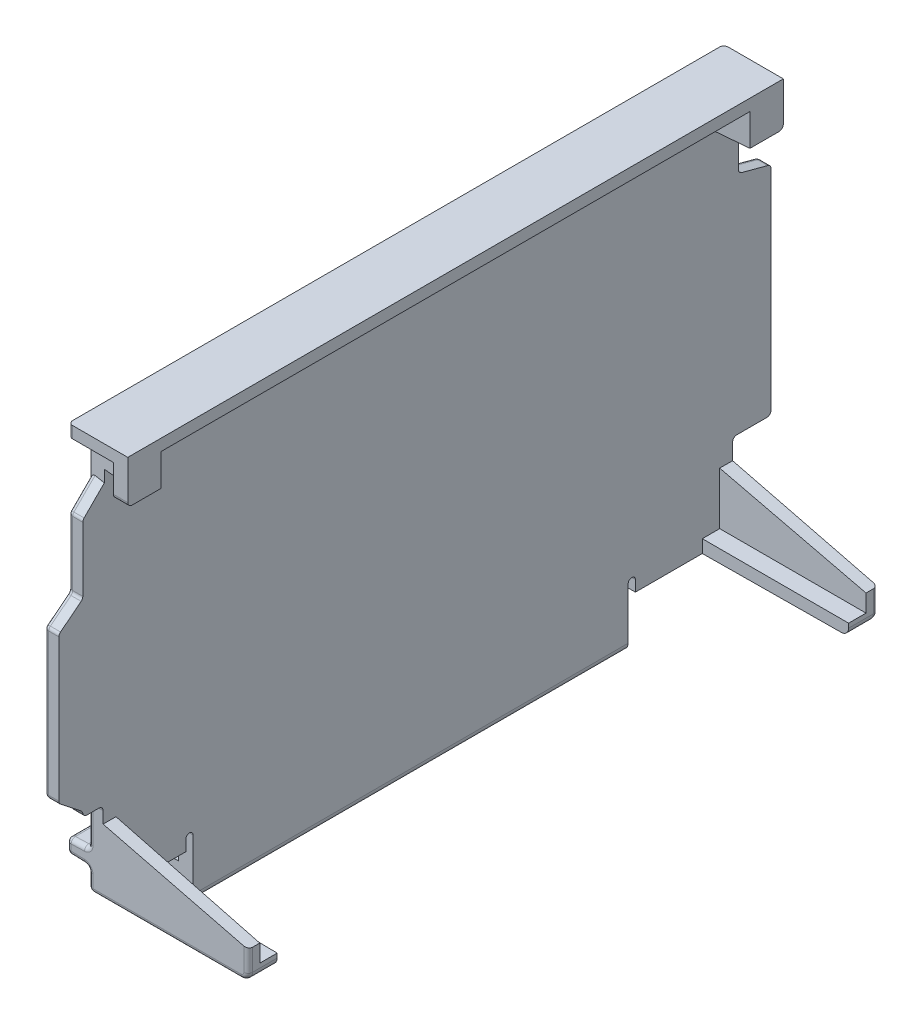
ISO-10303-21;
HEADER;
FILE_DESCRIPTION(('STEP AP214'),'2;1');
FILE_NAME('part.step','',(''),(''),'','','');
FILE_SCHEMA(('AUTOMOTIVE_DESIGN { 1 0 10303 214 1 1 1 1 }'));
ENDSEC;
DATA;
#1=APPLICATION_CONTEXT('core data for automotive mechanical design processes');
#2=APPLICATION_PROTOCOL_DEFINITION('international standard','automotive_design',2000,#1);
#3=PRODUCT_CONTEXT('',#1,'mechanical');
#4=PRODUCT('Part','Part','',(#3));
#5=PRODUCT_RELATED_PRODUCT_CATEGORY('part','',(#4));
#6=PRODUCT_DEFINITION_FORMATION('','',#4);
#7=PRODUCT_DEFINITION_CONTEXT('part definition',#1,'design');
#8=PRODUCT_DEFINITION('design','',#6,#7);
#9=PRODUCT_DEFINITION_SHAPE('','',#8);
#10=(LENGTH_UNIT() NAMED_UNIT(*) SI_UNIT(.MILLI.,.METRE.));
#11=(NAMED_UNIT(*) PLANE_ANGLE_UNIT() SI_UNIT($,.RADIAN.));
#12=(NAMED_UNIT(*) SI_UNIT($,.STERADIAN.) SOLID_ANGLE_UNIT());
#13=UNCERTAINTY_MEASURE_WITH_UNIT(LENGTH_MEASURE(1.E-05),#10,'distance_accuracy_value','');
#14=(GEOMETRIC_REPRESENTATION_CONTEXT(3) GLOBAL_UNCERTAINTY_ASSIGNED_CONTEXT((#13)) GLOBAL_UNIT_ASSIGNED_CONTEXT((#10,
#11,#12)) REPRESENTATION_CONTEXT('',''));
#15=CARTESIAN_POINT('',(0.,0.,0.));
#16=DIRECTION('',(0.,0.,1.));
#17=DIRECTION('',(1.,0.,0.));
#18=AXIS2_PLACEMENT_3D('',#15,#16,#17);
#19=CARTESIAN_POINT('',(-1.2,-92.78970663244,171.703649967));
#20=DIRECTION('',(0.,0.,-1.));
#21=DIRECTION('',(-1.,0.,0.));
#22=AXIS2_PLACEMENT_3D('',#19,#20,#21);
#23=CYLINDRICAL_SURFACE('',#22,0.3);
#24=DIRECTION('',(0.,0.,1.));
#25=VECTOR('',#24,1.);
#26=CARTESIAN_POINT('',(-1.5,-92.789706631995,0.));
#27=LINE('',#26,#25);
#28=CARTESIAN_POINT('',(-1.5,-92.7897066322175,104.346889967));
#29=VERTEX_POINT('',#28);
#30=CARTESIAN_POINT('',(-1.5,-92.7897066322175,61.54688996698));
#31=VERTEX_POINT('',#30);
#32=EDGE_CURVE('E757',#29,#31,#27,.F.);
#33=ORIENTED_EDGE('',*,*,#32,.F.);
#34=CARTESIAN_POINT('',(-1.2,-92.78970663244,104.346889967));
#35=DIRECTION('',(0.,0.,-1.));
#36=DIRECTION('',(-1.,0.,0.));
#37=AXIS2_PLACEMENT_3D('',#34,#35,#36);
#38=CIRCLE('',#37,0.3);
#39=CARTESIAN_POINT('',(-1.21046984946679,-92.4898893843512,104.346889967));
#40=VERTEX_POINT('',#39);
#41=EDGE_CURVE('E760',#29,#40,#38,.T.);
#42=ORIENTED_EDGE('',*,*,#41,.T.);
#43=DIRECTION('',(0.,0.,1.));
#44=VECTOR('',#43,1.);
#45=CARTESIAN_POINT('',(-1.21046984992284,-92.4898893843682,106.3656751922));
#46=LINE('',#45,#44);
#47=CARTESIAN_POINT('',(-1.2104698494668,-92.489889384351,61.54688996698));
#48=VERTEX_POINT('',#47);
#49=EDGE_CURVE('E741',#48,#40,#46,.T.);
#50=ORIENTED_EDGE('',*,*,#49,.F.);
#51=CARTESIAN_POINT('',(-1.2,-92.78970663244,61.54688996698));
#52=DIRECTION('',(0.,0.,-1.));
#53=DIRECTION('',(-1.,0.,0.));
#54=AXIS2_PLACEMENT_3D('',#51,#52,#53);
#55=CIRCLE('',#54,0.3);
#56=EDGE_CURVE('E762',#48,#31,#55,.F.);
#57=ORIENTED_EDGE('',*,*,#56,.T.);
#58=EDGE_LOOP('',(#33,#42,#50,#57));
#59=FACE_BOUND('',#58,.T.);
#60=ADVANCED_FACE('F17',(#59),#23,.T.);
#61=CARTESIAN_POINT('',(-1.5,0.,0.));
#62=DIRECTION('',(-1.,0.,0.));
#63=DIRECTION('',(0.,0.,1.));
#64=AXIS2_PLACEMENT_3D('',#61,#62,#63);
#65=PLANE('',#64);
#66=DIRECTION('',(0.,0.,1.));
#67=VECTOR('',#66,1.);
#68=CARTESIAN_POINT('',(-1.5,-93.210293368,-5.409870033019));
#69=LINE('',#68,#67);
#70=CARTESIAN_POINT('',(-1.49999999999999,-93.21029336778,104.346889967));
#71=VERTEX_POINT('',#70);
#72=CARTESIAN_POINT('',(-1.5,-93.21029336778,61.54688996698));
#73=VERTEX_POINT('',#72);
#74=EDGE_CURVE('E730',#71,#73,#69,.F.);
#75=ORIENTED_EDGE('',*,*,#74,.F.);
#76=DIRECTION('',(0.,1.,0.));
#77=VECTOR('',#76,1.);
#78=CARTESIAN_POINT('',(-1.5,0.,104.346889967));
#79=LINE('',#78,#77);
#80=EDGE_CURVE('E747',#71,#29,#79,.T.);
#81=ORIENTED_EDGE('',*,*,#80,.T.);
#82=ORIENTED_EDGE('',*,*,#32,.T.);
#83=DIRECTION('',(0.,1.,0.));
#84=VECTOR('',#83,1.);
#85=CARTESIAN_POINT('',(-1.5,0.,61.54688996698));
#86=LINE('',#85,#84);
#87=EDGE_CURVE('E754',#31,#73,#86,.F.);
#88=ORIENTED_EDGE('',*,*,#87,.T.);
#89=EDGE_LOOP('',(#75,#81,#82,#88));
#90=FACE_BOUND('',#89,.T.);
#91=ADVANCED_FACE('F2459',(#90),#65,.T.);
#92=CARTESIAN_POINT('',(-1.5,-92.5,106.3656751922));
#93=DIRECTION('',(-0.0348994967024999,0.999390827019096,0.));
#94=DIRECTION('',(-0.999390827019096,-0.0348994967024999,0.));
#95=AXIS2_PLACEMENT_3D('',#92,#93,#94);
#96=PLANE('',#95);
#97=ORIENTED_EDGE('',*,*,#49,.T.);
#98=DIRECTION('',(-0.999390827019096,-0.0348994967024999,0.));
#99=VECTOR('',#98,1.);
#100=CARTESIAN_POINT('',(-1.5,-92.5,104.346889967));
#101=LINE('',#100,#99);
#102=CARTESIAN_POINT('',(-0.289530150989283,-92.4577294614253,104.346889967));
#103=VERTEX_POINT('',#102);
#104=EDGE_CURVE('E739',#40,#103,#101,.F.);
#105=ORIENTED_EDGE('',*,*,#104,.T.);
#106=DIRECTION('',(0.,0.,-1.));
#107=VECTOR('',#106,1.);
#108=CARTESIAN_POINT('',(-0.289530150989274,-92.4577294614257,171.703649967));
#109=LINE('',#108,#107);
#110=CARTESIAN_POINT('',(-0.289530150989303,-92.4577294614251,61.54688996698));
#111=VERTEX_POINT('',#110);
#112=EDGE_CURVE('E722',#103,#111,#109,.T.);
#113=ORIENTED_EDGE('',*,*,#112,.T.);
#114=DIRECTION('',(-0.999390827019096,-0.0348994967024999,0.));
#115=VECTOR('',#114,1.);
#116=CARTESIAN_POINT('',(-1.5,-92.5,61.54688996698));
#117=LINE('',#116,#115);
#118=EDGE_CURVE('E744',#111,#48,#117,.T.);
#119=ORIENTED_EDGE('',*,*,#118,.T.);
#120=EDGE_LOOP('',(#97,#105,#113,#119));
#121=FACE_BOUND('',#120,.T.);
#122=ADVANCED_FACE('F2455',(#121),#96,.T.);
#123=CARTESIAN_POINT('',(-1.20000000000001,-93.21029336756,61.54688996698));
#124=DIRECTION('',(-0.71933980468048,-0.694658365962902,0.));
#125=DIRECTION('',(-0.694658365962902,0.71933980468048,0.));
#126=AXIS2_PLACEMENT_3D('',#123,#124,#125);
#127=SPHERICAL_SURFACE('',#126,0.3);
#128=CARTESIAN_POINT('',(-1.20000000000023,-93.2102933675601,61.54688996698));
#129=DIRECTION('',(0.999390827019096,-0.0348994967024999,0.));
#130=DIRECTION('',(0.0348994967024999,0.999390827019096,0.));
#131=AXIS2_PLACEMENT_3D('',#128,#129,#130);
#132=CIRCLE('',#131,0.299999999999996);
#133=CARTESIAN_POINT('',(-1.21046984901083,-93.5101106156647,61.54688996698));
#134=VERTEX_POINT('',#133);
#135=CARTESIAN_POINT('',(-1.20000000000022,-93.21029336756,61.24688996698));
#136=VERTEX_POINT('',#135);
#137=EDGE_CURVE('E1253',#134,#136,#132,.T.);
#138=ORIENTED_EDGE('',*,*,#137,.F.);
#139=CARTESIAN_POINT('',(-1.2,-93.21029336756,61.54688996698));
#140=DIRECTION('',(0.,0.,1.));
#141=DIRECTION('',(1.,0.,0.));
#142=AXIS2_PLACEMENT_3D('',#139,#140,#141);
#143=CIRCLE('',#142,0.3);
#144=EDGE_CURVE('E712',#73,#134,#143,.T.);
#145=ORIENTED_EDGE('',*,*,#144,.F.);
#146=CARTESIAN_POINT('',(-1.2,-93.21029336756,61.54688996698));
#147=DIRECTION('',(0.,-1.,0.));
#148=DIRECTION('',(0.,0.,-1.));
#149=AXIS2_PLACEMENT_3D('',#146,#147,#148);
#150=CIRCLE('',#149,0.300000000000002);
#151=EDGE_CURVE('E2005',#136,#73,#150,.F.);
#152=ORIENTED_EDGE('',*,*,#151,.F.);
#153=EDGE_LOOP('',(#138,#145,#152));
#154=FACE_BOUND('',#153,.T.);
#155=ADVANCED_FACE('F2458',(#154),#127,.T.);
#156=CARTESIAN_POINT('',(-1.2,-92.78970663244,61.54688996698));
#157=DIRECTION('',(-0.719339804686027,0.694658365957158,0.));
#158=DIRECTION('',(-0.694658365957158,-0.719339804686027,1.56765100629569E-13));
#159=AXIS2_PLACEMENT_3D('',#156,#157,#158);
#160=SPHERICAL_SURFACE('',#159,0.299999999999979);
#161=CARTESIAN_POINT('',(-1.20000000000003,-92.7897066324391,61.54688996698));
#162=DIRECTION('',(-0.999390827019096,-0.0348994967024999,0.));
#163=DIRECTION('',(0.0348994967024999,-0.999390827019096,0.));
#164=AXIS2_PLACEMENT_3D('',#161,#162,#163);
#165=CIRCLE('',#164,0.299999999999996);
#166=CARTESIAN_POINT('',(-1.20000000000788,-92.7897066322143,61.24688996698));
#167=VERTEX_POINT('',#166);
#168=EDGE_CURVE('E1244',#167,#48,#165,.F.);
#169=ORIENTED_EDGE('',*,*,#168,.F.);
#170=CARTESIAN_POINT('',(-1.2,-92.789706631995,61.54688996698));
#171=DIRECTION('',(0.,-1.,0.));
#172=DIRECTION('',(0.,0.,-1.));
#173=AXIS2_PLACEMENT_3D('',#170,#171,#172);
#174=CIRCLE('',#173,0.300000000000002);
#175=EDGE_CURVE('E2003',#31,#167,#174,.T.);
#176=ORIENTED_EDGE('',*,*,#175,.F.);
#177=ORIENTED_EDGE('',*,*,#56,.F.);
#178=EDGE_LOOP('',(#169,#176,#177));
#179=FACE_BOUND('',#178,.T.);
#180=ADVANCED_FACE('F2453',(#179),#160,.T.);
#181=CARTESIAN_POINT('',(-1.2,-93.21029336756,-5.409870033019));
#182=DIRECTION('',(0.,0.,1.));
#183=DIRECTION('',(1.,0.,0.));
#184=AXIS2_PLACEMENT_3D('',#181,#182,#183);
#185=CYLINDRICAL_SURFACE('',#184,0.3);
#186=CARTESIAN_POINT('',(-1.20000000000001,-93.21029336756,104.346889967));
#187=DIRECTION('',(-6.42511194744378E-10,6.65316049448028E-10,1.));
#188=DIRECTION('',(0.,-1.,6.65316049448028E-10));
#189=AXIS2_PLACEMENT_3D('',#186,#187,#188);
#190=CIRCLE('',#189,0.300000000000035);
#191=CARTESIAN_POINT('',(-1.41580194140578,-93.4186908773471,104.346889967));
#192=VERTEX_POINT('',#191);
#193=CARTESIAN_POINT('',(-1.21046984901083,-93.5101106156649,104.346889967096));
#194=VERTEX_POINT('',#193);
#195=EDGE_CURVE('E681',#192,#194,#190,.T.);
#196=ORIENTED_EDGE('',*,*,#195,.F.);
#197=CARTESIAN_POINT('',(-1.19999999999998,-93.21029336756,104.346889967));
#198=DIRECTION('',(0.,0.,1.));
#199=DIRECTION('',(1.,0.,0.));
#200=AXIS2_PLACEMENT_3D('',#197,#198,#199);
#201=CIRCLE('',#200,0.299999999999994);
#202=EDGE_CURVE('E708',#71,#192,#201,.T.);
#203=ORIENTED_EDGE('',*,*,#202,.F.);
#204=ORIENTED_EDGE('',*,*,#74,.T.);
#205=ORIENTED_EDGE('',*,*,#144,.T.);
#206=DIRECTION('',(0.,0.,1.));
#207=VECTOR('',#206,1.);
#208=CARTESIAN_POINT('',(-1.2104698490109,-93.5101106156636,59.52810474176));
#209=LINE('',#208,#207);
#210=EDGE_CURVE('E702',#194,#134,#209,.F.);
#211=ORIENTED_EDGE('',*,*,#210,.F.);
#212=EDGE_LOOP('',(#196,#203,#204,#205,#211));
#213=FACE_BOUND('',#212,.T.);
#214=ADVANCED_FACE('F2449',(#213),#185,.T.);
#215=CARTESIAN_POINT('',(-1.2,-92.78970663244,104.346889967));
#216=DIRECTION('',(-0.719339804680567,0.694658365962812,0.));
#217=DIRECTION('',(-0.694658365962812,-0.719339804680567,0.));
#218=AXIS2_PLACEMENT_3D('',#215,#216,#217);
#219=SPHERICAL_SURFACE('',#218,0.300000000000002);
#220=CARTESIAN_POINT('',(-1.20000000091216,-92.7897066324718,104.346889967));
#221=DIRECTION('',(0.999390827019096,0.0348994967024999,0.));
#222=DIRECTION('',(-0.0348994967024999,0.999390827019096,0.));
#223=AXIS2_PLACEMENT_3D('',#220,#221,#222);
#224=CIRCLE('',#223,0.299999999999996);
#225=CARTESIAN_POINT('',(-1.20000000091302,-92.78970663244,104.646889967));
#226=VERTEX_POINT('',#225);
#227=EDGE_CURVE('E1366',#40,#226,#224,.T.);
#228=ORIENTED_EDGE('',*,*,#227,.F.);
#229=ORIENTED_EDGE('',*,*,#41,.F.);
#230=CARTESIAN_POINT('',(-1.2,-92.78970663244,104.346889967));
#231=DIRECTION('',(0.,1.,0.));
#232=DIRECTION('',(0.,0.,1.));
#233=AXIS2_PLACEMENT_3D('',#230,#231,#232);
#234=CIRCLE('',#233,0.299999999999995);
#235=EDGE_CURVE('E1997',#226,#29,#234,.F.);
#236=ORIENTED_EDGE('',*,*,#235,.F.);
#237=EDGE_LOOP('',(#228,#229,#236));
#238=FACE_BOUND('',#237,.T.);
#239=ADVANCED_FACE('F2452',(#238),#219,.T.);
#240=CARTESIAN_POINT('',(-1.20000000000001,-93.21029336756,104.346889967));
#241=DIRECTION('',(-0.719339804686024,-0.694658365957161,0.));
#242=DIRECTION('',(0.694658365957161,-0.719339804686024,6.97604697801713E-12));
#243=AXIS2_PLACEMENT_3D('',#240,#241,#242);
#244=SPHERICAL_SURFACE('',#243,0.3);
#245=CARTESIAN_POINT('',(-1.20000000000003,-93.2102933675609,104.346889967));
#246=DIRECTION('',(-0.999390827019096,0.0348994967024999,0.));
#247=DIRECTION('',(-0.0348994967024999,-0.999390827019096,0.));
#248=AXIS2_PLACEMENT_3D('',#245,#246,#247);
#249=CIRCLE('',#248,0.299999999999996);
#250=CARTESIAN_POINT('',(-1.20000000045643,-93.2102933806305,104.646889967));
#251=VERTEX_POINT('',#250);
#252=EDGE_CURVE('E1992',#251,#194,#249,.F.);
#253=ORIENTED_EDGE('',*,*,#252,.F.);
#254=CARTESIAN_POINT('',(-1.2,-93.210293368,104.346889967));
#255=DIRECTION('',(0.,1.,0.));
#256=DIRECTION('',(0.,0.,1.));
#257=AXIS2_PLACEMENT_3D('',#254,#255,#256);
#258=CIRCLE('',#257,0.299999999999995);
#259=EDGE_CURVE('E1995',#71,#251,#258,.T.);
#260=ORIENTED_EDGE('',*,*,#259,.F.);
#261=ORIENTED_EDGE('',*,*,#202,.T.);
#262=ORIENTED_EDGE('',*,*,#195,.T.);
#263=EDGE_LOOP('',(#253,#260,#261,#262));
#264=FACE_BOUND('',#263,.T.);
#265=ADVANCED_FACE('F2448',(#264),#244,.T.);
#266=CARTESIAN_POINT('',(1.,-67.15,106.893779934));
#267=DIRECTION('',(0.,1.,0.));
#268=DIRECTION('',(0.,0.,1.));
#269=AXIS2_PLACEMENT_3D('',#266,#267,#268);
#270=PLANE('',#269);
#271=DIRECTION('',(0.,0.,1.));
#272=VECTOR('',#271,1.);
#273=CARTESIAN_POINT('',(3.1,-67.15,104.746889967));
#274=LINE('',#273,#272);
#275=CARTESIAN_POINT('',(3.1,-67.15,106.046889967));
#276=VERTEX_POINT('',#275);
#277=CARTESIAN_POINT('',(3.1,-67.15,104.746889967));
#278=VERTEX_POINT('',#277);
#279=EDGE_CURVE('E663',#276,#278,#274,.F.);
#280=ORIENTED_EDGE('',*,*,#279,.F.);
#281=DIRECTION('',(1.,0.,0.));
#282=VECTOR('',#281,1.);
#283=CARTESIAN_POINT('',(3.1,-67.15,106.046889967));
#284=LINE('',#283,#282);
#285=CARTESIAN_POINT('',(0.3,-67.15,106.046889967));
#286=VERTEX_POINT('',#285);
#287=EDGE_CURVE('E674',#286,#276,#284,.T.);
#288=ORIENTED_EDGE('',*,*,#287,.F.);
#289=CARTESIAN_POINT('',(0.3,-67.15,105.746889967));
#290=DIRECTION('',(0.,-1.,0.));
#291=DIRECTION('',(0.,0.,-1.));
#292=AXIS2_PLACEMENT_3D('',#289,#290,#291);
#293=CIRCLE('',#292,0.299999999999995);
#294=CARTESIAN_POINT('',(4.39643980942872E-13,-67.15,105.746889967));
#295=VERTEX_POINT('',#294);
#296=EDGE_CURVE('E725',#295,#286,#293,.F.);
#297=ORIENTED_EDGE('',*,*,#296,.F.);
#298=DIRECTION('',(0.,0.,1.));
#299=VECTOR('',#298,1.);
#300=CARTESIAN_POINT('',(8.79287961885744E-13,-67.15,106.893779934));
#301=LINE('',#300,#299);
#302=CARTESIAN_POINT('',(7.32378567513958E-13,-67.15,104.475675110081));
#303=VERTEX_POINT('',#302);
#304=EDGE_CURVE('E646',#303,#295,#301,.T.);
#305=ORIENTED_EDGE('',*,*,#304,.F.);
#306=DIRECTION('',(0.996194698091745,0.,0.0871557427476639));
#307=VECTOR('',#306,1.);
#308=CARTESIAN_POINT('',(3.1,-67.15,104.746889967));
#309=LINE('',#308,#307);
#310=EDGE_CURVE('E685',#278,#303,#309,.F.);
#311=ORIENTED_EDGE('',*,*,#310,.F.);
#312=EDGE_LOOP('',(#280,#288,#297,#305,#311));
#313=FACE_BOUND('',#312,.T.);
#314=ADVANCED_FACE('F2021',(#313),#270,.F.);
#315=CARTESIAN_POINT('',(3.1,-66.35,104.746889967));
#316=DIRECTION('',(-1.,0.,0.));
#317=DIRECTION('',(0.,0.,1.));
#318=AXIS2_PLACEMENT_3D('',#315,#316,#317);
#319=PLANE('',#318);
#320=ORIENTED_EDGE('',*,*,#279,.T.);
#321=DIRECTION('',(0.,1.,0.));
#322=VECTOR('',#321,1.);
#323=CARTESIAN_POINT('',(3.1,-71.06878522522,104.746889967));
#324=LINE('',#323,#322);
#325=CARTESIAN_POINT('',(3.1,-69.35,104.746889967));
#326=VERTEX_POINT('',#325);
#327=EDGE_CURVE('E642',#326,#278,#324,.T.);
#328=ORIENTED_EDGE('',*,*,#327,.F.);
#329=DIRECTION('',(0.,0.,1.));
#330=VECTOR('',#329,1.);
#331=CARTESIAN_POINT('',(3.1,-69.35,104.746889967));
#332=LINE('',#331,#330);
#333=CARTESIAN_POINT('',(3.1,-69.35,105.746889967));
#334=VERTEX_POINT('',#333);
#335=EDGE_CURVE('E635',#326,#334,#332,.T.);
#336=ORIENTED_EDGE('',*,*,#335,.T.);
#337=CARTESIAN_POINT('',(3.1,-69.05,105.746889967));
#338=DIRECTION('',(-1.,0.,0.));
#339=DIRECTION('',(0.,0.,1.));
#340=AXIS2_PLACEMENT_3D('',#337,#338,#339);
#341=CIRCLE('',#340,0.299999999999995);
#342=CARTESIAN_POINT('',(3.1,-69.05,106.046889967));
#343=VERTEX_POINT('',#342);
#344=EDGE_CURVE('E21',#334,#343,#341,.T.);
#345=ORIENTED_EDGE('',*,*,#344,.T.);
#346=DIRECTION('',(0.,1.,0.));
#347=VECTOR('',#346,1.);
#348=CARTESIAN_POINT('',(3.1,-66.35,106.046889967));
#349=LINE('',#348,#347);
#350=EDGE_CURVE('E676',#276,#343,#349,.F.);
#351=ORIENTED_EDGE('',*,*,#350,.F.);
#352=EDGE_LOOP('',(#320,#328,#336,#345,#351));
#353=FACE_BOUND('',#352,.T.);
#354=ADVANCED_FACE('F637',(#353),#319,.T.);
#355=CARTESIAN_POINT('',(1.,-67.15,106.893779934));
#356=DIRECTION('',(0.,1.,0.));
#357=DIRECTION('',(0.,0.,1.));
#358=AXIS2_PLACEMENT_3D('',#355,#356,#357);
#359=PLANE('',#358);
#360=DIRECTION('',(0.996194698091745,0.,-0.0871557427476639));
#361=VECTOR('',#360,1.);
#362=CARTESIAN_POINT('',(3.1,-67.15,62.14688996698));
#363=LINE('',#362,#361);
#364=CARTESIAN_POINT('',(3.1,-67.15,62.14688996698));
#365=VERTEX_POINT('',#364);
#366=CARTESIAN_POINT('',(0.,-67.15,62.4181048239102));
#367=VERTEX_POINT('',#366);
#368=EDGE_CURVE('E1254',#365,#367,#363,.F.);
#369=ORIENTED_EDGE('',*,*,#368,.T.);
#370=DIRECTION('',(0.,0.,1.));
#371=VECTOR('',#370,1.);
#372=CARTESIAN_POINT('',(0.,-67.15,106.893779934));
#373=LINE('',#372,#371);
#374=CARTESIAN_POINT('',(0.,-67.15,61.14688996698));
#375=VERTEX_POINT('',#374);
#376=EDGE_CURVE('E664',#375,#367,#373,.T.);
#377=ORIENTED_EDGE('',*,*,#376,.F.);
#378=CARTESIAN_POINT('',(0.3,-67.15,61.14688996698));
#379=DIRECTION('',(0.,-1.,0.));
#380=DIRECTION('',(0.,0.,-1.));
#381=AXIS2_PLACEMENT_3D('',#378,#379,#380);
#382=CIRCLE('',#381,0.300000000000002);
#383=CARTESIAN_POINT('',(0.3,-67.15,60.84688996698));
#384=VERTEX_POINT('',#383);
#385=EDGE_CURVE('E736',#384,#375,#382,.F.);
#386=ORIENTED_EDGE('',*,*,#385,.F.);
#387=DIRECTION('',(1.,0.,0.));
#388=VECTOR('',#387,1.);
#389=CARTESIAN_POINT('',(3.1,-67.15,60.84688996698));
#390=LINE('',#389,#388);
#391=CARTESIAN_POINT('',(3.1,-67.15,60.84688996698));
#392=VERTEX_POINT('',#391);
#393=EDGE_CURVE('E1317',#384,#392,#390,.T.);
#394=ORIENTED_EDGE('',*,*,#393,.T.);
#395=DIRECTION('',(0.,0.,-1.));
#396=VECTOR('',#395,1.);
#397=CARTESIAN_POINT('',(3.1,-67.15,62.14688996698));
#398=LINE('',#397,#396);
#399=EDGE_CURVE('E726',#392,#365,#398,.F.);
#400=ORIENTED_EDGE('',*,*,#399,.T.);
#401=EDGE_LOOP('',(#369,#377,#386,#394,#400));
#402=FACE_BOUND('',#401,.T.);
#403=ADVANCED_FACE('F2359',(#402),#359,.F.);
#404=CARTESIAN_POINT('',(3.1,-66.35,62.14688996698));
#405=DIRECTION('',(1.,0.,0.));
#406=DIRECTION('',(0.,0.,-1.));
#407=AXIS2_PLACEMENT_3D('',#404,#405,#406);
#408=PLANE('',#407);
#409=ORIENTED_EDGE('',*,*,#399,.F.);
#410=DIRECTION('',(0.,1.,0.));
#411=VECTOR('',#410,1.);
#412=CARTESIAN_POINT('',(3.1,-66.35,60.84688996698));
#413=LINE('',#412,#411);
#414=CARTESIAN_POINT('',(3.1,-69.05,60.84688996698));
#415=VERTEX_POINT('',#414);
#416=EDGE_CURVE('E1314',#392,#415,#413,.F.);
#417=ORIENTED_EDGE('',*,*,#416,.T.);
#418=CARTESIAN_POINT('',(3.1,-69.05,61.14688996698));
#419=DIRECTION('',(1.,0.,0.));
#420=DIRECTION('',(0.,0.,-1.));
#421=AXIS2_PLACEMENT_3D('',#418,#419,#420);
#422=CIRCLE('',#421,0.300000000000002);
#423=CARTESIAN_POINT('',(3.1,-69.35,61.14688996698));
#424=VERTEX_POINT('',#423);
#425=EDGE_CURVE('E1258',#424,#415,#422,.T.);
#426=ORIENTED_EDGE('',*,*,#425,.F.);
#427=DIRECTION('',(0.,0.,-1.));
#428=VECTOR('',#427,1.);
#429=CARTESIAN_POINT('',(3.1,-69.35,62.14688996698));
#430=LINE('',#429,#428);
#431=CARTESIAN_POINT('',(3.1,-69.35,62.14688996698));
#432=VERTEX_POINT('',#431);
#433=EDGE_CURVE('E667',#432,#424,#430,.T.);
#434=ORIENTED_EDGE('',*,*,#433,.F.);
#435=DIRECTION('',(0.,1.,0.));
#436=VECTOR('',#435,1.);
#437=CARTESIAN_POINT('',(3.1,-71.06878522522,62.14688996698));
#438=LINE('',#437,#436);
#439=EDGE_CURVE('E1288',#432,#365,#438,.T.);
#440=ORIENTED_EDGE('',*,*,#439,.T.);
#441=EDGE_LOOP('',(#409,#417,#426,#434,#440));
#442=FACE_BOUND('',#441,.T.);
#443=ADVANCED_FACE('F2365',(#442),#408,.F.);
#444=CARTESIAN_POINT('',(-0.3,-92.15791221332,171.703649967));
#445=DIRECTION('',(0.,0.,-1.));
#446=DIRECTION('',(-1.,0.,0.));
#447=AXIS2_PLACEMENT_3D('',#444,#445,#446);
#448=CYLINDRICAL_SURFACE('',#447,0.3);
#449=DIRECTION('',(0.,0.,1.));
#450=VECTOR('',#449,1.);
#451=CARTESIAN_POINT('',(0.,-92.157912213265,106.893779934));
#452=LINE('',#451,#450);
#453=CARTESIAN_POINT('',(0.,-92.1579122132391,61.5468899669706));
#454=VERTEX_POINT('',#453);
#455=CARTESIAN_POINT('',(0.,-92.15791221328,104.346889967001));
#456=VERTEX_POINT('',#455);
#457=EDGE_CURVE('E1275',#454,#456,#452,.T.);
#458=ORIENTED_EDGE('',*,*,#457,.F.);
#459=CARTESIAN_POINT('',(-0.299999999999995,-92.15791221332,61.54688996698));
#460=DIRECTION('',(0.,0.,1.));
#461=DIRECTION('',(1.,0.,0.));
#462=AXIS2_PLACEMENT_3D('',#459,#460,#461);
#463=CIRCLE('',#462,0.299999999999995);
#464=EDGE_CURVE('E733',#111,#454,#463,.T.);
#465=ORIENTED_EDGE('',*,*,#464,.F.);
#466=ORIENTED_EDGE('',*,*,#112,.F.);
#467=CARTESIAN_POINT('',(-0.300000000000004,-92.15791221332,104.346889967));
#468=DIRECTION('',(0.,0.,-1.));
#469=DIRECTION('',(-1.,0.,0.));
#470=AXIS2_PLACEMENT_3D('',#467,#468,#469);
#471=CIRCLE('',#470,0.299999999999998);
#472=EDGE_CURVE('E715',#456,#103,#471,.T.);
#473=ORIENTED_EDGE('',*,*,#472,.F.);
#474=EDGE_LOOP('',(#458,#465,#466,#473));
#475=FACE_BOUND('',#474,.T.);
#476=ADVANCED_FACE('F2436',(#475),#448,.F.);
#477=CARTESIAN_POINT('',(0.3,-24.69998,105.746889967));
#478=DIRECTION('',(0.,-1.,0.));
#479=DIRECTION('',(0.,0.,-1.));
#480=AXIS2_PLACEMENT_3D('',#477,#478,#479);
#481=CYLINDRICAL_SURFACE('',#480,0.299999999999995);
#482=DIRECTION('',(0.,1.,0.));
#483=VECTOR('',#482,1.);
#484=CARTESIAN_POINT('',(0.3,-66.35,106.046889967));
#485=LINE('',#484,#483);
#486=CARTESIAN_POINT('',(0.3,-66.35,106.046889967));
#487=VERTEX_POINT('',#486);
#488=EDGE_CURVE('E677',#487,#286,#485,.F.);
#489=ORIENTED_EDGE('',*,*,#488,.F.);
#490=CARTESIAN_POINT('',(0.3,-66.35,105.746889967));
#491=DIRECTION('',(0.,-1.,0.));
#492=DIRECTION('',(0.,0.,-1.));
#493=AXIS2_PLACEMENT_3D('',#490,#491,#492);
#494=CIRCLE('',#493,0.299999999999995);
#495=CARTESIAN_POINT('',(0.,-66.35,105.746889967));
#496=VERTEX_POINT('',#495);
#497=EDGE_CURVE('E1316',#496,#487,#494,.F.);
#498=ORIENTED_EDGE('',*,*,#497,.F.);
#499=DIRECTION('',(0.,1.,0.));
#500=VECTOR('',#499,1.);
#501=CARTESIAN_POINT('',(0.,0.,105.746889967));
#502=LINE('',#501,#500);
#503=EDGE_CURVE('E1261',#295,#496,#502,.T.);
#504=ORIENTED_EDGE('',*,*,#503,.F.);
#505=ORIENTED_EDGE('',*,*,#296,.T.);
#506=EDGE_LOOP('',(#489,#498,#504,#505));
#507=FACE_BOUND('',#506,.T.);
#508=ADVANCED_FACE('F2014',(#507),#481,.T.);
#509=CARTESIAN_POINT('',(0.3,-24.69998,61.14688996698));
#510=DIRECTION('',(0.,-1.,0.));
#511=DIRECTION('',(0.,0.,-1.));
#512=AXIS2_PLACEMENT_3D('',#509,#510,#511);
#513=CYLINDRICAL_SURFACE('',#512,0.300000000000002);
#514=DIRECTION('',(0.,1.,0.));
#515=VECTOR('',#514,1.);
#516=CARTESIAN_POINT('',(0.,0.,61.14688996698));
#517=LINE('',#516,#515);
#518=CARTESIAN_POINT('',(0.,-66.35,61.14688996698));
#519=VERTEX_POINT('',#518);
#520=EDGE_CURVE('E1267',#519,#375,#517,.F.);
#521=ORIENTED_EDGE('',*,*,#520,.F.);
#522=CARTESIAN_POINT('',(0.3,-66.35,61.14688996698));
#523=DIRECTION('',(0.,-1.,0.));
#524=DIRECTION('',(0.,0.,-1.));
#525=AXIS2_PLACEMENT_3D('',#522,#523,#524);
#526=CIRCLE('',#525,0.300000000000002);
#527=CARTESIAN_POINT('',(0.3,-66.35,60.84688996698));
#528=VERTEX_POINT('',#527);
#529=EDGE_CURVE('E1549',#528,#519,#526,.F.);
#530=ORIENTED_EDGE('',*,*,#529,.F.);
#531=DIRECTION('',(0.,1.,0.));
#532=VECTOR('',#531,1.);
#533=CARTESIAN_POINT('',(0.3,-66.35,60.84688996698));
#534=LINE('',#533,#532);
#535=EDGE_CURVE('E1320',#528,#384,#534,.F.);
#536=ORIENTED_EDGE('',*,*,#535,.T.);
#537=ORIENTED_EDGE('',*,*,#385,.T.);
#538=EDGE_LOOP('',(#521,#530,#536,#537));
#539=FACE_BOUND('',#538,.T.);
#540=ADVANCED_FACE('F2356',(#539),#513,.T.);
#541=CARTESIAN_POINT('',(-0.299999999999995,-92.15791221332,61.5468899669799));
#542=DIRECTION('',(0.,0.,-1.));
#543=DIRECTION('',(-1.,0.,0.));
#544=AXIS2_PLACEMENT_3D('',#541,#542,#543);
#545=TOROIDAL_SURFACE('',#544,0.599999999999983,0.299999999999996);
#546=CARTESIAN_POINT('',(-0.29999999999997,-92.15791221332,61.2468899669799));
#547=DIRECTION('',(0.,0.,-1.));
#548=DIRECTION('',(-1.,0.,0.));
#549=AXIS2_PLACEMENT_3D('',#546,#547,#548);
#550=CIRCLE('',#549,0.59999999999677);
#551=CARTESIAN_POINT('',(-0.279060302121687,-92.7575467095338,61.24688996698));
#552=VERTEX_POINT('',#551);
#553=CARTESIAN_POINT('',(0.2999999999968,-92.157912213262,61.24688996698));
#554=VERTEX_POINT('',#553);
#555=EDGE_CURVE('E1451',#552,#554,#550,.F.);
#556=ORIENTED_EDGE('',*,*,#555,.F.);
#557=CARTESIAN_POINT('',(-0.279060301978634,-92.7575467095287,61.54688996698));
#558=DIRECTION('',(-0.999390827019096,-0.0348994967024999,0.));
#559=DIRECTION('',(0.0348994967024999,-0.999390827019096,0.));
#560=AXIS2_PLACEMENT_3D('',#557,#558,#559);
#561=CIRCLE('',#560,0.299999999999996);
#562=EDGE_CURVE('E1236',#111,#552,#561,.T.);
#563=ORIENTED_EDGE('',*,*,#562,.F.);
#564=ORIENTED_EDGE('',*,*,#464,.T.);
#565=CARTESIAN_POINT('',(0.3,-92.157912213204,61.54688996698));
#566=DIRECTION('',(0.,-1.,0.));
#567=DIRECTION('',(0.,0.,-1.));
#568=AXIS2_PLACEMENT_3D('',#565,#566,#567);
#569=CIRCLE('',#568,0.300000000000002);
#570=EDGE_CURVE('E735',#554,#454,#569,.F.);
#571=ORIENTED_EDGE('',*,*,#570,.F.);
#572=EDGE_LOOP('',(#556,#563,#564,#571));
#573=FACE_BOUND('',#572,.T.);
#574=ADVANCED_FACE('F2430',(#573),#545,.T.);
#575=CARTESIAN_POINT('',(0.3,-89.30789854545,61.54688996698));
#576=DIRECTION('',(0.,-1.,0.));
#577=DIRECTION('',(0.,0.,-1.));
#578=AXIS2_PLACEMENT_3D('',#575,#576,#577);
#579=CYLINDRICAL_SURFACE('',#578,0.300000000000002);
#580=CARTESIAN_POINT('',(0.3,-89.3999999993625,61.54688996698));
#581=DIRECTION('',(0.,-1.,0.));
#582=DIRECTION('',(0.,0.,-1.));
#583=AXIS2_PLACEMENT_3D('',#580,#581,#582);
#584=CIRCLE('',#583,0.300000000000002);
#585=CARTESIAN_POINT('',(0.,-89.3999999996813,61.546889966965));
#586=VERTEX_POINT('',#585);
#587=CARTESIAN_POINT('',(0.299999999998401,-89.3999999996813,61.24688996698));
#588=VERTEX_POINT('',#587);
#589=EDGE_CURVE('E1249',#586,#588,#584,.T.);
#590=ORIENTED_EDGE('',*,*,#589,.T.);
#591=DIRECTION('',(0.,1.,0.));
#592=VECTOR('',#591,1.);
#593=CARTESIAN_POINT('',(0.2999999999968,-89.5,61.24688996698));
#594=LINE('',#593,#592);
#595=EDGE_CURVE('E1447',#554,#588,#594,.T.);
#596=ORIENTED_EDGE('',*,*,#595,.F.);
#597=ORIENTED_EDGE('',*,*,#570,.T.);
#598=DIRECTION('',(0.,1.,0.));
#599=VECTOR('',#598,1.);
#600=CARTESIAN_POINT('',(0.,0.,61.546889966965));
#601=LINE('',#600,#599);
#602=EDGE_CURVE('E1279',#586,#454,#601,.F.);
#603=ORIENTED_EDGE('',*,*,#602,.F.);
#604=EDGE_LOOP('',(#590,#596,#597,#603));
#605=FACE_BOUND('',#604,.T.);
#606=ADVANCED_FACE('F2426',(#605),#579,.T.);
#607=CARTESIAN_POINT('',(-1.293668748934,-93.20702238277,61.54688996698));
#608=DIRECTION('',(0.999390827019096,-0.0348994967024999,0.));
#609=DIRECTION('',(0.0348994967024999,0.999390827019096,0.));
#610=AXIS2_PLACEMENT_3D('',#607,#608,#609);
#611=CYLINDRICAL_SURFACE('',#610,0.299999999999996);
#612=ORIENTED_EDGE('',*,*,#137,.T.);
#613=DIRECTION('',(-0.999390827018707,0.0348994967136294,0.));
#614=VECTOR('',#613,1.);
#615=CARTESIAN_POINT('',(-0.279060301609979,-93.2424532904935,61.24688996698));
#616=LINE('',#615,#614);
#617=CARTESIAN_POINT('',(-0.279060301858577,-93.2424532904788,61.24688996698));
#618=VERTEX_POINT('',#617);
#619=EDGE_CURVE('E1432',#618,#136,#616,.T.);
#620=ORIENTED_EDGE('',*,*,#619,.F.);
#621=CARTESIAN_POINT('',(-0.279060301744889,-93.2424532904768,61.54688996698));
#622=DIRECTION('',(0.9993908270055,-0.034899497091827,0.));
#623=DIRECTION('',(0.034899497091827,0.9993908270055,0.));
#624=AXIS2_PLACEMENT_3D('',#621,#622,#623);
#625=CIRCLE('',#624,0.300000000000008);
#626=CARTESIAN_POINT('',(-0.28953015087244,-93.5422705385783,61.54688996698));
#627=VERTEX_POINT('',#626);
#628=EDGE_CURVE('E706',#627,#618,#625,.T.);
#629=ORIENTED_EDGE('',*,*,#628,.F.);
#630=DIRECTION('',(0.999390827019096,-0.0348994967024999,0.));
#631=VECTOR('',#630,1.);
#632=CARTESIAN_POINT('',(-1.5,-93.5,61.54688996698));
#633=LINE('',#632,#631);
#634=EDGE_CURVE('E705',#134,#627,#633,.T.);
#635=ORIENTED_EDGE('',*,*,#634,.F.);
#636=EDGE_LOOP('',(#612,#620,#629,#635));
#637=FACE_BOUND('',#636,.T.);
#638=ADVANCED_FACE('F2422',(#637),#611,.T.);
#639=CARTESIAN_POINT('',(-1.2,-92.69316326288,61.54688996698));
#640=DIRECTION('',(0.,-1.,0.));
#641=DIRECTION('',(0.,0.,-1.));
#642=AXIS2_PLACEMENT_3D('',#639,#640,#641);
#643=CYLINDRICAL_SURFACE('',#642,0.300000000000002);
#644=ORIENTED_EDGE('',*,*,#175,.T.);
#645=DIRECTION('',(0.,1.,0.));
#646=VECTOR('',#645,1.);
#647=CARTESIAN_POINT('',(-1.20000000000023,-89.5,61.24688996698));
#648=LINE('',#647,#646);
#649=EDGE_CURVE('E1426',#136,#167,#648,.T.);
#650=ORIENTED_EDGE('',*,*,#649,.F.);
#651=ORIENTED_EDGE('',*,*,#151,.T.);
#652=ORIENTED_EDGE('',*,*,#87,.F.);
#653=EDGE_LOOP('',(#644,#650,#651,#652));
#654=FACE_BOUND('',#653,.T.);
#655=ADVANCED_FACE('F2418',(#654),#643,.T.);
#656=CARTESIAN_POINT('',(-0.1887892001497,-92.75439437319,61.54688996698));
#657=DIRECTION('',(-0.999390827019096,-0.0348994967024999,0.));
#658=DIRECTION('',(0.0348994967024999,-0.999390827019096,0.));
#659=AXIS2_PLACEMENT_3D('',#656,#657,#658);
#660=CYLINDRICAL_SURFACE('',#659,0.299999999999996);
#661=ORIENTED_EDGE('',*,*,#562,.T.);
#662=DIRECTION('',(0.999390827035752,0.0348994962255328,0.));
#663=VECTOR('',#662,1.);
#664=CARTESIAN_POINT('',(-1.20000000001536,-92.789706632,61.24688996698));
#665=LINE('',#664,#663);
#666=EDGE_CURVE('E1422',#167,#552,#665,.T.);
#667=ORIENTED_EDGE('',*,*,#666,.F.);
#668=ORIENTED_EDGE('',*,*,#168,.T.);
#669=ORIENTED_EDGE('',*,*,#118,.F.);
#670=EDGE_LOOP('',(#661,#667,#668,#669));
#671=FACE_BOUND('',#670,.T.);
#672=ADVANCED_FACE('F2414',(#671),#660,.T.);
#673=CARTESIAN_POINT('',(-1.5,-96.3,68.44688996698));
#674=DIRECTION('',(-1.,0.,0.));
#675=DIRECTION('',(0.,0.,1.));
#676=AXIS2_PLACEMENT_3D('',#673,#674,#675);
#677=PLANE('',#676);
#678=DIRECTION('',(0.,1.,0.));
#679=VECTOR('',#678,1.);
#680=CARTESIAN_POINT('',(-1.5,-96.3,98.44688996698));
#681=LINE('',#680,#679);
#682=CARTESIAN_POINT('',(-1.5,-96.57436564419,98.44688996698));
#683=VERTEX_POINT('',#682);
#684=CARTESIAN_POINT('',(-1.5,-96.3,98.44688996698));
#685=VERTEX_POINT('',#684);
#686=EDGE_CURVE('E1397',#683,#685,#681,.T.);
#687=ORIENTED_EDGE('',*,*,#686,.T.);
#688=DIRECTION('',(0.,0.,1.));
#689=VECTOR('',#688,1.);
#690=CARTESIAN_POINT('',(-1.5,-96.3,68.44688996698));
#691=LINE('',#690,#689);
#692=CARTESIAN_POINT('',(-1.5,-96.3,68.44688996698));
#693=VERTEX_POINT('',#692);
#694=EDGE_CURVE('E1179',#693,#685,#691,.T.);
#695=ORIENTED_EDGE('',*,*,#694,.F.);
#696=DIRECTION('',(0.,1.,0.));
#697=VECTOR('',#696,1.);
#698=CARTESIAN_POINT('',(-1.5,-96.3,68.44688996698));
#699=LINE('',#698,#697);
#700=CARTESIAN_POINT('',(-1.5,-96.57436564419,68.44688996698));
#701=VERTEX_POINT('',#700);
#702=EDGE_CURVE('E1243',#693,#701,#699,.F.);
#703=ORIENTED_EDGE('',*,*,#702,.T.);
#704=DIRECTION('',(0.,0.,-1.));
#705=VECTOR('',#704,1.);
#706=CARTESIAN_POINT('',(-1.5,-96.57436564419,171.703649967));
#707=LINE('',#706,#705);
#708=EDGE_CURVE('E1409',#683,#701,#707,.T.);
#709=ORIENTED_EDGE('',*,*,#708,.F.);
#710=EDGE_LOOP('',(#687,#695,#703,#709));
#711=FACE_BOUND('',#710,.T.);
#712=ADVANCED_FACE('F2411',(#711),#677,.T.);
#713=CARTESIAN_POINT('',(-0.300000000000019,-93.84208778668,61.54688996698));
#714=DIRECTION('',(0.,0.,1.));
#715=DIRECTION('',(1.,0.,0.));
#716=AXIS2_PLACEMENT_3D('',#713,#714,#715);
#717=TOROIDAL_SURFACE('',#716,0.599999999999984,0.299999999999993);
#718=ORIENTED_EDGE('',*,*,#628,.T.);
#719=CARTESIAN_POINT('',(-0.300000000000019,-93.84208778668,61.24688996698));
#720=DIRECTION('',(0.,0.,1.));
#721=DIRECTION('',(1.,0.,0.));
#722=AXIS2_PLACEMENT_3D('',#719,#720,#721);
#723=CIRCLE('',#722,0.599999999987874);
#724=CARTESIAN_POINT('',(0.3,-93.842087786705,61.24688996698));
#725=VERTEX_POINT('',#724);
#726=EDGE_CURVE('E1441',#725,#618,#723,.T.);
#727=ORIENTED_EDGE('',*,*,#726,.F.);
#728=CARTESIAN_POINT('',(0.3,-93.8420877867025,61.54688996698));
#729=DIRECTION('',(0.,-1.,0.));
#730=DIRECTION('',(0.,0.,-1.));
#731=AXIS2_PLACEMENT_3D('',#728,#729,#730);
#732=CIRCLE('',#731,0.300000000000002);
#733=CARTESIAN_POINT('',(0.,-93.8420877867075,61.54688996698));
#734=VERTEX_POINT('',#733);
#735=EDGE_CURVE('E1186',#734,#725,#732,.T.);
#736=ORIENTED_EDGE('',*,*,#735,.F.);
#737=CARTESIAN_POINT('',(-0.3,-93.84208778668,61.54688996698));
#738=DIRECTION('',(0.,0.,1.));
#739=DIRECTION('',(1.,0.,0.));
#740=AXIS2_PLACEMENT_3D('',#737,#738,#739);
#741=CIRCLE('',#740,0.3);
#742=EDGE_CURVE('E1164',#734,#627,#741,.T.);
#743=ORIENTED_EDGE('',*,*,#742,.T.);
#744=EDGE_LOOP('',(#718,#727,#736,#743));
#745=FACE_BOUND('',#744,.T.);
#746=ADVANCED_FACE('F2409',(#745),#717,.T.);
#747=CARTESIAN_POINT('',(-1.5,-93.5,59.52810474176));
#748=DIRECTION('',(-0.0348994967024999,-0.999390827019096,0.));
#749=DIRECTION('',(0.999390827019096,-0.0348994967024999,0.));
#750=AXIS2_PLACEMENT_3D('',#747,#748,#749);
#751=PLANE('',#750);
#752=DIRECTION('',(0.,0.,1.));
#753=VECTOR('',#752,1.);
#754=CARTESIAN_POINT('',(-0.289530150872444,-93.5422705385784,-5.409870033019));
#755=LINE('',#754,#753);
#756=CARTESIAN_POINT('',(-0.289530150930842,-93.5422705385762,104.346889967));
#757=VERTEX_POINT('',#756);
#758=EDGE_CURVE('E1163',#627,#757,#755,.T.);
#759=ORIENTED_EDGE('',*,*,#758,.T.);
#760=DIRECTION('',(0.999390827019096,-0.0348994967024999,0.));
#761=VECTOR('',#760,1.);
#762=CARTESIAN_POINT('',(-1.5,-93.5,104.346889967));
#763=LINE('',#762,#761);
#764=EDGE_CURVE('E1363',#194,#757,#763,.T.);
#765=ORIENTED_EDGE('',*,*,#764,.F.);
#766=ORIENTED_EDGE('',*,*,#210,.T.);
#767=ORIENTED_EDGE('',*,*,#634,.T.);
#768=EDGE_LOOP('',(#759,#765,#766,#767));
#769=FACE_BOUND('',#768,.T.);
#770=ADVANCED_FACE('F2406',(#769),#751,.T.);
#771=CARTESIAN_POINT('',(-0.299999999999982,-93.84208778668,104.346889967));
#772=DIRECTION('',(0.,0.,1.));
#773=DIRECTION('',(1.,0.,0.));
#774=AXIS2_PLACEMENT_3D('',#771,#772,#773);
#775=TOROIDAL_SURFACE('',#774,0.600000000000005,0.300000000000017);
#776=CARTESIAN_POINT('',(-0.299999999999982,-93.84208778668,104.646889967));
#777=DIRECTION('',(0.,0.,1.));
#778=DIRECTION('',(1.,0.,0.));
#779=AXIS2_PLACEMENT_3D('',#776,#777,#778);
#780=CIRCLE('',#779,0.599999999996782);
#781=CARTESIAN_POINT('',(-0.279060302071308,-93.2424532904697,104.646889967));
#782=VERTEX_POINT('',#781);
#783=CARTESIAN_POINT('',(0.2999999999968,-93.842087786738,104.646889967));
#784=VERTEX_POINT('',#783);
#785=EDGE_CURVE('E1130',#782,#784,#780,.F.);
#786=ORIENTED_EDGE('',*,*,#785,.F.);
#787=CARTESIAN_POINT('',(-0.279060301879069,-93.2424532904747,104.346889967));
#788=DIRECTION('',(-0.999390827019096,0.0348994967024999,0.));
#789=DIRECTION('',(-0.0348994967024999,-0.999390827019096,0.));
#790=AXIS2_PLACEMENT_3D('',#787,#788,#789);
#791=CIRCLE('',#790,0.299999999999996);
#792=EDGE_CURVE('E1338',#757,#782,#791,.T.);
#793=ORIENTED_EDGE('',*,*,#792,.F.);
#794=CARTESIAN_POINT('',(-0.3,-93.84208778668,104.346889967));
#795=DIRECTION('',(0.,0.,1.));
#796=DIRECTION('',(1.,0.,0.));
#797=AXIS2_PLACEMENT_3D('',#794,#795,#796);
#798=CIRCLE('',#797,0.3);
#799=CARTESIAN_POINT('',(0.,-93.842087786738,104.346889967));
#800=VERTEX_POINT('',#799);
#801=EDGE_CURVE('E1159',#757,#800,#798,.F.);
#802=ORIENTED_EDGE('',*,*,#801,.T.);
#803=CARTESIAN_POINT('',(0.3,-93.842087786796,104.346889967));
#804=DIRECTION('',(0.,1.,0.));
#805=DIRECTION('',(0.,0.,1.));
#806=AXIS2_PLACEMENT_3D('',#803,#804,#805);
#807=CIRCLE('',#806,0.299999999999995);
#808=EDGE_CURVE('E1167',#784,#800,#807,.F.);
#809=ORIENTED_EDGE('',*,*,#808,.F.);
#810=EDGE_LOOP('',(#786,#793,#802,#809));
#811=FACE_BOUND('',#810,.T.);
#812=ADVANCED_FACE('F2404',(#811),#775,.T.);
#813=CARTESIAN_POINT('',(0.3,-94.79210145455,104.346889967));
#814=DIRECTION('',(0.,1.,0.));
#815=DIRECTION('',(0.,0.,1.));
#816=AXIS2_PLACEMENT_3D('',#813,#814,#815);
#817=CYLINDRICAL_SURFACE('',#816,0.299999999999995);
#818=CARTESIAN_POINT('',(0.300000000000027,-92.15791221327,104.346889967));
#819=DIRECTION('',(8.33128776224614E-11,-1.,0.));
#820=DIRECTION('',(1.,8.33128776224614E-11,0.));
#821=AXIS2_PLACEMENT_3D('',#818,#819,#820);
#822=CIRCLE('',#821,0.30000000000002);
#823=CARTESIAN_POINT('',(0.299999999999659,-92.157912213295,104.646889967));
#824=VERTEX_POINT('',#823);
#825=EDGE_CURVE('E719',#824,#456,#822,.T.);
#826=ORIENTED_EDGE('',*,*,#825,.F.);
#827=DIRECTION('',(0.,1.,0.));
#828=VECTOR('',#827,1.);
#829=CARTESIAN_POINT('',(0.300000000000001,-95.,104.646889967));
#830=LINE('',#829,#828);
#831=CARTESIAN_POINT('',(0.300000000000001,-89.7,104.646889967));
#832=VERTEX_POINT('',#831);
#833=EDGE_CURVE('E1375',#832,#824,#830,.F.);
#834=ORIENTED_EDGE('',*,*,#833,.F.);
#835=CARTESIAN_POINT('',(0.3,-89.7,104.346889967));
#836=DIRECTION('',(0.,1.,0.));
#837=DIRECTION('',(0.,0.,1.));
#838=AXIS2_PLACEMENT_3D('',#835,#836,#837);
#839=CIRCLE('',#838,0.299999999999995);
#840=CARTESIAN_POINT('',(0.,-89.7,104.346889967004));
#841=VERTEX_POINT('',#840);
#842=EDGE_CURVE('E1370',#832,#841,#839,.F.);
#843=ORIENTED_EDGE('',*,*,#842,.T.);
#844=DIRECTION('',(0.,1.,0.));
#845=VECTOR('',#844,1.);
#846=CARTESIAN_POINT('',(0.,0.,104.346889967));
#847=LINE('',#846,#845);
#848=EDGE_CURVE('E1278',#456,#841,#847,.T.);
#849=ORIENTED_EDGE('',*,*,#848,.F.);
#850=EDGE_LOOP('',(#826,#834,#843,#849));
#851=FACE_BOUND('',#850,.T.);
#852=ADVANCED_FACE('F2401',(#851),#817,.T.);
#853=CARTESIAN_POINT('',(-0.300000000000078,-92.15791221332,104.346889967));
#854=DIRECTION('',(0.,0.,-1.));
#855=DIRECTION('',(-1.,0.,0.));
#856=AXIS2_PLACEMENT_3D('',#853,#854,#855);
#857=TOROIDAL_SURFACE('',#856,0.600000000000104,0.30000000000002);
#858=CARTESIAN_POINT('',(-0.279060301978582,-92.7575467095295,104.346889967));
#859=DIRECTION('',(0.999390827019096,0.0348994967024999,0.));
#860=DIRECTION('',(-0.0348994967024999,0.999390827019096,0.));
#861=AXIS2_PLACEMENT_3D('',#858,#859,#860);
#862=CIRCLE('',#861,0.299999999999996);
#863=CARTESIAN_POINT('',(-0.279060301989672,-92.7575467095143,104.646889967));
#864=VERTEX_POINT('',#863);
#865=EDGE_CURVE('E718',#864,#103,#862,.F.);
#866=ORIENTED_EDGE('',*,*,#865,.F.);
#867=CARTESIAN_POINT('',(-0.300000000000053,-92.15791221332,104.646889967));
#868=DIRECTION('',(0.,0.,-1.));
#869=DIRECTION('',(-1.,0.,0.));
#870=AXIS2_PLACEMENT_3D('',#867,#868,#869);
#871=CIRCLE('',#870,0.599999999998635);
#872=EDGE_CURVE('E1125',#824,#864,#871,.T.);
#873=ORIENTED_EDGE('',*,*,#872,.F.);
#874=ORIENTED_EDGE('',*,*,#825,.T.);
#875=ORIENTED_EDGE('',*,*,#472,.T.);
#876=EDGE_LOOP('',(#866,#873,#874,#875));
#877=FACE_BOUND('',#876,.T.);
#878=ADVANCED_FACE('F2399',(#877),#857,.T.);
#879=CARTESIAN_POINT('',(-1.293668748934,-92.79297761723,104.346889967));
#880=DIRECTION('',(0.999390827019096,0.0348994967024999,0.));
#881=DIRECTION('',(-0.0348994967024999,0.999390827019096,0.));
#882=AXIS2_PLACEMENT_3D('',#879,#880,#881);
#883=CYLINDRICAL_SURFACE('',#882,0.299999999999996);
#884=ORIENTED_EDGE('',*,*,#227,.T.);
#885=DIRECTION('',(-0.999390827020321,-0.0348994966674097,0.));
#886=VECTOR('',#885,1.);
#887=CARTESIAN_POINT('',(-0.279060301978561,-92.7575467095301,104.646889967));
#888=LINE('',#887,#886);
#889=EDGE_CURVE('E1122',#864,#226,#888,.T.);
#890=ORIENTED_EDGE('',*,*,#889,.F.);
#891=ORIENTED_EDGE('',*,*,#865,.T.);
#892=ORIENTED_EDGE('',*,*,#104,.F.);
#893=EDGE_LOOP('',(#884,#890,#891,#892));
#894=FACE_BOUND('',#893,.T.);
#895=ADVANCED_FACE('F2395',(#894),#883,.T.);
#896=CARTESIAN_POINT('',(-1.2,-93.2988513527,104.346889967));
#897=DIRECTION('',(0.,1.,0.));
#898=DIRECTION('',(0.,0.,1.));
#899=AXIS2_PLACEMENT_3D('',#896,#897,#898);
#900=CYLINDRICAL_SURFACE('',#899,0.299999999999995);
#901=ORIENTED_EDGE('',*,*,#259,.T.);
#902=DIRECTION('',(0.,1.,0.));
#903=VECTOR('',#902,1.);
#904=CARTESIAN_POINT('',(-1.20000000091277,-95.,104.646889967));
#905=LINE('',#904,#903);
#906=EDGE_CURVE('E1121',#226,#251,#905,.F.);
#907=ORIENTED_EDGE('',*,*,#906,.F.);
#908=ORIENTED_EDGE('',*,*,#235,.T.);
#909=ORIENTED_EDGE('',*,*,#80,.F.);
#910=EDGE_LOOP('',(#901,#907,#908,#909));
#911=FACE_BOUND('',#910,.T.);
#912=ADVANCED_FACE('F2391',(#911),#900,.T.);
#913=CARTESIAN_POINT('',(-0.1887892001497,-93.24560562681,104.346889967));
#914=DIRECTION('',(-0.999390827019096,0.0348994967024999,0.));
#915=DIRECTION('',(-0.0348994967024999,-0.999390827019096,0.));
#916=AXIS2_PLACEMENT_3D('',#913,#914,#915);
#917=CYLINDRICAL_SURFACE('',#916,0.299999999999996);
#918=ORIENTED_EDGE('',*,*,#792,.T.);
#919=DIRECTION('',(0.999390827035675,-0.0348994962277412,0.));
#920=VECTOR('',#919,1.);
#921=CARTESIAN_POINT('',(-1.20000000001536,-93.210293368,104.646889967));
#922=LINE('',#921,#920);
#923=EDGE_CURVE('E1112',#251,#782,#922,.T.);
#924=ORIENTED_EDGE('',*,*,#923,.F.);
#925=ORIENTED_EDGE('',*,*,#252,.T.);
#926=ORIENTED_EDGE('',*,*,#764,.T.);
#927=EDGE_LOOP('',(#918,#924,#925,#926));
#928=FACE_BOUND('',#927,.T.);
#929=ADVANCED_FACE('F2388',(#928),#917,.T.);
#930=CARTESIAN_POINT('',(3.1,-71.06878522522,104.746889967));
#931=DIRECTION('',(-0.0871557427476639,0.,0.996194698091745));
#932=DIRECTION('',(0.996194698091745,0.,0.0871557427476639));
#933=AXIS2_PLACEMENT_3D('',#930,#931,#932);
#934=PLANE('',#933);
#935=ORIENTED_EDGE('',*,*,#310,.T.);
#936=DIRECTION('',(0.,1.,0.));
#937=VECTOR('',#936,1.);
#938=CARTESIAN_POINT('',(0.,0.,104.475675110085));
#939=LINE('',#938,#937);
#940=CARTESIAN_POINT('',(0.,-70.5030492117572,104.475675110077));
#941=VERTEX_POINT('',#940);
#942=EDGE_CURVE('E1264',#941,#303,#939,.T.);
#943=ORIENTED_EDGE('',*,*,#942,.F.);
#944=CARTESIAN_POINT('',(0.3,-70.5292958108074,104.501921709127));
#945=DIRECTION('',(-0.0871557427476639,0.,0.996194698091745));
#946=DIRECTION('',(-0.0864961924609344,0.996223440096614,-0.00756743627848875));
#947=AXIS2_PLACEMENT_3D('',#944,#945,#946);
#948=ELLIPSE('',#947,0.425884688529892,0.300000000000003);
#949=CARTESIAN_POINT('',(0.300000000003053,-70.1050317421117,104.501921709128));
#950=VERTEX_POINT('',#949);
#951=EDGE_CURVE('E1819',#950,#941,#948,.T.);
#952=ORIENTED_EDGE('',*,*,#951,.F.);
#953=DIRECTION('',(0.992432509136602,-0.0868265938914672,0.0868265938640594));
#954=VECTOR('',#953,1.);
#955=CARTESIAN_POINT('',(0.300000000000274,-70.1050317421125,104.501921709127));
#956=LINE('',#955,#954);
#957=CARTESIAN_POINT('',(1.00000000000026,-70.1662738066,104.563163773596));
#958=VERTEX_POINT('',#957);
#959=EDGE_CURVE('E695',#950,#958,#956,.T.);
#960=ORIENTED_EDGE('',*,*,#959,.T.);
#961=DIRECTION('',(0.,1.,0.));
#962=VECTOR('',#961,1.);
#963=CARTESIAN_POINT('',(1.00000000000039,-71.06878522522,104.563163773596));
#964=LINE('',#963,#962);
#965=CARTESIAN_POINT('',(1.00000000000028,-69.35,104.563163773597));
#966=VERTEX_POINT('',#965);
#967=EDGE_CURVE('E686',#958,#966,#964,.T.);
#968=ORIENTED_EDGE('',*,*,#967,.T.);
#969=DIRECTION('',(0.996194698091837,0.,0.0871557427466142));
#970=VECTOR('',#969,1.);
#971=CARTESIAN_POINT('',(1.00000000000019,-69.35,104.563163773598));
#972=LINE('',#971,#970);
#973=EDGE_CURVE('E689',#966,#326,#972,.T.);
#974=ORIENTED_EDGE('',*,*,#973,.T.);
#975=ORIENTED_EDGE('',*,*,#327,.T.);
#976=EDGE_LOOP('',(#935,#943,#952,#960,#968,#974,#975));
#977=FACE_BOUND('',#976,.T.);
#978=ADVANCED_FACE('F2025',(#977),#934,.T.);
#979=CARTESIAN_POINT('',(3.1,-66.35,106.046889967));
#980=DIRECTION('',(0.,0.,1.));
#981=DIRECTION('',(1.,0.,0.));
#982=AXIS2_PLACEMENT_3D('',#979,#980,#981);
#983=PLANE('',#982);
#984=DIRECTION('',(-1.,0.,0.));
#985=VECTOR('',#984,1.);
#986=CARTESIAN_POINT('',(27.295,-69.05,106.046889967));
#987=LINE('',#986,#985);
#988=CARTESIAN_POINT('',(4.1,-69.05,106.046889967));
#989=VERTEX_POINT('',#988);
#990=EDGE_CURVE('E662',#989,#343,#987,.T.);
#991=ORIENTED_EDGE('',*,*,#990,.F.);
#992=DIRECTION('',(0.,1.,0.));
#993=VECTOR('',#992,1.);
#994=CARTESIAN_POINT('',(4.1,-66.35,106.046889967));
#995=LINE('',#994,#993);
#996=CARTESIAN_POINT('',(4.1,-66.35,106.046889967));
#997=VERTEX_POINT('',#996);
#998=EDGE_CURVE('E691',#997,#989,#995,.F.);
#999=ORIENTED_EDGE('',*,*,#998,.F.);
#1000=DIRECTION('',(1.,0.,0.));
#1001=VECTOR('',#1000,1.);
#1002=CARTESIAN_POINT('',(1.,-66.35,106.046889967));
#1003=LINE('',#1002,#1001);
#1004=EDGE_CURVE('E1550',#487,#997,#1003,.T.);
#1005=ORIENTED_EDGE('',*,*,#1004,.F.);
#1006=ORIENTED_EDGE('',*,*,#488,.T.);
#1007=ORIENTED_EDGE('',*,*,#287,.T.);
#1008=ORIENTED_EDGE('',*,*,#350,.T.);
#1009=EDGE_LOOP('',(#991,#999,#1005,#1006,#1007,#1008));
#1010=FACE_BOUND('',#1009,.T.);
#1011=ADVANCED_FACE('F2019',(#1010),#983,.T.);
#1012=CARTESIAN_POINT('',(27.295,-69.05,105.746889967));
#1013=DIRECTION('',(-1.,0.,0.));
#1014=DIRECTION('',(0.,0.,1.));
#1015=AXIS2_PLACEMENT_3D('',#1012,#1013,#1014);
#1016=CYLINDRICAL_SURFACE('',#1015,0.299999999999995);
#1017=DIRECTION('',(1.,0.,0.));
#1018=VECTOR('',#1017,1.);
#1019=CARTESIAN_POINT('',(1.,-69.35,105.746889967));
#1020=LINE('',#1019,#1018);
#1021=CARTESIAN_POINT('',(4.1,-69.35,105.746889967));
#1022=VERTEX_POINT('',#1021);
#1023=EDGE_CURVE('E650',#334,#1022,#1020,.T.);
#1024=ORIENTED_EDGE('',*,*,#1023,.T.);
#1025=CARTESIAN_POINT('',(4.1,-69.05,105.746889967));
#1026=DIRECTION('',(-1.,0.,0.));
#1027=DIRECTION('',(0.,0.,1.));
#1028=AXIS2_PLACEMENT_3D('',#1025,#1026,#1027);
#1029=CIRCLE('',#1028,0.299999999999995);
#1030=EDGE_CURVE('E1810',#989,#1022,#1029,.F.);
#1031=ORIENTED_EDGE('',*,*,#1030,.F.);
#1032=ORIENTED_EDGE('',*,*,#990,.T.);
#1033=ORIENTED_EDGE('',*,*,#344,.F.);
#1034=EDGE_LOOP('',(#1024,#1031,#1032,#1033));
#1035=FACE_BOUND('',#1034,.T.);
#1036=ADVANCED_FACE('F660',(#1035),#1016,.T.);
#1037=CARTESIAN_POINT('',(3.1,-66.35,60.84688996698));
#1038=DIRECTION('',(0.,0.,1.));
#1039=DIRECTION('',(1.,0.,0.));
#1040=AXIS2_PLACEMENT_3D('',#1037,#1038,#1039);
#1041=PLANE('',#1040);
#1042=DIRECTION('',(1.,0.,0.));
#1043=VECTOR('',#1042,1.);
#1044=CARTESIAN_POINT('',(-17.795,-69.05,60.84688996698));
#1045=LINE('',#1044,#1043);
#1046=CARTESIAN_POINT('',(4.1,-69.05,60.84688996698));
#1047=VERTEX_POINT('',#1046);
#1048=EDGE_CURVE('E1561',#415,#1047,#1045,.T.);
#1049=ORIENTED_EDGE('',*,*,#1048,.F.);
#1050=ORIENTED_EDGE('',*,*,#416,.F.);
#1051=ORIENTED_EDGE('',*,*,#393,.F.);
#1052=ORIENTED_EDGE('',*,*,#535,.F.);
#1053=DIRECTION('',(1.,0.,0.));
#1054=VECTOR('',#1053,1.);
#1055=CARTESIAN_POINT('',(1.,-66.35,60.84688996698));
#1056=LINE('',#1055,#1054);
#1057=CARTESIAN_POINT('',(4.1,-66.35,60.84688996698));
#1058=VERTEX_POINT('',#1057);
#1059=EDGE_CURVE('E1546',#1058,#528,#1056,.F.);
#1060=ORIENTED_EDGE('',*,*,#1059,.F.);
#1061=DIRECTION('',(0.,1.,0.));
#1062=VECTOR('',#1061,1.);
#1063=CARTESIAN_POINT('',(4.1,-66.35,60.84688996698));
#1064=LINE('',#1063,#1062);
#1065=EDGE_CURVE('E1558',#1047,#1058,#1064,.T.);
#1066=ORIENTED_EDGE('',*,*,#1065,.F.);
#1067=EDGE_LOOP('',(#1049,#1050,#1051,#1052,#1060,#1066));
#1068=FACE_BOUND('',#1067,.T.);
#1069=ADVANCED_FACE('F2363',(#1068),#1041,.F.);
#1070=CARTESIAN_POINT('',(1.,-66.35,106.046889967));
#1071=DIRECTION('',(0.,1.,0.));
#1072=DIRECTION('',(0.,0.,1.));
#1073=AXIS2_PLACEMENT_3D('',#1070,#1071,#1072);
#1074=PLANE('',#1073);
#1075=ORIENTED_EDGE('',*,*,#1059,.T.);
#1076=ORIENTED_EDGE('',*,*,#529,.T.);
#1077=DIRECTION('',(0.,0.,1.));
#1078=VECTOR('',#1077,1.);
#1079=CARTESIAN_POINT('',(0.,-66.35,106.893779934));
#1080=LINE('',#1079,#1078);
#1081=EDGE_CURVE('E1263',#496,#519,#1080,.F.);
#1082=ORIENTED_EDGE('',*,*,#1081,.F.);
#1083=ORIENTED_EDGE('',*,*,#497,.T.);
#1084=ORIENTED_EDGE('',*,*,#1004,.T.);
#1085=DIRECTION('',(0.,0.,-1.));
#1086=VECTOR('',#1085,1.);
#1087=CARTESIAN_POINT('',(4.1,-66.35,106.046889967));
#1088=LINE('',#1087,#1086);
#1089=EDGE_CURVE('E1530',#1058,#997,#1088,.F.);
#1090=ORIENTED_EDGE('',*,*,#1089,.F.);
#1091=EDGE_LOOP('',(#1075,#1076,#1082,#1083,#1084,#1090));
#1092=FACE_BOUND('',#1091,.T.);
#1093=ADVANCED_FACE('F2351',(#1092),#1074,.T.);
#1094=CARTESIAN_POINT('',(-17.795,-69.05,61.14688996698));
#1095=DIRECTION('',(1.,0.,0.));
#1096=DIRECTION('',(0.,0.,-1.));
#1097=AXIS2_PLACEMENT_3D('',#1094,#1095,#1096);
#1098=CYLINDRICAL_SURFACE('',#1097,0.300000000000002);
#1099=DIRECTION('',(1.,0.,0.));
#1100=VECTOR('',#1099,1.);
#1101=CARTESIAN_POINT('',(1.,-69.35,61.14688996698));
#1102=LINE('',#1101,#1100);
#1103=CARTESIAN_POINT('',(4.1,-69.35,61.14688996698));
#1104=VERTEX_POINT('',#1103);
#1105=EDGE_CURVE('E1528',#424,#1104,#1102,.T.);
#1106=ORIENTED_EDGE('',*,*,#1105,.F.);
#1107=ORIENTED_EDGE('',*,*,#425,.T.);
#1108=ORIENTED_EDGE('',*,*,#1048,.T.);
#1109=CARTESIAN_POINT('',(4.1,-69.05,61.14688996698));
#1110=DIRECTION('',(1.,0.,0.));
#1111=DIRECTION('',(0.,0.,-1.));
#1112=AXIS2_PLACEMENT_3D('',#1109,#1110,#1111);
#1113=CIRCLE('',#1112,0.300000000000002);
#1114=EDGE_CURVE('E1806',#1104,#1047,#1113,.T.);
#1115=ORIENTED_EDGE('',*,*,#1114,.F.);
#1116=EDGE_LOOP('',(#1106,#1107,#1108,#1115));
#1117=FACE_BOUND('',#1116,.T.);
#1118=ADVANCED_FACE('F2368',(#1117),#1098,.T.);
#1119=CARTESIAN_POINT('',(3.1,-71.06878522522,62.14688996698));
#1120=DIRECTION('',(0.0871557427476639,0.,0.996194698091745));
#1121=DIRECTION('',(0.996194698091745,0.,-0.0871557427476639));
#1122=AXIS2_PLACEMENT_3D('',#1119,#1120,#1121);
#1123=PLANE('',#1122);
#1124=DIRECTION('',(0.996194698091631,0.,-0.0871557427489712));
#1125=VECTOR('',#1124,1.);
#1126=CARTESIAN_POINT('',(0.999999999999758,-69.35,62.3306161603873));
#1127=LINE('',#1126,#1125);
#1128=CARTESIAN_POINT('',(0.999999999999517,-69.35,62.3306161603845));
#1129=VERTEX_POINT('',#1128);
#1130=EDGE_CURVE('E1294',#1129,#432,#1127,.T.);
#1131=ORIENTED_EDGE('',*,*,#1130,.F.);
#1132=DIRECTION('',(0.,1.,0.));
#1133=VECTOR('',#1132,1.);
#1134=CARTESIAN_POINT('',(0.999999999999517,-71.06878522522,62.3306161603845));
#1135=LINE('',#1134,#1133);
#1136=CARTESIAN_POINT('',(0.999999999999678,-70.1662738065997,62.3306161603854));
#1137=VERTEX_POINT('',#1136);
#1138=EDGE_CURVE('E1285',#1137,#1129,#1135,.T.);
#1139=ORIENTED_EDGE('',*,*,#1138,.F.);
#1140=DIRECTION('',(0.992432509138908,-0.0868265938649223,-0.0868265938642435));
#1141=VECTOR('',#1140,1.);
#1142=CARTESIAN_POINT('',(0.300000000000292,-70.1050317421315,62.3918582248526));
#1143=LINE('',#1142,#1141);
#1144=CARTESIAN_POINT('',(0.300000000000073,-70.1050317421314,62.3918582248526));
#1145=VERTEX_POINT('',#1144);
#1146=EDGE_CURVE('E1289',#1145,#1137,#1143,.T.);
#1147=ORIENTED_EDGE('',*,*,#1146,.F.);
#1148=CARTESIAN_POINT('',(0.3,-70.5292958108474,62.3918582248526));
#1149=DIRECTION('',(0.0871557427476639,0.,0.996194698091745));
#1150=DIRECTION('',(0.0864961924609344,-0.996223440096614,-0.00756743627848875));
#1151=AXIS2_PLACEMENT_3D('',#1148,#1149,#1150);
#1152=ELLIPSE('',#1151,0.425884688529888,0.3);
#1153=CARTESIAN_POINT('',(0.,-70.5030492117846,62.4181048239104));
#1154=VERTEX_POINT('',#1153);
#1155=EDGE_CURVE('E1257',#1154,#1145,#1152,.F.);
#1156=ORIENTED_EDGE('',*,*,#1155,.F.);
#1157=DIRECTION('',(0.,1.,0.));
#1158=VECTOR('',#1157,1.);
#1159=CARTESIAN_POINT('',(0.,0.,62.4181048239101));
#1160=LINE('',#1159,#1158);
#1161=EDGE_CURVE('E1270',#367,#1154,#1160,.F.);
#1162=ORIENTED_EDGE('',*,*,#1161,.F.);
#1163=ORIENTED_EDGE('',*,*,#368,.F.);
#1164=ORIENTED_EDGE('',*,*,#439,.F.);
#1165=EDGE_LOOP('',(#1131,#1139,#1147,#1156,#1162,#1163,#1164));
#1166=FACE_BOUND('',#1165,.T.);
#1167=ADVANCED_FACE('F2344',(#1166),#1123,.F.);
#1168=CARTESIAN_POINT('',(0.,0.,106.893779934));
#1169=DIRECTION('',(-1.,0.,0.));
#1170=DIRECTION('',(0.,0.,1.));
#1171=AXIS2_PLACEMENT_3D('',#1168,#1169,#1170);
#1172=PLANE('',#1171);
#1173=DIRECTION('',(0.,-1.,0.));
#1174=VECTOR('',#1173,1.);
#1175=CARTESIAN_POINT('',(0.,-74.28809664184,58.89688996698));
#1176=LINE('',#1175,#1174);
#1177=CARTESIAN_POINT('',(0.,-88.7999999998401,58.8968899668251));
#1178=VERTEX_POINT('',#1177);
#1179=CARTESIAN_POINT('',(0.,-74.3801980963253,58.8968899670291));
#1180=VERTEX_POINT('',#1179);
#1181=EDGE_CURVE('E1506',#1178,#1180,#1176,.F.);
#1182=ORIENTED_EDGE('',*,*,#1181,.F.);
#1183=DIRECTION('',(0.,0.,1.));
#1184=VECTOR('',#1183,1.);
#1185=CARTESIAN_POINT('',(0.,-88.8000000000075,58.80478851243));
#1186=LINE('',#1185,#1184);
#1187=CARTESIAN_POINT('',(0.,-88.8000000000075,60.94688996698));
#1188=VERTEX_POINT('',#1187);
#1189=EDGE_CURVE('E1493',#1188,#1178,#1186,.F.);
#1190=ORIENTED_EDGE('',*,*,#1189,.F.);
#1191=CARTESIAN_POINT('',(0.,-89.4,60.94688996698));
#1192=DIRECTION('',(-1.,0.,0.));
#1193=DIRECTION('',(0.,0.,1.));
#1194=AXIS2_PLACEMENT_3D('',#1191,#1192,#1193);
#1195=CIRCLE('',#1194,0.599999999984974);
#1196=EDGE_CURVE('E1311',#1188,#586,#1195,.F.);
#1197=ORIENTED_EDGE('',*,*,#1196,.T.);
#1198=ORIENTED_EDGE('',*,*,#602,.T.);
#1199=ORIENTED_EDGE('',*,*,#457,.T.);
#1200=ORIENTED_EDGE('',*,*,#848,.T.);
#1201=CARTESIAN_POINT('',(0.,-89.7,104.946889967));
#1202=DIRECTION('',(-1.,0.,0.));
#1203=DIRECTION('',(0.,0.,1.));
#1204=AXIS2_PLACEMENT_3D('',#1201,#1202,#1203);
#1205=CIRCLE('',#1204,0.599999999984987);
#1206=CARTESIAN_POINT('',(0.,-89.1000000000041,104.94688996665));
#1207=VERTEX_POINT('',#1206);
#1208=EDGE_CURVE('E1343',#841,#1207,#1205,.F.);
#1209=ORIENTED_EDGE('',*,*,#1208,.T.);
#1210=DIRECTION('',(0.,0.,1.));
#1211=VECTOR('',#1210,1.);
#1212=CARTESIAN_POINT('',(0.,-89.1000000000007,104.8547885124));
#1213=LINE('',#1212,#1211);
#1214=CARTESIAN_POINT('',(0.,-89.1000000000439,105.754549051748));
#1215=VERTEX_POINT('',#1214);
#1216=EDGE_CURVE('E1868',#1215,#1207,#1213,.F.);
#1217=ORIENTED_EDGE('',*,*,#1216,.F.);
#1218=CARTESIAN_POINT('',(0.,-89.19556275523,106.346889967));
#1219=DIRECTION('',(-1.,0.,0.));
#1220=DIRECTION('',(0.,0.,1.));
#1221=AXIS2_PLACEMENT_3D('',#1218,#1219,#1220);
#1222=CIRCLE('',#1221,0.599999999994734);
#1223=CARTESIAN_POINT('',(0.,-88.7242677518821,105.97556663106));
#1224=VERTEX_POINT('',#1223);
#1225=EDGE_CURVE('E1962',#1224,#1215,#1222,.T.);
#1226=ORIENTED_EDGE('',*,*,#1225,.F.);
#1227=DIRECTION('',(0.,0.618872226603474,0.785491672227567));
#1228=VECTOR('',#1227,1.);
#1229=CARTESIAN_POINT('',(0.,-88.7812667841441,105.903221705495));
#1230=LINE('',#1229,#1228);
#1231=CARTESIAN_POINT('',(0.,-87.6044372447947,107.396889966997));
#1232=VERTEX_POINT('',#1231);
#1233=EDGE_CURVE('E1358',#1232,#1224,#1230,.F.);
#1234=ORIENTED_EDGE('',*,*,#1233,.F.);
#1235=DIRECTION('',(0.,1.,0.));
#1236=VECTOR('',#1235,1.);
#1237=CARTESIAN_POINT('',(0.,-87.69653869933,107.396889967));
#1238=LINE('',#1237,#1236);
#1239=CARTESIAN_POINT('',(0.,-77.7955627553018,107.396889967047));
#1240=VERTEX_POINT('',#1239);
#1241=EDGE_CURVE('E1353',#1240,#1232,#1238,.F.);
#1242=ORIENTED_EDGE('',*,*,#1241,.F.);
#1243=DIRECTION('',(0.,0.618872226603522,-0.785491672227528));
#1244=VECTOR('',#1243,1.);
#1245=CARTESIAN_POINT('',(0.,-77.8525617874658,107.469234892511));
#1246=LINE('',#1245,#1244);
#1247=CARTESIAN_POINT('',(0.,-76.6757322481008,105.975566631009));
#1248=VERTEX_POINT('',#1247);
#1249=EDGE_CURVE('E1349',#1248,#1240,#1246,.F.);
#1250=ORIENTED_EDGE('',*,*,#1249,.F.);
#1251=CARTESIAN_POINT('',(0.,-76.2044372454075,105.746889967));
#1252=CARTESIAN_POINT('',(-2.08851097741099E-09,-76.2157638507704,105.746892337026));
#1253=CARTESIAN_POINT('',(-1.41149594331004E-09,-76.2270914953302,105.747206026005));
#1254=CARTESIAN_POINT('',(2.51337048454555E-09,-76.2497124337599,105.748461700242));
#1255=CARTESIAN_POINT('',(5.7613570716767E-09,-76.2610057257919,105.74940371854));
#1256=CARTESIAN_POINT('',(1.18679373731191E-08,-76.2835216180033,105.751921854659));
#1257=CARTESIAN_POINT('',(1.47264865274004E-08,-76.2947442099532,105.753498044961));
#1258=CARTESIAN_POINT('',(7.45254720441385E-08,-76.3170954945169,105.757238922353));
#1259=CARTESIAN_POINT('',(1.31475429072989E-07,-76.3282241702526,105.759403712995));
#1260=CARTESIAN_POINT('',(1.4437430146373E-07,-76.3431297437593,105.762822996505));
#1261=CARTESIAN_POINT('',(1.41919005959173E-07,-76.3469817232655,105.76375410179));
#1262=CARTESIAN_POINT('',(1.28263856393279E-07,-76.3593852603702,105.766888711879));
#1263=CARTESIAN_POINT('',(1.10027275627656E-07,-76.3678975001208,105.769250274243));
#1264=CARTESIAN_POINT('',(8.30798421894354E-08,-76.3823282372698,105.773598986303));
#1265=CARTESIAN_POINT('',(7.31438845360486E-08,-76.388275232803,105.775492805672));
#1266=CARTESIAN_POINT('',(5.26374883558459E-08,-76.4012601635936,105.779853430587));
#1267=CARTESIAN_POINT('',(4.23208060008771E-08,-76.4082848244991,105.782359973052));
#1268=CARTESIAN_POINT('',(2.34500671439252E-08,-76.4233730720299,105.788063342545));
#1269=CARTESIAN_POINT('',(1.54576782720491E-08,-76.4314193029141,105.791306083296));
#1270=CARTESIAN_POINT('',(3.39301773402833E-09,-76.448480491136,105.798618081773));
#1271=CARTESIAN_POINT('',(2.70304892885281E-11,-76.4574731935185,105.802739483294));
#1272=CARTESIAN_POINT('',(-1.5514051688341E-11,-76.4714485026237,105.80956291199));
#1273=CARTESIAN_POINT('',(1.06438139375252E-09,-76.4765029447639,105.812119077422));
#1274=CARTESIAN_POINT('',(3.57739727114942E-09,-76.4865397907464,105.817368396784));
#1275=CARTESIAN_POINT('',(5.01049851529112E-09,-76.4915221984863,105.820061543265));
#1276=CARTESIAN_POINT('',(8.09953350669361E-09,-76.5063551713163,105.828344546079));
#1277=CARTESIAN_POINT('',(8.54586576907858E-09,-76.5160927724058,105.83413859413));
#1278=CARTESIAN_POINT('',(4.54563133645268E-09,-76.5352339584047,105.846253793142));
#1279=CARTESIAN_POINT('',(9.88687184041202E-11,-76.5446375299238,105.8525749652));
#1280=CARTESIAN_POINT('',(8.39048259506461E-11,-76.5630887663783,105.865720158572));
#1281=CARTESIAN_POINT('',(4.51693909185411E-09,-76.5721363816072,105.872544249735));
#1282=CARTESIAN_POINT('',(3.25665799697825E-08,-76.5897774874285,105.88665662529));
#1283=CARTESIAN_POINT('',(5.60723885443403E-08,-76.598373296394,105.893942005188));
#1284=CARTESIAN_POINT('',(8.36796340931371E-08,-76.61511865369,105.909010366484));
#1285=CARTESIAN_POINT('',(8.77794496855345E-08,-76.6232681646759,105.916793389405));
#1286=CARTESIAN_POINT('',(7.38674048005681E-08,-76.6390965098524,105.932823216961));
#1287=CARTESIAN_POINT('',(5.58566452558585E-08,-76.6467753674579,105.941069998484));
#1288=CARTESIAN_POINT('',(2.11205691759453E-08,-76.6616342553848,105.957998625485));
#1289=CARTESIAN_POINT('',(4.39501784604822E-09,-76.6688143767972,105.966680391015));
#1290=CARTESIAN_POINT('',(0.,-76.6757322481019,105.975566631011));
#1291=B_SPLINE_CURVE_WITH_KNOTS('',3,(#1251,#1252,#1253,#1254,#1255,#1256,#1257,#1258,#1259,
#1260,#1261,#1262,#1263,#1264,#1265,#1266,#1267,#1268,#1269,#1270,#1271,#1272,#1273,#1274,#1275,
#1276,#1277,#1278,#1279,#1280,#1281,#1282,#1283,#1284,#1285,#1286,#1287,#1288,#1289,#1290),
.UNSPECIFIED.,.F.,.F.,(4,2,2,2,2,2,2,2,2,2,2,2,2,2,2,2,2,2,2,4),(0.,0.03397753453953,
0.0679568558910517,0.101940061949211,0.135929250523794,0.147817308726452,0.174308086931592,
0.193029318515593,0.215399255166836,0.241416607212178,0.271079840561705,0.288070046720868,
0.305059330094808,0.339033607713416,0.373009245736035,0.406989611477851,0.440773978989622,
0.474561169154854,0.508346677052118,0.54212599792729),.UNSPECIFIED.);
#1292=CARTESIAN_POINT('',(0.,-76.2044372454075,105.746889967));
#1293=VERTEX_POINT('',#1292);
#1294=EDGE_CURVE('E770',#1293,#1248,#1291,.T.);
#1295=ORIENTED_EDGE('',*,*,#1294,.F.);
#1296=DIRECTION('',(0.,1.,0.));
#1297=VECTOR('',#1296,1.);
#1298=CARTESIAN_POINT('',(0.,-76.29653869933,105.746889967));
#1299=LINE('',#1298,#1297);
#1300=CARTESIAN_POINT('',(0.,-71.774264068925,105.746889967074));
#1301=VERTEX_POINT('',#1300);
#1302=EDGE_CURVE('E1346',#1301,#1293,#1299,.F.);
#1303=ORIENTED_EDGE('',*,*,#1302,.F.);
#1304=DIRECTION('',(0.,0.707106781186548,-0.707106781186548));
#1305=VECTOR('',#1304,1.);
#1306=CARTESIAN_POINT('',(0.,-71.83938963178,105.8120155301));
#1307=LINE('',#1306,#1305);
#1308=EDGE_CURVE('E1816',#941,#1301,#1307,.F.);
#1309=ORIENTED_EDGE('',*,*,#1308,.F.);
#1310=ORIENTED_EDGE('',*,*,#942,.T.);
#1311=ORIENTED_EDGE('',*,*,#304,.T.);
#1312=ORIENTED_EDGE('',*,*,#503,.T.);
#1313=ORIENTED_EDGE('',*,*,#1081,.T.);
#1314=ORIENTED_EDGE('',*,*,#520,.T.);
#1315=ORIENTED_EDGE('',*,*,#376,.T.);
#1316=ORIENTED_EDGE('',*,*,#1161,.T.);
#1317=DIRECTION('',(0.,-0.707106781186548,-0.707106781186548));
#1318=VECTOR('',#1317,1.);
#1319=CARTESIAN_POINT('',(0.,-24.699979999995,108.221174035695));
#1320=LINE('',#1319,#1318);
#1321=CARTESIAN_POINT('',(0.,-71.774264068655,61.1468899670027));
#1322=VERTEX_POINT('',#1321);
#1323=EDGE_CURVE('E1300',#1322,#1154,#1320,.F.);
#1324=ORIENTED_EDGE('',*,*,#1323,.F.);
#1325=DIRECTION('',(0.,-1.,0.));
#1326=VECTOR('',#1325,1.);
#1327=CARTESIAN_POINT('',(0.,-71.68216261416,61.1468899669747));
#1328=LINE('',#1327,#1326);
#1329=CARTESIAN_POINT('',(0.,-73.316916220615,61.1468899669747));
#1330=VERTEX_POINT('',#1329);
#1331=EDGE_CURVE('E1515',#1330,#1322,#1328,.F.);
#1332=ORIENTED_EDGE('',*,*,#1331,.F.);
#1333=CARTESIAN_POINT('',(0.,-73.31691622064,60.54688996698));
#1334=DIRECTION('',(1.,0.,0.));
#1335=DIRECTION('',(0.,0.,-1.));
#1336=AXIS2_PLACEMENT_3D('',#1333,#1334,#1335);
#1337=CIRCLE('',#1336,0.599999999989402);
#1338=CARTESIAN_POINT('',(0.,-73.8964717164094,60.7021813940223));
#1339=VERTEX_POINT('',#1338);
#1340=EDGE_CURVE('E1788',#1339,#1330,#1337,.F.);
#1341=ORIENTED_EDGE('',*,*,#1340,.F.);
#1342=DIRECTION('',(0.,-0.258819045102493,-0.965925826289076));
#1343=VECTOR('',#1342,1.);
#1344=CARTESIAN_POINT('',(0.,-73.8726341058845,60.7911445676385));
#1345=LINE('',#1344,#1343);
#1346=EDGE_CURVE('E1511',#1180,#1339,#1345,.F.);
#1347=ORIENTED_EDGE('',*,*,#1346,.F.);
#1348=EDGE_LOOP('',(#1182,#1190,#1197,#1198,#1199,#1200,#1209,#1217,#1226,#1234,#1242,#1250,
#1295,#1303,#1309,#1310,#1311,#1312,#1313,#1314,#1315,#1316,#1324,#1332,#1341,#1347));
#1349=FACE_BOUND('',#1348,.T.);
#1350=ADVANCED_FACE('F2030',(#1349),#1172,.T.);
#1351=CARTESIAN_POINT('',(10.7,-94.58855798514,61.54688996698));
#1352=DIRECTION('',(0.,1.,0.));
#1353=DIRECTION('',(0.,0.,1.));
#1354=AXIS2_PLACEMENT_3D('',#1351,#1352,#1353);
#1355=CYLINDRICAL_SURFACE('',#1354,0.300000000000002);
#1356=DIRECTION('',(0.,1.,0.));
#1357=VECTOR('',#1356,1.);
#1358=CARTESIAN_POINT('',(11.,0.,61.54688996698));
#1359=LINE('',#1358,#1357);
#1360=CARTESIAN_POINT('',(11.,-92.9999999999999,61.54688996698));
#1361=VERTEX_POINT('',#1360);
#1362=CARTESIAN_POINT('',(11.,-94.5000000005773,61.54688996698));
#1363=VERTEX_POINT('',#1362);
#1364=EDGE_CURVE('E1206',#1361,#1363,#1359,.F.);
#1365=ORIENTED_EDGE('',*,*,#1364,.T.);
#1366=CARTESIAN_POINT('',(10.7,-94.4999999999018,61.54688996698));
#1367=DIRECTION('',(4.66224070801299E-10,-1.,0.));
#1368=DIRECTION('',(1.,4.66224070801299E-10,0.));
#1369=AXIS2_PLACEMENT_3D('',#1366,#1367,#1368);
#1370=CIRCLE('',#1369,0.300000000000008);
#1371=CARTESIAN_POINT('',(10.7000000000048,-94.4999999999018,61.24688996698));
#1372=VERTEX_POINT('',#1371);
#1373=EDGE_CURVE('E1215',#1372,#1363,#1370,.T.);
#1374=ORIENTED_EDGE('',*,*,#1373,.F.);
#1375=DIRECTION('',(0.,1.,0.));
#1376=VECTOR('',#1375,1.);
#1377=CARTESIAN_POINT('',(10.7,-89.5,61.24688996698));
#1378=LINE('',#1377,#1376);
#1379=CARTESIAN_POINT('',(10.7,-92.9249999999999,61.24688996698));
#1380=VERTEX_POINT('',#1379);
#1381=EDGE_CURVE('E1442',#1380,#1372,#1378,.F.);
#1382=ORIENTED_EDGE('',*,*,#1381,.F.);
#1383=CARTESIAN_POINT('',(10.7,-92.9249999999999,61.54688996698));
#1384=DIRECTION('',(0.242535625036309,0.970142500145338,0.));
#1385=DIRECTION('',(-0.970142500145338,0.242535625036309,0.));
#1386=AXIS2_PLACEMENT_3D('',#1383,#1384,#1385);
#1387=ELLIPSE('',#1386,0.309232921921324,0.300000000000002);
#1388=EDGE_CURVE('E1748',#1361,#1380,#1387,.T.);
#1389=ORIENTED_EDGE('',*,*,#1388,.F.);
#1390=EDGE_LOOP('',(#1365,#1374,#1382,#1389));
#1391=FACE_BOUND('',#1390,.T.);
#1392=ADVANCED_FACE('F2494',(#1391),#1355,.T.);
#1393=CARTESIAN_POINT('',(0.3,-94.7,61.54688996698));
#1394=DIRECTION('',(0.,-0.707106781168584,-0.707106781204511));
#1395=DIRECTION('',(-1.,-2.23668792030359E-13,0.));
#1396=AXIS2_PLACEMENT_3D('',#1393,#1394,#1395);
#1397=SPHERICAL_SURFACE('',#1396,0.300000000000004);
#1398=CARTESIAN_POINT('',(0.300000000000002,-94.7,61.54688996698));
#1399=DIRECTION('',(1.,0.,0.));
#1400=DIRECTION('',(0.,0.,-1.));
#1401=AXIS2_PLACEMENT_3D('',#1398,#1399,#1400);
#1402=CIRCLE('',#1401,0.300000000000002);
#1403=CARTESIAN_POINT('',(0.300000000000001,-95.,61.54688996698));
#1404=VERTEX_POINT('',#1403);
#1405=CARTESIAN_POINT('',(0.300000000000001,-94.7,61.24688996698));
#1406=VERTEX_POINT('',#1405);
#1407=EDGE_CURVE('E1452',#1404,#1406,#1402,.T.);
#1408=ORIENTED_EDGE('',*,*,#1407,.F.);
#1409=CARTESIAN_POINT('',(0.3,-94.7,61.54688996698));
#1410=DIRECTION('',(0.,0.,1.));
#1411=DIRECTION('',(1.,0.,0.));
#1412=AXIS2_PLACEMENT_3D('',#1409,#1410,#1411);
#1413=CIRCLE('',#1412,0.3);
#1414=CARTESIAN_POINT('',(0.,-94.6999999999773,61.5468899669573));
#1415=VERTEX_POINT('',#1414);
#1416=EDGE_CURVE('E1456',#1415,#1404,#1413,.T.);
#1417=ORIENTED_EDGE('',*,*,#1416,.F.);
#1418=CARTESIAN_POINT('',(0.3,-94.7,61.54688996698));
#1419=DIRECTION('',(0.,-1.,0.));
#1420=DIRECTION('',(0.,0.,-1.));
#1421=AXIS2_PLACEMENT_3D('',#1418,#1419,#1420);
#1422=CIRCLE('',#1421,0.300000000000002);
#1423=EDGE_CURVE('E1188',#1406,#1415,#1422,.F.);
#1424=ORIENTED_EDGE('',*,*,#1423,.F.);
#1425=EDGE_LOOP('',(#1408,#1417,#1424));
#1426=FACE_BOUND('',#1425,.T.);
#1427=ADVANCED_FACE('F2491',(#1426),#1397,.T.);
#1428=CARTESIAN_POINT('',(1.,-89.5,61.24688996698));
#1429=DIRECTION('',(0.,0.,-1.));
#1430=DIRECTION('',(-1.,0.,0.));
#1431=AXIS2_PLACEMENT_3D('',#1428,#1429,#1430);
#1432=PLANE('',#1431);
#1433=ORIENTED_EDGE('',*,*,#649,.T.);
#1434=ORIENTED_EDGE('',*,*,#666,.T.);
#1435=ORIENTED_EDGE('',*,*,#555,.T.);
#1436=ORIENTED_EDGE('',*,*,#595,.T.);
#1437=DIRECTION('',(-1.,0.,0.));
#1438=VECTOR('',#1437,1.);
#1439=CARTESIAN_POINT('',(1.,-89.399999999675,61.24688996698));
#1440=LINE('',#1439,#1438);
#1441=CARTESIAN_POINT('',(1.,-89.3999999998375,61.24688996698));
#1442=VERTEX_POINT('',#1441);
#1443=EDGE_CURVE('E1450',#588,#1442,#1440,.F.);
#1444=ORIENTED_EDGE('',*,*,#1443,.T.);
#1445=DIRECTION('',(0.,1.,0.));
#1446=VECTOR('',#1445,1.);
#1447=CARTESIAN_POINT('',(1.,-89.5,61.24688996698));
#1448=LINE('',#1447,#1446);
#1449=CARTESIAN_POINT('',(0.999999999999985,-90.5000000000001,61.24688996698));
#1450=VERTEX_POINT('',#1449);
#1451=EDGE_CURVE('E1444',#1442,#1450,#1448,.F.);
#1452=ORIENTED_EDGE('',*,*,#1451,.T.);
#1453=DIRECTION('',(-0.970142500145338,0.242535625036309,0.));
#1454=VECTOR('',#1453,1.);
#1455=CARTESIAN_POINT('',(6.,-91.75,61.24688996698));
#1456=LINE('',#1455,#1454);
#1457=EDGE_CURVE('E1490',#1380,#1450,#1456,.T.);
#1458=ORIENTED_EDGE('',*,*,#1457,.F.);
#1459=ORIENTED_EDGE('',*,*,#1381,.T.);
#1460=CARTESIAN_POINT('',(10.5000000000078,-94.4999999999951,61.24688996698));
#1461=DIRECTION('',(0.,0.,1.));
#1462=DIRECTION('',(-3.88404586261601E-11,-1.,0.));
#1463=AXIS2_PLACEMENT_3D('',#1460,#1461,#1462);
#1464=CIRCLE('',#1463,0.200000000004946);
#1465=CARTESIAN_POINT('',(10.5,-94.7,61.24688996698));
#1466=VERTEX_POINT('',#1465);
#1467=EDGE_CURVE('E1412',#1466,#1372,#1464,.T.);
#1468=ORIENTED_EDGE('',*,*,#1467,.F.);
#1469=DIRECTION('',(1.,0.,0.));
#1470=VECTOR('',#1469,1.);
#1471=CARTESIAN_POINT('',(-17.795,-94.7,61.24688996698));
#1472=LINE('',#1471,#1470);
#1473=EDGE_CURVE('E1455',#1406,#1466,#1472,.T.);
#1474=ORIENTED_EDGE('',*,*,#1473,.F.);
#1475=DIRECTION('',(0.,1.,0.));
#1476=VECTOR('',#1475,1.);
#1477=CARTESIAN_POINT('',(0.3,-89.5,61.24688996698));
#1478=LINE('',#1477,#1476);
#1479=EDGE_CURVE('E1180',#725,#1406,#1478,.F.);
#1480=ORIENTED_EDGE('',*,*,#1479,.F.);
#1481=ORIENTED_EDGE('',*,*,#726,.T.);
#1482=ORIENTED_EDGE('',*,*,#619,.T.);
#1483=EDGE_LOOP('',(#1433,#1434,#1435,#1436,#1444,#1452,#1458,#1459,#1468,#1474,#1480,#1481,#1482));
#1484=FACE_BOUND('',#1483,.T.);
#1485=ADVANCED_FACE('F1224',(#1484),#1432,.T.);
#1486=CARTESIAN_POINT('',(10.3000000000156,-94.4999999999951,61.54688996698));
#1487=DIRECTION('',(0.,1.,0.));
#1488=DIRECTION('',(-1.,0.,0.));
#1489=AXIS2_PLACEMENT_3D('',#1486,#1487,#1488);
#1490=CIRCLE('',#1489,0.300000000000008);
#1491=TRIMMED_CURVE('',#1490,(PARAMETER_VALUE(-2.30052398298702)),
(PARAMETER_VALUE(2.30052398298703)),.T.,.PARAMETER.);
#1492=CARTESIAN_POINT('',(10.5000000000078,-94.4999999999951,61.54688996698));
#1493=DIRECTION('',(0.,0.,-1.));
#1494=AXIS1_PLACEMENT('',#1492,#1493);
#1495=SURFACE_OF_REVOLUTION('',#1491,#1494);
#1496=CARTESIAN_POINT('',(10.5,-94.7,61.54688996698));
#1497=DIRECTION('',(1.,0.,0.));
#1498=DIRECTION('',(0.,0.,-1.));
#1499=AXIS2_PLACEMENT_3D('',#1496,#1497,#1498);
#1500=CIRCLE('',#1499,0.300000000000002);
#1501=CARTESIAN_POINT('',(10.5,-95.,61.54688996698));
#1502=VERTEX_POINT('',#1501);
#1503=EDGE_CURVE('E1736',#1466,#1502,#1500,.F.);
#1504=ORIENTED_EDGE('',*,*,#1503,.F.);
#1505=ORIENTED_EDGE('',*,*,#1467,.T.);
#1506=ORIENTED_EDGE('',*,*,#1373,.T.);
#1507=CARTESIAN_POINT('',(10.5,-94.5,61.54688996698));
#1508=DIRECTION('',(0.,0.,-1.));
#1509=DIRECTION('',(-1.,0.,0.));
#1510=AXIS2_PLACEMENT_3D('',#1507,#1508,#1509);
#1511=CIRCLE('',#1510,0.5);
#1512=EDGE_CURVE('E1732',#1502,#1363,#1511,.F.);
#1513=ORIENTED_EDGE('',*,*,#1512,.F.);
#1514=EDGE_LOOP('',(#1504,#1505,#1506,#1513));
#1515=FACE_BOUND('',#1514,.T.);
#1516=ADVANCED_FACE('F1218',(#1515),#1495,.F.);
#1517=CARTESIAN_POINT('',(-1.,-96.57436564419,171.703649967));
#1518=DIRECTION('',(0.,0.,-1.));
#1519=DIRECTION('',(-1.,0.,0.));
#1520=AXIS2_PLACEMENT_3D('',#1517,#1518,#1519);
#1521=CYLINDRICAL_SURFACE('',#1520,0.5);
#1522=DIRECTION('',(0.,0.,1.));
#1523=VECTOR('',#1522,1.);
#1524=CARTESIAN_POINT('',(-1.33081081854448,-96.9492845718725,68.44688996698));
#1525=LINE('',#1524,#1523);
#1526=CARTESIAN_POINT('',(-1.33081081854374,-96.9492845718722,98.44688996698));
#1527=VERTEX_POINT('',#1526);
#1528=CARTESIAN_POINT('',(-1.33081081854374,-96.9492845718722,68.44688996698));
#1529=VERTEX_POINT('',#1528);
#1530=EDGE_CURVE('E1697',#1527,#1529,#1525,.F.);
#1531=ORIENTED_EDGE('',*,*,#1530,.F.);
#1532=CARTESIAN_POINT('',(-1.,-96.57436564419,98.44688996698));
#1533=DIRECTION('',(0.,0.,-1.));
#1534=DIRECTION('',(-1.,0.,0.));
#1535=AXIS2_PLACEMENT_3D('',#1532,#1533,#1534);
#1536=CIRCLE('',#1535,0.5);
#1537=EDGE_CURVE('E1417',#1527,#683,#1536,.T.);
#1538=ORIENTED_EDGE('',*,*,#1537,.T.);
#1539=ORIENTED_EDGE('',*,*,#708,.T.);
#1540=CARTESIAN_POINT('',(-1.,-96.57436564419,68.44688996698));
#1541=DIRECTION('',(0.,0.,-1.));
#1542=DIRECTION('',(-1.,0.,0.));
#1543=AXIS2_PLACEMENT_3D('',#1540,#1541,#1542);
#1544=CIRCLE('',#1543,0.5);
#1545=EDGE_CURVE('E1411',#701,#1529,#1544,.F.);
#1546=ORIENTED_EDGE('',*,*,#1545,.T.);
#1547=EDGE_LOOP('',(#1531,#1538,#1539,#1546));
#1548=FACE_BOUND('',#1547,.T.);
#1549=ADVANCED_FACE('F1223',(#1548),#1521,.T.);
#1550=CARTESIAN_POINT('',(0.389052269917,-97.8,171.703649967));
#1551=DIRECTION('',(0.,0.,-1.));
#1552=DIRECTION('',(-1.,0.,0.));
#1553=AXIS2_PLACEMENT_3D('',#1550,#1551,#1552);
#1554=CYLINDRICAL_SURFACE('',#1553,0.5);
#1555=DIRECTION('',(0.,0.,-1.));
#1556=VECTOR('',#1555,1.);
#1557=CARTESIAN_POINT('',(0.389052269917,-98.3,68.44688996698));
#1558=LINE('',#1557,#1556);
#1559=CARTESIAN_POINT('',(0.389052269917,-98.3,98.44688996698));
#1560=VERTEX_POINT('',#1559);
#1561=CARTESIAN_POINT('',(0.389052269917,-98.3,68.44688996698));
#1562=VERTEX_POINT('',#1561);
#1563=EDGE_CURVE('E1700',#1560,#1562,#1558,.T.);
#1564=ORIENTED_EDGE('',*,*,#1563,.F.);
#1565=CARTESIAN_POINT('',(0.389052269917,-97.8,98.44688996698));
#1566=DIRECTION('',(0.,0.,-1.));
#1567=DIRECTION('',(-1.,0.,0.));
#1568=AXIS2_PLACEMENT_3D('',#1565,#1566,#1567);
#1569=CIRCLE('',#1568,0.5);
#1570=CARTESIAN_POINT('',(0.0582414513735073,-98.1749189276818,98.44688996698));
#1571=VERTEX_POINT('',#1570);
#1572=EDGE_CURVE('E1974',#1560,#1571,#1569,.T.);
#1573=ORIENTED_EDGE('',*,*,#1572,.T.);
#1574=DIRECTION('',(0.,0.,1.));
#1575=VECTOR('',#1574,1.);
#1576=CARTESIAN_POINT('',(0.0582414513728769,-98.1749189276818,68.44688996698));
#1577=LINE('',#1576,#1575);
#1578=CARTESIAN_POINT('',(0.0582414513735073,-98.1749189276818,68.44688996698));
#1579=VERTEX_POINT('',#1578);
#1580=EDGE_CURVE('E1174',#1579,#1571,#1577,.T.);
#1581=ORIENTED_EDGE('',*,*,#1580,.F.);
#1582=CARTESIAN_POINT('',(0.389052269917,-97.8,68.44688996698));
#1583=DIRECTION('',(0.,0.,-1.));
#1584=DIRECTION('',(-1.,0.,0.));
#1585=AXIS2_PLACEMENT_3D('',#1582,#1583,#1584);
#1586=CIRCLE('',#1585,0.5);
#1587=EDGE_CURVE('E1976',#1579,#1562,#1586,.F.);
#1588=ORIENTED_EDGE('',*,*,#1587,.T.);
#1589=EDGE_LOOP('',(#1564,#1573,#1581,#1588));
#1590=FACE_BOUND('',#1589,.T.);
#1591=ADVANCED_FACE('F2564',(#1590),#1554,.T.);
#1592=CARTESIAN_POINT('',(0.3,-89.30789854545,61.54688996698));
#1593=DIRECTION('',(0.,-1.,0.));
#1594=DIRECTION('',(0.,0.,-1.));
#1595=AXIS2_PLACEMENT_3D('',#1592,#1593,#1594);
#1596=CYLINDRICAL_SURFACE('',#1595,0.300000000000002);
#1597=ORIENTED_EDGE('',*,*,#735,.T.);
#1598=ORIENTED_EDGE('',*,*,#1479,.T.);
#1599=ORIENTED_EDGE('',*,*,#1423,.T.);
#1600=DIRECTION('',(0.,1.,0.));
#1601=VECTOR('',#1600,1.);
#1602=CARTESIAN_POINT('',(0.,0.,61.54688996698));
#1603=LINE('',#1602,#1601);
#1604=EDGE_CURVE('E1170',#734,#1415,#1603,.F.);
#1605=ORIENTED_EDGE('',*,*,#1604,.F.);
#1606=EDGE_LOOP('',(#1597,#1598,#1599,#1605));
#1607=FACE_BOUND('',#1606,.T.);
#1608=ADVANCED_FACE('F2546',(#1607),#1596,.T.);
#1609=CARTESIAN_POINT('',(0.,-96.3,68.44688996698));
#1610=DIRECTION('',(0.,1.,0.));
#1611=DIRECTION('',(0.,0.,1.));
#1612=AXIS2_PLACEMENT_3D('',#1609,#1610,#1611);
#1613=PLANE('',#1612);
#1614=ORIENTED_EDGE('',*,*,#694,.T.);
#1615=DIRECTION('',(1.,0.,0.));
#1616=VECTOR('',#1615,1.);
#1617=CARTESIAN_POINT('',(0.,-96.3,98.44688996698));
#1618=LINE('',#1617,#1616);
#1619=CARTESIAN_POINT('',(0.,-96.3,98.44688996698));
#1620=VERTEX_POINT('',#1619);
#1621=EDGE_CURVE('E1176',#685,#1620,#1618,.T.);
#1622=ORIENTED_EDGE('',*,*,#1621,.T.);
#1623=DIRECTION('',(0.,0.,1.));
#1624=VECTOR('',#1623,1.);
#1625=CARTESIAN_POINT('',(0.,-96.3,106.893779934));
#1626=LINE('',#1625,#1624);
#1627=CARTESIAN_POINT('',(0.,-96.3,68.44688996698));
#1628=VERTEX_POINT('',#1627);
#1629=EDGE_CURVE('E1688',#1628,#1620,#1626,.T.);
#1630=ORIENTED_EDGE('',*,*,#1629,.F.);
#1631=DIRECTION('',(1.,0.,0.));
#1632=VECTOR('',#1631,1.);
#1633=CARTESIAN_POINT('',(0.,-96.3,68.44688996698));
#1634=LINE('',#1633,#1632);
#1635=EDGE_CURVE('E1177',#1628,#693,#1634,.F.);
#1636=ORIENTED_EDGE('',*,*,#1635,.T.);
#1637=EDGE_LOOP('',(#1614,#1622,#1630,#1636));
#1638=FACE_BOUND('',#1637,.T.);
#1639=ADVANCED_FACE('F2556',(#1638),#1613,.T.);
#1640=CARTESIAN_POINT('',(0.3,-94.79210145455,104.346889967));
#1641=DIRECTION('',(0.,1.,0.));
#1642=DIRECTION('',(0.,0.,1.));
#1643=AXIS2_PLACEMENT_3D('',#1640,#1641,#1642);
#1644=CYLINDRICAL_SURFACE('',#1643,0.299999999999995);
#1645=CARTESIAN_POINT('',(0.3,-94.7,104.346889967));
#1646=DIRECTION('',(0.,1.,0.));
#1647=DIRECTION('',(0.,0.,1.));
#1648=AXIS2_PLACEMENT_3D('',#1645,#1646,#1647);
#1649=CIRCLE('',#1648,0.299999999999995);
#1650=CARTESIAN_POINT('',(0.2999999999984,-94.7,104.646889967));
#1651=VERTEX_POINT('',#1650);
#1652=CARTESIAN_POINT('',(0.,-94.7000000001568,104.346889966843));
#1653=VERTEX_POINT('',#1652);
#1654=EDGE_CURVE('E1162',#1651,#1653,#1649,.F.);
#1655=ORIENTED_EDGE('',*,*,#1654,.F.);
#1656=DIRECTION('',(0.,1.,0.));
#1657=VECTOR('',#1656,1.);
#1658=CARTESIAN_POINT('',(0.2999999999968,-95.,104.646889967));
#1659=LINE('',#1658,#1657);
#1660=EDGE_CURVE('E1126',#784,#1651,#1659,.F.);
#1661=ORIENTED_EDGE('',*,*,#1660,.F.);
#1662=ORIENTED_EDGE('',*,*,#808,.T.);
#1663=DIRECTION('',(0.,1.,0.));
#1664=VECTOR('',#1663,1.);
#1665=CARTESIAN_POINT('',(0.,0.,104.346889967));
#1666=LINE('',#1665,#1664);
#1667=EDGE_CURVE('E1148',#1653,#800,#1666,.T.);
#1668=ORIENTED_EDGE('',*,*,#1667,.F.);
#1669=EDGE_LOOP('',(#1655,#1661,#1662,#1668));
#1670=FACE_BOUND('',#1669,.T.);
#1671=ADVANCED_FACE('F2283',(#1670),#1644,.T.);
#1672=CARTESIAN_POINT('',(-0.3,-93.84208778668,-5.409870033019));
#1673=DIRECTION('',(0.,0.,1.));
#1674=DIRECTION('',(1.,0.,0.));
#1675=AXIS2_PLACEMENT_3D('',#1672,#1673,#1674);
#1676=CYLINDRICAL_SURFACE('',#1675,0.3);
#1677=ORIENTED_EDGE('',*,*,#758,.F.);
#1678=ORIENTED_EDGE('',*,*,#742,.F.);
#1679=DIRECTION('',(0.,0.,1.));
#1680=VECTOR('',#1679,1.);
#1681=CARTESIAN_POINT('',(0.,-93.842087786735,106.893779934));
#1682=LINE('',#1681,#1680);
#1683=EDGE_CURVE('E1151',#800,#734,#1682,.F.);
#1684=ORIENTED_EDGE('',*,*,#1683,.F.);
#1685=ORIENTED_EDGE('',*,*,#801,.F.);
#1686=EDGE_LOOP('',(#1677,#1678,#1684,#1685));
#1687=FACE_BOUND('',#1686,.T.);
#1688=ADVANCED_FACE('F2498',(#1687),#1676,.F.);
#1689=CARTESIAN_POINT('',(0.300000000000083,-94.7,104.346889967));
#1690=DIRECTION('',(0.,-0.707106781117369,0.707106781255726));
#1691=DIRECTION('',(-1.,0.,1.06094966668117E-13));
#1692=AXIS2_PLACEMENT_3D('',#1689,#1690,#1691);
#1693=SPHERICAL_SURFACE('',#1692,0.300000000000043);
#1694=CARTESIAN_POINT('',(0.3,-94.7,104.346889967));
#1695=DIRECTION('',(-1.,0.,0.));
#1696=DIRECTION('',(0.,0.,1.));
#1697=AXIS2_PLACEMENT_3D('',#1694,#1695,#1696);
#1698=CIRCLE('',#1697,0.299999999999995);
#1699=CARTESIAN_POINT('',(0.3,-95.,104.346889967));
#1700=VERTEX_POINT('',#1699);
#1701=EDGE_CURVE('E1156',#1651,#1700,#1698,.F.);
#1702=ORIENTED_EDGE('',*,*,#1701,.F.);
#1703=ORIENTED_EDGE('',*,*,#1654,.T.);
#1704=CARTESIAN_POINT('',(0.3,-94.7,104.346889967));
#1705=DIRECTION('',(0.,0.,1.));
#1706=DIRECTION('',(1.,0.,0.));
#1707=AXIS2_PLACEMENT_3D('',#1704,#1705,#1706);
#1708=CIRCLE('',#1707,0.3);
#1709=EDGE_CURVE('E1665',#1700,#1653,#1708,.F.);
#1710=ORIENTED_EDGE('',*,*,#1709,.F.);
#1711=EDGE_LOOP('',(#1702,#1703,#1710));
#1712=FACE_BOUND('',#1711,.T.);
#1713=ADVANCED_FACE('F2286',(#1712),#1693,.T.);
#1714=CARTESIAN_POINT('',(10.2999999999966,-94.5000000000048,104.346889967));
#1715=DIRECTION('',(0.,1.,0.));
#1716=DIRECTION('',(-1.,0.,0.));
#1717=AXIS2_PLACEMENT_3D('',#1714,#1715,#1716);
#1718=CIRCLE('',#1717,0.300000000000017);
#1719=TRIMMED_CURVE('',#1718,(PARAMETER_VALUE(-2.30052398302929)),
(PARAMETER_VALUE(2.30052398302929)),.T.,.PARAMETER.);
#1720=CARTESIAN_POINT('',(10.4999999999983,-94.5000000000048,104.346889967));
#1721=DIRECTION('',(0.,0.,-1.));
#1722=AXIS1_PLACEMENT('',#1720,#1721);
#1723=SURFACE_OF_REVOLUTION('',#1719,#1722);
#1724=CARTESIAN_POINT('',(10.7,-94.5,104.346889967));
#1725=DIRECTION('',(0.,-1.,0.));
#1726=DIRECTION('',(0.,0.,-1.));
#1727=AXIS2_PLACEMENT_3D('',#1724,#1725,#1726);
#1728=CIRCLE('',#1727,0.299999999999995);
#1729=CARTESIAN_POINT('',(10.7,-94.5000000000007,104.646889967));
#1730=VERTEX_POINT('',#1729);
#1731=CARTESIAN_POINT('',(11.,-94.5,104.346889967));
#1732=VERTEX_POINT('',#1731);
#1733=EDGE_CURVE('E1872',#1730,#1732,#1728,.F.);
#1734=ORIENTED_EDGE('',*,*,#1733,.F.);
#1735=CARTESIAN_POINT('',(10.4999999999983,-94.5000000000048,104.646889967));
#1736=DIRECTION('',(0.,0.,-1.));
#1737=DIRECTION('',(1.,9.64506252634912E-12,0.));
#1738=AXIS2_PLACEMENT_3D('',#1735,#1736,#1737);
#1739=CIRCLE('',#1738,0.200000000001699);
#1740=CARTESIAN_POINT('',(10.5,-94.6999999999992,104.646889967));
#1741=VERTEX_POINT('',#1740);
#1742=EDGE_CURVE('E1129',#1741,#1730,#1739,.F.);
#1743=ORIENTED_EDGE('',*,*,#1742,.F.);
#1744=CARTESIAN_POINT('',(10.5,-94.7,104.346889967));
#1745=DIRECTION('',(-1.,0.,0.));
#1746=DIRECTION('',(0.,0.,1.));
#1747=AXIS2_PLACEMENT_3D('',#1744,#1745,#1746);
#1748=CIRCLE('',#1747,0.299999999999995);
#1749=CARTESIAN_POINT('',(10.5,-95.,104.346889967));
#1750=VERTEX_POINT('',#1749);
#1751=EDGE_CURVE('E1669',#1750,#1741,#1748,.T.);
#1752=ORIENTED_EDGE('',*,*,#1751,.F.);
#1753=CARTESIAN_POINT('',(10.5,-94.5,104.346889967));
#1754=DIRECTION('',(0.,0.,-1.));
#1755=DIRECTION('',(-1.,0.,0.));
#1756=AXIS2_PLACEMENT_3D('',#1753,#1754,#1755);
#1757=CIRCLE('',#1756,0.5);
#1758=EDGE_CURVE('E1652',#1732,#1750,#1757,.T.);
#1759=ORIENTED_EDGE('',*,*,#1758,.F.);
#1760=EDGE_LOOP('',(#1734,#1743,#1752,#1759));
#1761=FACE_BOUND('',#1760,.T.);
#1762=ADVANCED_FACE('F1101',(#1761),#1723,.F.);
#1763=CARTESIAN_POINT('',(1.,-95.,104.646889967));
#1764=DIRECTION('',(0.,0.,1.));
#1765=DIRECTION('',(1.,0.,0.));
#1766=AXIS2_PLACEMENT_3D('',#1763,#1764,#1765);
#1767=PLANE('',#1766);
#1768=ORIENTED_EDGE('',*,*,#906,.T.);
#1769=ORIENTED_EDGE('',*,*,#923,.T.);
#1770=ORIENTED_EDGE('',*,*,#785,.T.);
#1771=ORIENTED_EDGE('',*,*,#1660,.T.);
#1772=DIRECTION('',(-1.,0.,0.));
#1773=VECTOR('',#1772,1.);
#1774=CARTESIAN_POINT('',(10.59032612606,-94.7,104.646889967));
#1775=LINE('',#1774,#1773);
#1776=EDGE_CURVE('E1153',#1741,#1651,#1775,.T.);
#1777=ORIENTED_EDGE('',*,*,#1776,.F.);
#1778=ORIENTED_EDGE('',*,*,#1742,.T.);
#1779=DIRECTION('',(0.,-1.,0.));
#1780=VECTOR('',#1779,1.);
#1781=CARTESIAN_POINT('',(10.7,-24.69998,104.646889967));
#1782=LINE('',#1781,#1780);
#1783=CARTESIAN_POINT('',(10.7,-92.9249999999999,104.646889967));
#1784=VERTEX_POINT('',#1783);
#1785=EDGE_CURVE('E1120',#1784,#1730,#1782,.T.);
#1786=ORIENTED_EDGE('',*,*,#1785,.F.);
#1787=DIRECTION('',(-0.970142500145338,0.242535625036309,0.));
#1788=VECTOR('',#1787,1.);
#1789=CARTESIAN_POINT('',(6.,-91.75,104.646889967));
#1790=LINE('',#1789,#1788);
#1791=CARTESIAN_POINT('',(0.999999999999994,-90.5000000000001,104.646889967));
#1792=VERTEX_POINT('',#1791);
#1793=EDGE_CURVE('E1636',#1792,#1784,#1790,.F.);
#1794=ORIENTED_EDGE('',*,*,#1793,.F.);
#1795=DIRECTION('',(0.,1.,0.));
#1796=VECTOR('',#1795,1.);
#1797=CARTESIAN_POINT('',(0.999999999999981,-95.,104.646889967));
#1798=LINE('',#1797,#1796);
#1799=CARTESIAN_POINT('',(0.999999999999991,-89.7,104.646889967));
#1800=VERTEX_POINT('',#1799);
#1801=EDGE_CURVE('E1131',#1792,#1800,#1798,.T.);
#1802=ORIENTED_EDGE('',*,*,#1801,.T.);
#1803=DIRECTION('',(1.,0.,0.));
#1804=VECTOR('',#1803,1.);
#1805=CARTESIAN_POINT('',(1.,-89.7,104.646889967));
#1806=LINE('',#1805,#1804);
#1807=EDGE_CURVE('E1133',#1800,#832,#1806,.F.);
#1808=ORIENTED_EDGE('',*,*,#1807,.T.);
#1809=ORIENTED_EDGE('',*,*,#833,.T.);
#1810=ORIENTED_EDGE('',*,*,#872,.T.);
#1811=ORIENTED_EDGE('',*,*,#889,.T.);
#1812=EDGE_LOOP('',(#1768,#1769,#1770,#1771,#1777,#1778,#1786,#1794,#1802,#1808,#1809,#1810,#1811));
#1813=FACE_BOUND('',#1812,.T.);
#1814=ADVANCED_FACE('F1096',(#1813),#1767,.T.);
#1815=CARTESIAN_POINT('',(10.7,-24.69998,104.346889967));
#1816=DIRECTION('',(0.,-1.,0.));
#1817=DIRECTION('',(0.,0.,-1.));
#1818=AXIS2_PLACEMENT_3D('',#1815,#1816,#1817);
#1819=CYLINDRICAL_SURFACE('',#1818,0.299999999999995);
#1820=ORIENTED_EDGE('',*,*,#1785,.T.);
#1821=ORIENTED_EDGE('',*,*,#1733,.T.);
#1822=DIRECTION('',(0.,1.,0.));
#1823=VECTOR('',#1822,1.);
#1824=CARTESIAN_POINT('',(11.,0.,104.346889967));
#1825=LINE('',#1824,#1823);
#1826=CARTESIAN_POINT('',(11.,-92.9999999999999,104.346889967));
#1827=VERTEX_POINT('',#1826);
#1828=EDGE_CURVE('E1875',#1732,#1827,#1825,.T.);
#1829=ORIENTED_EDGE('',*,*,#1828,.T.);
#1830=CARTESIAN_POINT('',(10.7,-92.9249999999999,104.346889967));
#1831=DIRECTION('',(0.242535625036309,0.970142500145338,0.));
#1832=DIRECTION('',(0.970142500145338,-0.242535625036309,0.));
#1833=AXIS2_PLACEMENT_3D('',#1830,#1831,#1832);
#1834=ELLIPSE('',#1833,0.309232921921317,0.299999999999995);
#1835=EDGE_CURVE('E1138',#1784,#1827,#1834,.T.);
#1836=ORIENTED_EDGE('',*,*,#1835,.F.);
#1837=EDGE_LOOP('',(#1820,#1821,#1829,#1836));
#1838=FACE_BOUND('',#1837,.T.);
#1839=ADVANCED_FACE('F1092',(#1838),#1819,.T.);
#1840=CARTESIAN_POINT('',(0.3,-89.1,104.8547885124));
#1841=DIRECTION('',(0.,0.,1.));
#1842=DIRECTION('',(1.,0.,0.));
#1843=AXIS2_PLACEMENT_3D('',#1840,#1841,#1842);
#1844=CYLINDRICAL_SURFACE('',#1843,0.3);
#1845=CARTESIAN_POINT('',(0.300000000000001,-89.1,104.9468899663));
#1846=DIRECTION('',(0.,-1.16653822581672E-09,-1.));
#1847=DIRECTION('',(0.,1.,-1.16653822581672E-09));
#1848=AXIS2_PLACEMENT_3D('',#1845,#1846,#1847);
#1849=CIRCLE('',#1848,0.299999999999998);
#1850=CARTESIAN_POINT('',(0.300000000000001,-89.4,104.946889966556));
#1851=VERTEX_POINT('',#1850);
#1852=EDGE_CURVE('E1621',#1851,#1207,#1849,.T.);
#1853=ORIENTED_EDGE('',*,*,#1852,.F.);
#1854=DIRECTION('',(0.,0.,-1.));
#1855=VECTOR('',#1854,1.);
#1856=CARTESIAN_POINT('',(0.300000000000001,-89.4,104.646889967));
#1857=LINE('',#1856,#1855);
#1858=CARTESIAN_POINT('',(0.300000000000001,-89.4,105.7545490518));
#1859=VERTEX_POINT('',#1858);
#1860=EDGE_CURVE('E1619',#1859,#1851,#1857,.T.);
#1861=ORIENTED_EDGE('',*,*,#1860,.F.);
#1862=CARTESIAN_POINT('',(0.3,-89.1,105.7545490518));
#1863=DIRECTION('',(0.,0.,1.));
#1864=DIRECTION('',(1.,0.,0.));
#1865=AXIS2_PLACEMENT_3D('',#1862,#1863,#1864);
#1866=CIRCLE('',#1865,0.3);
#1867=EDGE_CURVE('E1871',#1215,#1859,#1866,.T.);
#1868=ORIENTED_EDGE('',*,*,#1867,.F.);
#1869=ORIENTED_EDGE('',*,*,#1216,.T.);
#1870=EDGE_LOOP('',(#1853,#1861,#1868,#1869));
#1871=FACE_BOUND('',#1870,.T.);
#1872=ADVANCED_FACE('F1088',(#1871),#1844,.T.);
#1873=CARTESIAN_POINT('',(0.300000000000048,-89.1,105.7545490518));
#1874=DIRECTION('',(0.,-0.761338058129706,0.648355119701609));
#1875=DIRECTION('',(-1.,-1.10482411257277E-13,0.));
#1876=AXIS2_PLACEMENT_3D('',#1873,#1874,#1875);
#1877=SPHERICAL_SURFACE('',#1876,0.30000000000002);
#1878=CARTESIAN_POINT('',(0.300000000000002,-89.1,105.7545490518));
#1879=DIRECTION('',(1.,0.,0.));
#1880=DIRECTION('',(0.,0.,-1.));
#1881=AXIS2_PLACEMENT_3D('',#1878,#1879,#1880);
#1882=CIRCLE('',#1881,0.299999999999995);
#1883=CARTESIAN_POINT('',(0.300000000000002,-89.1477813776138,106.0507195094));
#1884=VERTEX_POINT('',#1883);
#1885=EDGE_CURVE('E1618',#1884,#1859,#1882,.T.);
#1886=ORIENTED_EDGE('',*,*,#1885,.F.);
#1887=CARTESIAN_POINT('',(0.30000000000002,-89.1000000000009,105.754549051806));
#1888=DIRECTION('',(0.,0.987234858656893,0.15927125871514));
#1889=DIRECTION('',(0.,-0.15927125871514,0.987234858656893));
#1890=AXIS2_PLACEMENT_3D('',#1887,#1888,#1889);
#1891=CIRCLE('',#1890,0.300000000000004);
#1892=EDGE_CURVE('E1361',#1215,#1884,#1891,.T.);
#1893=ORIENTED_EDGE('',*,*,#1892,.F.);
#1894=ORIENTED_EDGE('',*,*,#1867,.T.);
#1895=EDGE_LOOP('',(#1886,#1893,#1894));
#1896=FACE_BOUND('',#1895,.T.);
#1897=ADVANCED_FACE('F1091',(#1896),#1877,.T.);
#1898=CARTESIAN_POINT('',(0.30000000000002,-89.19556275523,106.346889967));
#1899=DIRECTION('',(-1.,0.,0.));
#1900=DIRECTION('',(0.,0.,1.));
#1901=AXIS2_PLACEMENT_3D('',#1898,#1899,#1900);
#1902=TOROIDAL_SURFACE('',#1901,0.600000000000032,0.300000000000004);
#1903=ORIENTED_EDGE('',*,*,#1892,.T.);
#1904=CARTESIAN_POINT('',(0.300000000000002,-89.19556275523,106.346889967));
#1905=DIRECTION('',(-1.,0.,0.));
#1906=DIRECTION('',(0.,0.,1.));
#1907=AXIS2_PLACEMENT_3D('',#1904,#1905,#1906);
#1908=CIRCLE('',#1907,0.299999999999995);
#1909=CARTESIAN_POINT('',(0.300000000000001,-88.9599152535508,106.161228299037));
#1910=VERTEX_POINT('',#1909);
#1911=EDGE_CURVE('E1615',#1884,#1910,#1908,.F.);
#1912=ORIENTED_EDGE('',*,*,#1911,.T.);
#1913=CARTESIAN_POINT('',(0.3,-88.7242677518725,105.975566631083));
#1914=DIRECTION('',(0.,0.618872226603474,0.785491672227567));
#1915=DIRECTION('',(0.,-0.785491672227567,0.618872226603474));
#1916=AXIS2_PLACEMENT_3D('',#1913,#1914,#1915);
#1917=CIRCLE('',#1916,0.299999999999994);
#1918=EDGE_CURVE('E1360',#1224,#1910,#1917,.T.);
#1919=ORIENTED_EDGE('',*,*,#1918,.F.);
#1920=ORIENTED_EDGE('',*,*,#1225,.T.);
#1921=EDGE_LOOP('',(#1903,#1912,#1919,#1920));
#1922=FACE_BOUND('',#1921,.T.);
#1923=ADVANCED_FACE('F1086',(#1922),#1902,.T.);
#1924=CARTESIAN_POINT('',(0.3,-88.78126678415,105.9032217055));
#1925=DIRECTION('',(0.,0.618872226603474,0.785491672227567));
#1926=DIRECTION('',(0.,-0.785491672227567,0.618872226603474));
#1927=AXIS2_PLACEMENT_3D('',#1924,#1925,#1926);
#1928=CYLINDRICAL_SURFACE('',#1927,0.299999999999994);
#1929=ORIENTED_EDGE('',*,*,#1918,.T.);
#1930=DIRECTION('',(0.,-0.618872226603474,-0.785491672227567));
#1931=VECTOR('',#1930,1.);
#1932=CARTESIAN_POINT('',(0.300000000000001,-89.05,106.046889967));
#1933=LINE('',#1932,#1931);
#1934=CARTESIAN_POINT('',(0.300000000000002,-87.840084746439,107.582551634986));
#1935=VERTEX_POINT('',#1934);
#1936=EDGE_CURVE('E1609',#1935,#1910,#1933,.T.);
#1937=ORIENTED_EDGE('',*,*,#1936,.F.);
#1938=CARTESIAN_POINT('',(0.3,-87.6044372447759,107.396889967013));
#1939=DIRECTION('',(0.,0.618872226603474,0.785491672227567));
#1940=DIRECTION('',(0.,-0.785491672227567,0.618872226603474));
#1941=AXIS2_PLACEMENT_3D('',#1938,#1939,#1940);
#1942=CIRCLE('',#1941,0.299999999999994);
#1943=EDGE_CURVE('E1357',#1232,#1935,#1942,.T.);
#1944=ORIENTED_EDGE('',*,*,#1943,.F.);
#1945=ORIENTED_EDGE('',*,*,#1233,.T.);
#1946=EDGE_LOOP('',(#1929,#1937,#1944,#1945));
#1947=FACE_BOUND('',#1946,.T.);
#1948=ADVANCED_FACE('F1083',(#1947),#1928,.T.);
#1949=CARTESIAN_POINT('',(0.299999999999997,-87.60443724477,107.396889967));
#1950=DIRECTION('',(-2.99181210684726E-13,-0.436536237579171,0.899686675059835));
#1951=DIRECTION('',(1.,-1.15793646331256E-11,-5.2858747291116E-12));
#1952=AXIS2_PLACEMENT_3D('',#1949,#1950,#1951);
#1953=SPHERICAL_SURFACE('',#1952,0.300000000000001);
#1954=CARTESIAN_POINT('',(0.300000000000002,-87.60443724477,107.396889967));
#1955=DIRECTION('',(1.,0.,0.));
#1956=DIRECTION('',(0.,0.,-1.));
#1957=AXIS2_PLACEMENT_3D('',#1954,#1955,#1956);
#1958=CIRCLE('',#1957,0.299999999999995);
#1959=CARTESIAN_POINT('',(0.300000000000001,-87.60443724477,107.696889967));
#1960=VERTEX_POINT('',#1959);
#1961=EDGE_CURVE('E1606',#1960,#1935,#1958,.T.);
#1962=ORIENTED_EDGE('',*,*,#1961,.F.);
#1963=CARTESIAN_POINT('',(0.3,-87.60443724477,107.396889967));
#1964=DIRECTION('',(0.,1.,0.));
#1965=DIRECTION('',(0.,0.,1.));
#1966=AXIS2_PLACEMENT_3D('',#1963,#1964,#1965);
#1967=CIRCLE('',#1966,0.299999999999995);
#1968=EDGE_CURVE('E1356',#1232,#1960,#1967,.T.);
#1969=ORIENTED_EDGE('',*,*,#1968,.F.);
#1970=ORIENTED_EDGE('',*,*,#1943,.T.);
#1971=EDGE_LOOP('',(#1962,#1969,#1970));
#1972=FACE_BOUND('',#1971,.T.);
#1973=ADVANCED_FACE('F1081',(#1972),#1953,.T.);
#1974=CARTESIAN_POINT('',(0.3,-87.69653869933,107.396889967));
#1975=DIRECTION('',(0.,1.,0.));
#1976=DIRECTION('',(0.,0.,1.));
#1977=AXIS2_PLACEMENT_3D('',#1974,#1975,#1976);
#1978=CYLINDRICAL_SURFACE('',#1977,0.299999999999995);
#1979=ORIENTED_EDGE('',*,*,#1968,.T.);
#1980=DIRECTION('',(0.,1.,0.));
#1981=VECTOR('',#1980,1.);
#1982=CARTESIAN_POINT('',(0.3,-87.75,107.696889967));
#1983=LINE('',#1982,#1981);
#1984=CARTESIAN_POINT('',(0.300000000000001,-77.79556275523,107.696889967));
#1985=VERTEX_POINT('',#1984);
#1986=EDGE_CURVE('E1603',#1985,#1960,#1983,.F.);
#1987=ORIENTED_EDGE('',*,*,#1986,.F.);
#1988=CARTESIAN_POINT('',(0.3,-77.79556275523,107.396889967));
#1989=DIRECTION('',(0.,1.,0.));
#1990=DIRECTION('',(0.,0.,1.));
#1991=AXIS2_PLACEMENT_3D('',#1988,#1989,#1990);
#1992=CIRCLE('',#1991,0.299999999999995);
#1993=EDGE_CURVE('E1352',#1240,#1985,#1992,.T.);
#1994=ORIENTED_EDGE('',*,*,#1993,.F.);
#1995=ORIENTED_EDGE('',*,*,#1241,.T.);
#1996=EDGE_LOOP('',(#1979,#1987,#1994,#1995));
#1997=FACE_BOUND('',#1996,.T.);
#1998=ADVANCED_FACE('F1078',(#1997),#1978,.T.);
#1999=CARTESIAN_POINT('',(0.299999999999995,-77.79556275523,107.396889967));
#2000=DIRECTION('',(1.78796491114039E-13,0.436536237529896,0.899686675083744));
#2001=DIRECTION('',(-1.,1.41496814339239E-13,1.30076400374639E-13));
#2002=AXIS2_PLACEMENT_3D('',#1999,#2000,#2001);
#2003=SPHERICAL_SURFACE('',#2002,0.299999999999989);
#2004=CARTESIAN_POINT('',(0.300000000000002,-77.79556275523,107.396889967));
#2005=DIRECTION('',(1.,0.,0.));
#2006=DIRECTION('',(0.,0.,-1.));
#2007=AXIS2_PLACEMENT_3D('',#2004,#2005,#2006);
#2008=CIRCLE('',#2007,0.299999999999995);
#2009=CARTESIAN_POINT('',(0.300000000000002,-77.5599152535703,107.582551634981));
#2010=VERTEX_POINT('',#2009);
#2011=EDGE_CURVE('E1600',#2010,#1985,#2008,.T.);
#2012=ORIENTED_EDGE('',*,*,#2011,.F.);
#2013=CARTESIAN_POINT('',(0.3,-77.7955627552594,107.396889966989));
#2014=DIRECTION('',(0.,0.618872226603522,-0.785491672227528));
#2015=DIRECTION('',(0.,0.785491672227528,0.618872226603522));
#2016=AXIS2_PLACEMENT_3D('',#2013,#2014,#2015);
#2017=CIRCLE('',#2016,0.3);
#2018=EDGE_CURVE('E774',#1240,#2010,#2017,.T.);
#2019=ORIENTED_EDGE('',*,*,#2018,.F.);
#2020=ORIENTED_EDGE('',*,*,#1993,.T.);
#2021=EDGE_LOOP('',(#2012,#2019,#2020));
#2022=FACE_BOUND('',#2021,.T.);
#2023=ADVANCED_FACE('F789',(#2022),#2003,.T.);
#2024=CARTESIAN_POINT('',(0.3,-77.85256178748,107.4692348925));
#2025=DIRECTION('',(0.,0.618872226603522,-0.785491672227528));
#2026=DIRECTION('',(0.,0.785491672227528,0.618872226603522));
#2027=AXIS2_PLACEMENT_3D('',#2024,#2025,#2026);
#2028=CYLINDRICAL_SURFACE('',#2027,0.3);
#2029=ORIENTED_EDGE('',*,*,#2018,.T.);
#2030=DIRECTION('',(0.,-0.618872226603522,0.785491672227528));
#2031=VECTOR('',#2030,1.);
#2032=CARTESIAN_POINT('',(0.300000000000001,-77.65,107.696889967));
#2033=LINE('',#2032,#2031);
#2034=CARTESIAN_POINT('',(0.300000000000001,-76.440084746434,106.161228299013));
#2035=VERTEX_POINT('',#2034);
#2036=EDGE_CURVE('E1597',#2035,#2010,#2033,.T.);
#2037=ORIENTED_EDGE('',*,*,#2036,.F.);
#2038=CARTESIAN_POINT('',(0.299999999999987,-76.6757322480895,105.975566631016));
#2039=DIRECTION('',(0.,0.618872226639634,-0.785491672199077));
#2040=DIRECTION('',(0.,0.785491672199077,0.618872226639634));
#2041=AXIS2_PLACEMENT_3D('',#2038,#2039,#2040);
#2042=CIRCLE('',#2041,0.299999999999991);
#2043=EDGE_CURVE('E773',#1248,#2035,#2042,.T.);
#2044=ORIENTED_EDGE('',*,*,#2043,.F.);
#2045=ORIENTED_EDGE('',*,*,#1249,.T.);
#2046=EDGE_LOOP('',(#2029,#2037,#2044,#2045));
#2047=FACE_BOUND('',#2046,.T.);
#2048=ADVANCED_FACE('F787',(#2047),#2028,.T.);
#2049=CARTESIAN_POINT('',(0.299999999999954,-76.20443724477,106.346889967));
#2050=DIRECTION('',(-1.,0.,0.));
#2051=DIRECTION('',(0.,0.,1.));
#2052=AXIS2_PLACEMENT_3D('',#2049,#2050,#2051);
#2053=TOROIDAL_SURFACE('',#2052,0.599999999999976,0.299999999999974);
#2054=ORIENTED_EDGE('',*,*,#2043,.T.);
#2055=CARTESIAN_POINT('',(0.300000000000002,-76.20443724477,106.346889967));
#2056=DIRECTION('',(-1.,0.,0.));
#2057=DIRECTION('',(0.,0.,1.));
#2058=AXIS2_PLACEMENT_3D('',#2055,#2056,#2057);
#2059=CIRCLE('',#2058,0.299999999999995);
#2060=CARTESIAN_POINT('',(0.300000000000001,-76.20443724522,106.046889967));
#2061=VERTEX_POINT('',#2060);
#2062=EDGE_CURVE('E1592',#2035,#2061,#2059,.F.);
#2063=ORIENTED_EDGE('',*,*,#2062,.T.);
#2064=CARTESIAN_POINT('',(0.3,-76.2044372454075,105.746889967));
#2065=DIRECTION('',(0.,1.,0.));
#2066=DIRECTION('',(0.,0.,1.));
#2067=AXIS2_PLACEMENT_3D('',#2064,#2065,#2066);
#2068=CIRCLE('',#2067,0.299999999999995);
#2069=EDGE_CURVE('E1348',#1293,#2061,#2068,.T.);
#2070=ORIENTED_EDGE('',*,*,#2069,.F.);
#2071=ORIENTED_EDGE('',*,*,#1294,.T.);
#2072=EDGE_LOOP('',(#2054,#2063,#2070,#2071));
#2073=FACE_BOUND('',#2072,.T.);
#2074=ADVANCED_FACE('F776',(#2073),#2053,.T.);
#2075=CARTESIAN_POINT('',(0.3,-76.29653869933,105.746889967));
#2076=DIRECTION('',(0.,1.,0.));
#2077=DIRECTION('',(0.,0.,1.));
#2078=AXIS2_PLACEMENT_3D('',#2075,#2076,#2077);
#2079=CYLINDRICAL_SURFACE('',#2078,0.299999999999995);
#2080=ORIENTED_EDGE('',*,*,#2069,.T.);
#2081=DIRECTION('',(0.,1.,0.));
#2082=VECTOR('',#2081,1.);
#2083=CARTESIAN_POINT('',(0.3,-76.35,106.046889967));
#2084=LINE('',#2083,#2082);
#2085=CARTESIAN_POINT('',(0.300000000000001,-71.77426406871,106.046889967));
#2086=VERTEX_POINT('',#2085);
#2087=EDGE_CURVE('E1586',#2086,#2061,#2084,.F.);
#2088=ORIENTED_EDGE('',*,*,#2087,.F.);
#2089=CARTESIAN_POINT('',(0.3,-71.77426406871,105.746889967));
#2090=DIRECTION('',(0.,1.,0.));
#2091=DIRECTION('',(0.,0.,1.));
#2092=AXIS2_PLACEMENT_3D('',#2089,#2090,#2091);
#2093=CIRCLE('',#2092,0.299999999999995);
#2094=EDGE_CURVE('E1833',#1301,#2086,#2093,.T.);
#2095=ORIENTED_EDGE('',*,*,#2094,.F.);
#2096=ORIENTED_EDGE('',*,*,#1302,.T.);
#2097=EDGE_LOOP('',(#2080,#2088,#2095,#2096));
#2098=FACE_BOUND('',#2097,.T.);
#2099=ADVANCED_FACE('F786',(#2098),#2079,.T.);
#2100=CARTESIAN_POINT('',(0.299999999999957,-71.77426406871,105.746889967));
#2101=DIRECTION('',(0.,0.382683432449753,0.923879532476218));
#2102=DIRECTION('',(1.,-4.26782099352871E-11,1.76549356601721E-11));
#2103=AXIS2_PLACEMENT_3D('',#2100,#2101,#2102);
#2104=SPHERICAL_SURFACE('',#2103,0.299999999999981);
#2105=CARTESIAN_POINT('',(0.300000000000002,-71.77426406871,105.746889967));
#2106=DIRECTION('',(-1.,0.,0.));
#2107=DIRECTION('',(0.,0.,1.));
#2108=AXIS2_PLACEMENT_3D('',#2105,#2106,#2107);
#2109=CIRCLE('',#2108,0.299999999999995);
#2110=CARTESIAN_POINT('',(0.300000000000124,-71.5621320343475,105.959022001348));
#2111=VERTEX_POINT('',#2110);
#2112=EDGE_CURVE('E1583',#2111,#2086,#2109,.F.);
#2113=ORIENTED_EDGE('',*,*,#2112,.F.);
#2114=CARTESIAN_POINT('',(0.3,-71.7742640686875,105.746889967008));
#2115=DIRECTION('',(0.,0.707106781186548,-0.707106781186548));
#2116=DIRECTION('',(0.,0.707106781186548,0.707106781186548));
#2117=AXIS2_PLACEMENT_3D('',#2114,#2115,#2116);
#2118=CIRCLE('',#2117,0.300000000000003);
#2119=EDGE_CURVE('E657',#1301,#2111,#2118,.T.);
#2120=ORIENTED_EDGE('',*,*,#2119,.F.);
#2121=ORIENTED_EDGE('',*,*,#2094,.T.);
#2122=EDGE_LOOP('',(#2113,#2120,#2121));
#2123=FACE_BOUND('',#2122,.T.);
#2124=ADVANCED_FACE('F791',(#2123),#2104,.T.);
#2125=CARTESIAN_POINT('',(0.3,-71.83938963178,105.8120155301));
#2126=DIRECTION('',(0.,0.707106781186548,-0.707106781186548));
#2127=DIRECTION('',(0.,0.707106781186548,0.707106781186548));
#2128=AXIS2_PLACEMENT_3D('',#2125,#2126,#2127);
#2129=CYLINDRICAL_SURFACE('',#2128,0.300000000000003);
#2130=ORIENTED_EDGE('',*,*,#2119,.T.);
#2131=DIRECTION('',(0.,-0.707106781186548,0.707106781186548));
#2132=VECTOR('',#2131,1.);
#2133=CARTESIAN_POINT('',(0.300000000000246,-71.,105.396889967));
#2134=LINE('',#2133,#2132);
#2135=EDGE_CURVE('E1580',#950,#2111,#2134,.T.);
#2136=ORIENTED_EDGE('',*,*,#2135,.F.);
#2137=ORIENTED_EDGE('',*,*,#951,.T.);
#2138=ORIENTED_EDGE('',*,*,#1308,.T.);
#2139=EDGE_LOOP('',(#2130,#2136,#2137,#2138));
#2140=FACE_BOUND('',#2139,.T.);
#2141=ADVANCED_FACE('F794',(#2140),#2129,.T.);
#2142=CARTESIAN_POINT('',(1.,-69.35,106.893779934));
#2143=DIRECTION('',(0.,1.,0.));
#2144=DIRECTION('',(0.,0.,1.));
#2145=AXIS2_PLACEMENT_3D('',#2142,#2143,#2144);
#2146=PLANE('',#2145);
#2147=DIRECTION('',(0.,0.,1.));
#2148=VECTOR('',#2147,1.);
#2149=CARTESIAN_POINT('',(1.00000000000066,-69.35,106.893779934));
#2150=LINE('',#2149,#2148);
#2151=CARTESIAN_POINT('',(1.00000000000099,-69.35,103.475675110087));
#2152=VERTEX_POINT('',#2151);
#2153=EDGE_CURVE('E656',#2152,#966,#2150,.T.);
#2154=ORIENTED_EDGE('',*,*,#2153,.F.);
#2155=DIRECTION('',(-0.996194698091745,0.,-0.0871557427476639));
#2156=VECTOR('',#2155,1.);
#2157=CARTESIAN_POINT('',(4.1,-69.35,103.746889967));
#2158=LINE('',#2157,#2156);
#2159=CARTESIAN_POINT('',(4.1,-69.35,103.746889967));
#2160=VERTEX_POINT('',#2159);
#2161=EDGE_CURVE('E1566',#2160,#2152,#2158,.T.);
#2162=ORIENTED_EDGE('',*,*,#2161,.F.);
#2163=DIRECTION('',(0.,0.,-1.));
#2164=VECTOR('',#2163,1.);
#2165=CARTESIAN_POINT('',(4.1,-69.35,106.046889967));
#2166=LINE('',#2165,#2164);
#2167=EDGE_CURVE('E653',#1022,#2160,#2166,.T.);
#2168=ORIENTED_EDGE('',*,*,#2167,.F.);
#2169=ORIENTED_EDGE('',*,*,#1023,.F.);
#2170=ORIENTED_EDGE('',*,*,#335,.F.);
#2171=ORIENTED_EDGE('',*,*,#973,.F.);
#2172=EDGE_LOOP('',(#2154,#2162,#2168,#2169,#2170,#2171));
#2173=FACE_BOUND('',#2172,.T.);
#2174=ADVANCED_FACE('F651',(#2173),#2146,.F.);
#2175=CARTESIAN_POINT('',(4.1,-66.35,106.046889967));
#2176=DIRECTION('',(1.,0.,0.));
#2177=DIRECTION('',(0.,0.,-1.));
#2178=AXIS2_PLACEMENT_3D('',#2175,#2176,#2177);
#2179=PLANE('',#2178);
#2180=ORIENTED_EDGE('',*,*,#1065,.T.);
#2181=ORIENTED_EDGE('',*,*,#1089,.T.);
#2182=ORIENTED_EDGE('',*,*,#998,.T.);
#2183=ORIENTED_EDGE('',*,*,#1030,.T.);
#2184=ORIENTED_EDGE('',*,*,#2167,.T.);
#2185=DIRECTION('',(0.,1.,0.));
#2186=VECTOR('',#2185,1.);
#2187=CARTESIAN_POINT('',(4.1,-70.06878522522,103.746889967));
#2188=LINE('',#2187,#2186);
#2189=CARTESIAN_POINT('',(4.1,-67.15,103.746889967));
#2190=VERTEX_POINT('',#2189);
#2191=EDGE_CURVE('E1563',#2190,#2160,#2188,.F.);
#2192=ORIENTED_EDGE('',*,*,#2191,.F.);
#2193=DIRECTION('',(0.,0.,1.));
#2194=VECTOR('',#2193,1.);
#2195=CARTESIAN_POINT('',(4.1,-67.15,106.893779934));
#2196=LINE('',#2195,#2194);
#2197=CARTESIAN_POINT('',(4.1,-67.15,63.14688996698));
#2198=VERTEX_POINT('',#2197);
#2199=EDGE_CURVE('E1574',#2190,#2198,#2196,.F.);
#2200=ORIENTED_EDGE('',*,*,#2199,.T.);
#2201=DIRECTION('',(0.,1.,0.));
#2202=VECTOR('',#2201,1.);
#2203=CARTESIAN_POINT('',(4.1,-70.06878522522,63.14688996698));
#2204=LINE('',#2203,#2202);
#2205=CARTESIAN_POINT('',(4.1,-69.35,63.14688996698));
#2206=VERTEX_POINT('',#2205);
#2207=EDGE_CURVE('E1538',#2198,#2206,#2204,.F.);
#2208=ORIENTED_EDGE('',*,*,#2207,.T.);
#2209=DIRECTION('',(0.,0.,-1.));
#2210=VECTOR('',#2209,1.);
#2211=CARTESIAN_POINT('',(4.1,-69.35,60.));
#2212=LINE('',#2211,#2210);
#2213=EDGE_CURVE('E1295',#1104,#2206,#2212,.F.);
#2214=ORIENTED_EDGE('',*,*,#2213,.F.);
#2215=ORIENTED_EDGE('',*,*,#1114,.T.);
#2216=EDGE_LOOP('',(#2180,#2181,#2182,#2183,#2184,#2192,#2200,#2208,#2214,#2215));
#2217=FACE_BOUND('',#2216,.T.);
#2218=ADVANCED_FACE('F1062',(#2217),#2179,.T.);
#2219=CARTESIAN_POINT('',(1.,-69.35,60.));
#2220=DIRECTION('',(0.,-1.,0.));
#2221=DIRECTION('',(0.,0.,-1.));
#2222=AXIS2_PLACEMENT_3D('',#2219,#2220,#2221);
#2223=PLANE('',#2222);
#2224=DIRECTION('',(0.,0.,-1.));
#2225=VECTOR('',#2224,1.);
#2226=CARTESIAN_POINT('',(1.00000000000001,-69.35,60.));
#2227=LINE('',#2226,#2225);
#2228=CARTESIAN_POINT('',(1.00000000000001,-69.35,63.4181048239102));
#2229=VERTEX_POINT('',#2228);
#2230=EDGE_CURVE('E1292',#2229,#1129,#2227,.T.);
#2231=ORIENTED_EDGE('',*,*,#2230,.T.);
#2232=ORIENTED_EDGE('',*,*,#1130,.T.);
#2233=ORIENTED_EDGE('',*,*,#433,.T.);
#2234=ORIENTED_EDGE('',*,*,#1105,.T.);
#2235=ORIENTED_EDGE('',*,*,#2213,.T.);
#2236=DIRECTION('',(-0.996194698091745,0.,0.0871557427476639));
#2237=VECTOR('',#2236,1.);
#2238=CARTESIAN_POINT('',(4.1,-69.35,63.14688996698));
#2239=LINE('',#2238,#2237);
#2240=EDGE_CURVE('E1534',#2206,#2229,#2239,.T.);
#2241=ORIENTED_EDGE('',*,*,#2240,.T.);
#2242=EDGE_LOOP('',(#2231,#2232,#2233,#2234,#2235,#2241));
#2243=FACE_BOUND('',#2242,.T.);
#2244=ADVANCED_FACE('F1058',(#2243),#2223,.T.);
#2245=CARTESIAN_POINT('',(0.3,-24.69998,108.2211740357));
#2246=DIRECTION('',(0.,-0.707106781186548,-0.707106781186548));
#2247=DIRECTION('',(0.,0.707106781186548,-0.707106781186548));
#2248=AXIS2_PLACEMENT_3D('',#2245,#2246,#2247);
#2249=CYLINDRICAL_SURFACE('',#2248,0.3);
#2250=ORIENTED_EDGE('',*,*,#1155,.T.);
#2251=DIRECTION('',(0.,0.707106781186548,0.707106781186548));
#2252=VECTOR('',#2251,1.);
#2253=CARTESIAN_POINT('',(0.300000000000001,-71.,61.49688996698));
#2254=LINE('',#2253,#2252);
#2255=CARTESIAN_POINT('',(0.300000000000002,-71.5621320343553,60.9347579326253));
#2256=VERTEX_POINT('',#2255);
#2257=EDGE_CURVE('E1537',#2256,#1145,#2254,.T.);
#2258=ORIENTED_EDGE('',*,*,#2257,.F.);
#2259=CARTESIAN_POINT('',(0.3,-71.774264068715,61.146889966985));
#2260=DIRECTION('',(0.,-0.707106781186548,-0.707106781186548));
#2261=DIRECTION('',(0.,0.707106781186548,-0.707106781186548));
#2262=AXIS2_PLACEMENT_3D('',#2259,#2260,#2261);
#2263=CIRCLE('',#2262,0.3);
#2264=EDGE_CURVE('E1519',#1322,#2256,#2263,.T.);
#2265=ORIENTED_EDGE('',*,*,#2264,.F.);
#2266=ORIENTED_EDGE('',*,*,#1323,.T.);
#2267=EDGE_LOOP('',(#2250,#2258,#2265,#2266));
#2268=FACE_BOUND('',#2267,.T.);
#2269=ADVANCED_FACE('F800',(#2268),#2249,.T.);
#2270=CARTESIAN_POINT('',(0.3,-71.77426406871,61.14688996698));
#2271=DIRECTION('',(-1.23621902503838E-13,0.382683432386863,-0.923879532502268));
#2272=DIRECTION('',(1.,0.,-1.14211745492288E-13));
#2273=AXIS2_PLACEMENT_3D('',#2270,#2271,#2272);
#2274=SPHERICAL_SURFACE('',#2273,0.300000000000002);
#2275=CARTESIAN_POINT('',(0.300000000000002,-71.77426406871,61.14688996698));
#2276=DIRECTION('',(1.,0.,0.));
#2277=DIRECTION('',(0.,0.,-1.));
#2278=AXIS2_PLACEMENT_3D('',#2275,#2276,#2277);
#2279=CIRCLE('',#2278,0.300000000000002);
#2280=CARTESIAN_POINT('',(0.300000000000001,-71.77426406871,60.84688996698));
#2281=VERTEX_POINT('',#2280);
#2282=EDGE_CURVE('E1798',#2281,#2256,#2279,.T.);
#2283=ORIENTED_EDGE('',*,*,#2282,.F.);
#2284=CARTESIAN_POINT('',(0.3,-71.77426406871,61.14688996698));
#2285=DIRECTION('',(0.,-1.,0.));
#2286=DIRECTION('',(0.,0.,-1.));
#2287=AXIS2_PLACEMENT_3D('',#2284,#2285,#2286);
#2288=CIRCLE('',#2287,0.300000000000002);
#2289=EDGE_CURVE('E1518',#1322,#2281,#2288,.T.);
#2290=ORIENTED_EDGE('',*,*,#2289,.F.);
#2291=ORIENTED_EDGE('',*,*,#2264,.T.);
#2292=EDGE_LOOP('',(#2283,#2290,#2291));
#2293=FACE_BOUND('',#2292,.T.);
#2294=ADVANCED_FACE('F796',(#2293),#2274,.T.);
#2295=CARTESIAN_POINT('',(0.3,-71.68216261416,61.14688996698));
#2296=DIRECTION('',(0.,-1.,0.));
#2297=DIRECTION('',(0.,0.,-1.));
#2298=AXIS2_PLACEMENT_3D('',#2295,#2296,#2297);
#2299=CYLINDRICAL_SURFACE('',#2298,0.300000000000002);
#2300=ORIENTED_EDGE('',*,*,#2289,.T.);
#2301=DIRECTION('',(0.,1.,0.));
#2302=VECTOR('',#2301,1.);
#2303=CARTESIAN_POINT('',(0.300000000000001,-66.35,60.84688996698));
#2304=LINE('',#2303,#2302);
#2305=CARTESIAN_POINT('',(0.300000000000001,-73.3169162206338,60.84688996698));
#2306=VERTEX_POINT('',#2305);
#2307=EDGE_CURVE('E1791',#2306,#2281,#2304,.T.);
#2308=ORIENTED_EDGE('',*,*,#2307,.F.);
#2309=CARTESIAN_POINT('',(0.29999999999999,-73.31691622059,61.14688996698));
#2310=DIRECTION('',(0.,-1.,8.33128776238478E-11));
#2311=DIRECTION('',(0.,-8.33128776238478E-11,-1.));
#2312=AXIS2_PLACEMENT_3D('',#2309,#2310,#2311);
#2313=CIRCLE('',#2312,0.299999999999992);
#2314=EDGE_CURVE('E1514',#1330,#2306,#2313,.T.);
#2315=ORIENTED_EDGE('',*,*,#2314,.F.);
#2316=ORIENTED_EDGE('',*,*,#1331,.T.);
#2317=EDGE_LOOP('',(#2300,#2308,#2315,#2316));
#2318=FACE_BOUND('',#2317,.T.);
#2319=ADVANCED_FACE('F799',(#2318),#2299,.T.);
#2320=CARTESIAN_POINT('',(0.29999999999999,-73.31691622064,60.54688996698));
#2321=DIRECTION('',(1.,0.,0.));
#2322=DIRECTION('',(0.,0.,-1.));
#2323=AXIS2_PLACEMENT_3D('',#2320,#2321,#2322);
#2324=TOROIDAL_SURFACE('',#2323,0.600000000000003,0.299999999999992);
#2325=CARTESIAN_POINT('',(0.300000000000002,-73.31691622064,60.54688996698));
#2326=DIRECTION('',(1.,0.,0.));
#2327=DIRECTION('',(0.,0.,-1.));
#2328=AXIS2_PLACEMENT_3D('',#2325,#2326,#2327);
#2329=CIRCLE('',#2328,0.300000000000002);
#2330=CARTESIAN_POINT('',(0.300000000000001,-73.6066939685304,60.6245356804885));
#2331=VERTEX_POINT('',#2330);
#2332=EDGE_CURVE('E1771',#2306,#2331,#2329,.T.);
#2333=ORIENTED_EDGE('',*,*,#2332,.T.);
#2334=CARTESIAN_POINT('',(0.3,-73.896471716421,60.7021813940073));
#2335=DIRECTION('',(0.,-0.258819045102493,-0.965925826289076));
#2336=DIRECTION('',(0.,0.965925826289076,-0.258819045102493));
#2337=AXIS2_PLACEMENT_3D('',#2334,#2335,#2336);
#2338=CIRCLE('',#2337,0.299999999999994);
#2339=EDGE_CURVE('E1513',#1339,#2331,#2338,.T.);
#2340=ORIENTED_EDGE('',*,*,#2339,.F.);
#2341=ORIENTED_EDGE('',*,*,#1340,.T.);
#2342=ORIENTED_EDGE('',*,*,#2314,.T.);
#2343=EDGE_LOOP('',(#2333,#2340,#2341,#2342));
#2344=FACE_BOUND('',#2343,.T.);
#2345=ADVANCED_FACE('F802',(#2344),#2324,.T.);
#2346=CARTESIAN_POINT('',(0.3,-73.87263410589,60.79114456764));
#2347=DIRECTION('',(0.,-0.258819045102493,-0.965925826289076));
#2348=DIRECTION('',(0.,0.965925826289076,-0.258819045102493));
#2349=AXIS2_PLACEMENT_3D('',#2346,#2347,#2348);
#2350=CYLINDRICAL_SURFACE('',#2349,0.299999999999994);
#2351=ORIENTED_EDGE('',*,*,#2339,.T.);
#2352=DIRECTION('',(0.,0.258819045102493,0.965925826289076));
#2353=VECTOR('',#2352,1.);
#2354=CARTESIAN_POINT('',(0.300000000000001,-73.54711431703,60.84688996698));
#2355=LINE('',#2354,#2353);
#2356=CARTESIAN_POINT('',(0.300000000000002,-74.090420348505,58.8192442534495));
#2357=VERTEX_POINT('',#2356);
#2358=EDGE_CURVE('E1767',#2357,#2331,#2355,.T.);
#2359=ORIENTED_EDGE('',*,*,#2358,.F.);
#2360=CARTESIAN_POINT('',(0.3,-74.3801980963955,58.896889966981));
#2361=DIRECTION('',(0.,-0.258819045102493,-0.965925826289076));
#2362=DIRECTION('',(0.,0.965925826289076,-0.258819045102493));
#2363=AXIS2_PLACEMENT_3D('',#2360,#2361,#2362);
#2364=CIRCLE('',#2363,0.299999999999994);
#2365=EDGE_CURVE('E1510',#1180,#2357,#2364,.T.);
#2366=ORIENTED_EDGE('',*,*,#2365,.F.);
#2367=ORIENTED_EDGE('',*,*,#1346,.T.);
#2368=EDGE_LOOP('',(#2351,#2359,#2366,#2367));
#2369=FACE_BOUND('',#2368,.T.);
#2370=ADVANCED_FACE('F805',(#2369),#2350,.T.);
#2371=CARTESIAN_POINT('',(0.299999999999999,-74.38019809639,58.89688996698));
#2372=DIRECTION('',(-2.93769842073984E-13,0.608761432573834,-0.793353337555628));
#2373=DIRECTION('',(1.,1.04329255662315E-12,4.30257759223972E-13));
#2374=AXIS2_PLACEMENT_3D('',#2371,#2372,#2373);
#2375=SPHERICAL_SURFACE('',#2374,0.300000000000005);
#2376=CARTESIAN_POINT('',(0.300000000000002,-74.38019809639,58.89688996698));
#2377=DIRECTION('',(1.,0.,0.));
#2378=DIRECTION('',(0.,0.,-1.));
#2379=AXIS2_PLACEMENT_3D('',#2376,#2377,#2378);
#2380=CIRCLE('',#2379,0.300000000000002);
#2381=CARTESIAN_POINT('',(0.300000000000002,-74.380198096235,58.59688996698));
#2382=VERTEX_POINT('',#2381);
#2383=EDGE_CURVE('E1774',#2382,#2357,#2380,.T.);
#2384=ORIENTED_EDGE('',*,*,#2383,.F.);
#2385=CARTESIAN_POINT('',(0.3,-74.38019809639,58.89688996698));
#2386=DIRECTION('',(0.,-1.,0.));
#2387=DIRECTION('',(0.,0.,-1.));
#2388=AXIS2_PLACEMENT_3D('',#2385,#2386,#2387);
#2389=CIRCLE('',#2388,0.300000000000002);
#2390=EDGE_CURVE('E1509',#1180,#2382,#2389,.T.);
#2391=ORIENTED_EDGE('',*,*,#2390,.F.);
#2392=ORIENTED_EDGE('',*,*,#2365,.T.);
#2393=EDGE_LOOP('',(#2384,#2391,#2392));
#2394=FACE_BOUND('',#2393,.T.);
#2395=ADVANCED_FACE('F807',(#2394),#2375,.T.);
#2396=CARTESIAN_POINT('',(0.3,-74.28809664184,58.89688996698));
#2397=DIRECTION('',(0.,-1.,0.));
#2398=DIRECTION('',(0.,0.,-1.));
#2399=AXIS2_PLACEMENT_3D('',#2396,#2397,#2398);
#2400=CYLINDRICAL_SURFACE('',#2399,0.300000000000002);
#2401=ORIENTED_EDGE('',*,*,#2390,.T.);
#2402=DIRECTION('',(0.,1.,0.));
#2403=VECTOR('',#2402,1.);
#2404=CARTESIAN_POINT('',(0.300000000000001,-77.65,58.59688996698));
#2405=LINE('',#2404,#2403);
#2406=CARTESIAN_POINT('',(0.300000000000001,-88.7999999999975,58.59688996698));
#2407=VERTEX_POINT('',#2406);
#2408=EDGE_CURVE('E1762',#2407,#2382,#2405,.T.);
#2409=ORIENTED_EDGE('',*,*,#2408,.F.);
#2410=CARTESIAN_POINT('',(0.3,-88.799999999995,58.89688996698));
#2411=DIRECTION('',(0.,-1.,0.));
#2412=DIRECTION('',(0.,0.,-1.));
#2413=AXIS2_PLACEMENT_3D('',#2410,#2411,#2412);
#2414=CIRCLE('',#2413,0.300000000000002);
#2415=EDGE_CURVE('E1497',#1178,#2407,#2414,.T.);
#2416=ORIENTED_EDGE('',*,*,#2415,.F.);
#2417=ORIENTED_EDGE('',*,*,#1181,.T.);
#2418=EDGE_LOOP('',(#2401,#2409,#2416,#2417));
#2419=FACE_BOUND('',#2418,.T.);
#2420=ADVANCED_FACE('F810',(#2419),#2400,.T.);
#2421=CARTESIAN_POINT('',(0.3,-88.8,58.89688996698));
#2422=DIRECTION('',(1.89232215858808E-13,-0.707106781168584,-0.707106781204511));
#2423=DIRECTION('',(-1.,4.02046778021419E-12,-4.28808254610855E-12));
#2424=AXIS2_PLACEMENT_3D('',#2421,#2422,#2423);
#2425=SPHERICAL_SURFACE('',#2424,0.299999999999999);
#2426=CARTESIAN_POINT('',(0.300000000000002,-88.8,58.89688996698));
#2427=DIRECTION('',(1.,0.,0.));
#2428=DIRECTION('',(0.,0.,-1.));
#2429=AXIS2_PLACEMENT_3D('',#2426,#2427,#2428);
#2430=CIRCLE('',#2429,0.300000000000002);
#2431=CARTESIAN_POINT('',(0.300000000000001,-89.1,58.89688996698));
#2432=VERTEX_POINT('',#2431);
#2433=EDGE_CURVE('E2144',#2432,#2407,#2430,.T.);
#2434=ORIENTED_EDGE('',*,*,#2433,.F.);
#2435=CARTESIAN_POINT('',(0.3,-88.8,58.89688996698));
#2436=DIRECTION('',(0.,0.,1.));
#2437=DIRECTION('',(1.,0.,0.));
#2438=AXIS2_PLACEMENT_3D('',#2435,#2436,#2437);
#2439=CIRCLE('',#2438,0.3);
#2440=EDGE_CURVE('E1496',#1178,#2432,#2439,.T.);
#2441=ORIENTED_EDGE('',*,*,#2440,.F.);
#2442=ORIENTED_EDGE('',*,*,#2415,.T.);
#2443=EDGE_LOOP('',(#2434,#2441,#2442));
#2444=FACE_BOUND('',#2443,.T.);
#2445=ADVANCED_FACE('F812',(#2444),#2425,.T.);
#2446=CARTESIAN_POINT('',(0.3,-88.8,58.80478851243));
#2447=DIRECTION('',(0.,0.,1.));
#2448=DIRECTION('',(1.,0.,0.));
#2449=AXIS2_PLACEMENT_3D('',#2446,#2447,#2448);
#2450=CYLINDRICAL_SURFACE('',#2449,0.3);
#2451=ORIENTED_EDGE('',*,*,#2440,.T.);
#2452=DIRECTION('',(0.,0.,-1.));
#2453=VECTOR('',#2452,1.);
#2454=CARTESIAN_POINT('',(0.300000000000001,-89.1,59.84688996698));
#2455=LINE('',#2454,#2453);
#2456=CARTESIAN_POINT('',(0.300000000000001,-89.1,60.94688996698));
#2457=VERTEX_POINT('',#2456);
#2458=EDGE_CURVE('E1755',#2457,#2432,#2455,.T.);
#2459=ORIENTED_EDGE('',*,*,#2458,.F.);
#2460=CARTESIAN_POINT('',(0.300000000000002,-88.8,60.94688996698));
#2461=DIRECTION('',(0.,0.,1.));
#2462=DIRECTION('',(0.,-1.,0.));
#2463=AXIS2_PLACEMENT_3D('',#2460,#2461,#2462);
#2464=CIRCLE('',#2463,0.299999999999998);
#2465=EDGE_CURVE('E1751',#1188,#2457,#2464,.T.);
#2466=ORIENTED_EDGE('',*,*,#2465,.F.);
#2467=ORIENTED_EDGE('',*,*,#1189,.T.);
#2468=EDGE_LOOP('',(#2451,#2459,#2466,#2467));
#2469=FACE_BOUND('',#2468,.T.);
#2470=ADVANCED_FACE('F814',(#2469),#2450,.T.);
#2471=CARTESIAN_POINT('',(0.300000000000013,-89.4,60.94688996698));
#2472=DIRECTION('',(-1.,0.,0.));
#2473=DIRECTION('',(0.,0.,1.));
#2474=AXIS2_PLACEMENT_3D('',#2471,#2472,#2473);
#2475=TOROIDAL_SURFACE('',#2474,0.599999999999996,0.300000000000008);
#2476=ORIENTED_EDGE('',*,*,#2465,.T.);
#2477=CARTESIAN_POINT('',(0.300000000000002,-89.4,60.94688996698));
#2478=DIRECTION('',(-1.,0.,0.));
#2479=DIRECTION('',(0.,0.,1.));
#2480=AXIS2_PLACEMENT_3D('',#2477,#2478,#2479);
#2481=CIRCLE('',#2480,0.300000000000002);
#2482=EDGE_CURVE('E1476',#2457,#588,#2481,.F.);
#2483=ORIENTED_EDGE('',*,*,#2482,.T.);
#2484=ORIENTED_EDGE('',*,*,#589,.F.);
#2485=ORIENTED_EDGE('',*,*,#1196,.F.);
#2486=EDGE_LOOP('',(#2476,#2483,#2484,#2485));
#2487=FACE_BOUND('',#2486,.T.);
#2488=ADVANCED_FACE('F816',(#2487),#2475,.T.);
#2489=CARTESIAN_POINT('',(6.,-91.75,61.64688996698));
#2490=DIRECTION('',(0.242535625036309,0.970142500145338,0.));
#2491=DIRECTION('',(-0.970142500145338,0.242535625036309,0.));
#2492=AXIS2_PLACEMENT_3D('',#2489,#2490,#2491);
#2493=PLANE('',#2492);
#2494=DIRECTION('',(0.,0.,1.));
#2495=VECTOR('',#2494,1.);
#2496=CARTESIAN_POINT('',(0.999999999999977,-90.5000000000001,61.64688996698));
#2497=LINE('',#2496,#2495);
#2498=CARTESIAN_POINT('',(0.999999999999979,-90.5000000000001,62.134158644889));
#2499=VERTEX_POINT('',#2498);
#2500=EDGE_CURVE('E1199',#1450,#2499,#2497,.T.);
#2501=ORIENTED_EDGE('',*,*,#2500,.T.);
#2502=DIRECTION('',(-0.970107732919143,0.242526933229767,0.00846600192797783));
#2503=VECTOR('',#2502,1.);
#2504=CARTESIAN_POINT('',(11.,-92.9999999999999,62.04688996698));
#2505=LINE('',#2504,#2503);
#2506=CARTESIAN_POINT('',(11.,-92.9999999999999,62.04688996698));
#2507=VERTEX_POINT('',#2506);
#2508=EDGE_CURVE('E1462',#2507,#2499,#2505,.T.);
#2509=ORIENTED_EDGE('',*,*,#2508,.F.);
#2510=DIRECTION('',(0.,0.,1.));
#2511=VECTOR('',#2510,1.);
#2512=CARTESIAN_POINT('',(11.,-92.9999999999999,0.));
#2513=LINE('',#2512,#2511);
#2514=EDGE_CURVE('E1198',#2507,#1361,#2513,.F.);
#2515=ORIENTED_EDGE('',*,*,#2514,.T.);
#2516=ORIENTED_EDGE('',*,*,#1388,.T.);
#2517=ORIENTED_EDGE('',*,*,#1457,.T.);
#2518=EDGE_LOOP('',(#2501,#2509,#2515,#2516,#2517));
#2519=FACE_BOUND('',#2518,.T.);
#2520=ADVANCED_FACE('F818',(#2519),#2493,.T.);
#2521=CARTESIAN_POINT('',(11.,-94.2,64.96567519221));
#2522=DIRECTION('',(0.00872653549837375,0.999961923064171,0.));
#2523=DIRECTION('',(-0.999961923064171,0.00872653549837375,0.));
#2524=AXIS2_PLACEMENT_3D('',#2521,#2522,#2523);
#2525=PLANE('',#2524);
#2526=DIRECTION('',(0.,0.,1.));
#2527=VECTOR('',#2526,1.);
#2528=CARTESIAN_POINT('',(11.,-94.2,0.));
#2529=LINE('',#2528,#2527);
#2530=CARTESIAN_POINT('',(11.,-94.2,63.24688996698));
#2531=VERTEX_POINT('',#2530);
#2532=CARTESIAN_POINT('',(11.,-94.2,62.04688996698));
#2533=VERTEX_POINT('',#2532);
#2534=EDGE_CURVE('E1202',#2531,#2533,#2529,.F.);
#2535=ORIENTED_EDGE('',*,*,#2534,.T.);
#2536=DIRECTION('',(0.999923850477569,-0.00872620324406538,-0.00872620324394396));
#2537=VECTOR('',#2536,1.);
#2538=CARTESIAN_POINT('',(0.999999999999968,-94.1127313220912,62.1341586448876));
#2539=LINE('',#2538,#2537);
#2540=CARTESIAN_POINT('',(0.999999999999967,-94.1127313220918,62.134158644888));
#2541=VERTEX_POINT('',#2540);
#2542=EDGE_CURVE('E1459',#2541,#2533,#2539,.T.);
#2543=ORIENTED_EDGE('',*,*,#2542,.F.);
#2544=DIRECTION('',(0.,0.,1.));
#2545=VECTOR('',#2544,1.);
#2546=CARTESIAN_POINT('',(0.999999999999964,-94.1127313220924,64.96567519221));
#2547=LINE('',#2546,#2545);
#2548=CARTESIAN_POINT('',(0.999999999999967,-94.1127313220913,63.3341586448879));
#2549=VERTEX_POINT('',#2548);
#2550=EDGE_CURVE('E1196',#2541,#2549,#2547,.T.);
#2551=ORIENTED_EDGE('',*,*,#2550,.T.);
#2552=DIRECTION('',(-0.999923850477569,0.00872620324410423,0.00872620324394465));
#2553=VECTOR('',#2552,1.);
#2554=CARTESIAN_POINT('',(11.,-94.2,63.24688996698));
#2555=LINE('',#2554,#2553);
#2556=EDGE_CURVE('E1189',#2531,#2549,#2555,.T.);
#2557=ORIENTED_EDGE('',*,*,#2556,.F.);
#2558=EDGE_LOOP('',(#2535,#2543,#2551,#2557));
#2559=FACE_BOUND('',#2558,.T.);
#2560=ADVANCED_FACE('F825',(#2559),#2525,.T.);
#2561=CARTESIAN_POINT('',(11.,0.,0.));
#2562=DIRECTION('',(-1.,0.,0.));
#2563=DIRECTION('',(0.,0.,1.));
#2564=AXIS2_PLACEMENT_3D('',#2561,#2562,#2563);
#2565=PLANE('',#2564);
#2566=ORIENTED_EDGE('',*,*,#2534,.F.);
#2567=DIRECTION('',(0.,1.,0.));
#2568=VECTOR('',#2567,1.);
#2569=CARTESIAN_POINT('',(11.,-96.71878522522,63.24688996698));
#2570=LINE('',#2569,#2568);
#2571=CARTESIAN_POINT('',(11.,-94.5000000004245,63.24688996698));
#2572=VERTEX_POINT('',#2571);
#2573=EDGE_CURVE('E1193',#2572,#2531,#2570,.T.);
#2574=ORIENTED_EDGE('',*,*,#2573,.F.);
#2575=DIRECTION('',(0.,0.,-1.));
#2576=VECTOR('',#2575,1.);
#2577=CARTESIAN_POINT('',(11.,-94.5000000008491,171.703649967));
#2578=LINE('',#2577,#2576);
#2579=EDGE_CURVE('E1730',#1363,#2572,#2578,.F.);
#2580=ORIENTED_EDGE('',*,*,#2579,.F.);
#2581=ORIENTED_EDGE('',*,*,#1364,.F.);
#2582=ORIENTED_EDGE('',*,*,#2514,.F.);
#2583=DIRECTION('',(0.,1.,0.));
#2584=VECTOR('',#2583,1.);
#2585=CARTESIAN_POINT('',(11.,-95.91878522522,62.04688996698));
#2586=LINE('',#2585,#2584);
#2587=EDGE_CURVE('E1461',#2533,#2507,#2586,.T.);
#2588=ORIENTED_EDGE('',*,*,#2587,.F.);
#2589=EDGE_LOOP('',(#2566,#2574,#2580,#2581,#2582,#2588));
#2590=FACE_BOUND('',#2589,.T.);
#2591=ADVANCED_FACE('F1039',(#2590),#2565,.F.);
#2592=CARTESIAN_POINT('',(0.3,-94.7,61.45478851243));
#2593=DIRECTION('',(0.,0.,1.));
#2594=DIRECTION('',(1.,0.,0.));
#2595=AXIS2_PLACEMENT_3D('',#2592,#2593,#2594);
#2596=CYLINDRICAL_SURFACE('',#2595,0.3);
#2597=DIRECTION('',(0.,0.,1.));
#2598=VECTOR('',#2597,1.);
#2599=CARTESIAN_POINT('',(0.,-94.7,106.893779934));
#2600=LINE('',#2599,#2598);
#2601=CARTESIAN_POINT('',(0.,-94.7,67.94688996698));
#2602=VERTEX_POINT('',#2601);
#2603=EDGE_CURVE('E1173',#1415,#2602,#2600,.T.);
#2604=ORIENTED_EDGE('',*,*,#2603,.F.);
#2605=ORIENTED_EDGE('',*,*,#1416,.T.);
#2606=DIRECTION('',(0.,0.,-1.));
#2607=VECTOR('',#2606,1.);
#2608=CARTESIAN_POINT('',(0.3,-95.,61.24688996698));
#2609=LINE('',#2608,#2607);
#2610=CARTESIAN_POINT('',(0.3,-95.,67.94688996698));
#2611=VERTEX_POINT('',#2610);
#2612=EDGE_CURVE('E1467',#2611,#1404,#2609,.T.);
#2613=ORIENTED_EDGE('',*,*,#2612,.F.);
#2614=CARTESIAN_POINT('',(0.3,-94.7,67.94688996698));
#2615=DIRECTION('',(0.,0.,1.));
#2616=DIRECTION('',(1.,0.,0.));
#2617=AXIS2_PLACEMENT_3D('',#2614,#2615,#2616);
#2618=CIRCLE('',#2617,0.3);
#2619=EDGE_CURVE('E1205',#2611,#2602,#2618,.F.);
#2620=ORIENTED_EDGE('',*,*,#2619,.T.);
#2621=EDGE_LOOP('',(#2604,#2605,#2613,#2620));
#2622=FACE_BOUND('',#2621,.T.);
#2623=ADVANCED_FACE('F1035',(#2622),#2596,.T.);
#2624=CARTESIAN_POINT('',(-17.795,-94.7,61.54688996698));
#2625=DIRECTION('',(1.,0.,0.));
#2626=DIRECTION('',(0.,0.,-1.));
#2627=AXIS2_PLACEMENT_3D('',#2624,#2625,#2626);
#2628=CYLINDRICAL_SURFACE('',#2627,0.300000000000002);
#2629=ORIENTED_EDGE('',*,*,#1473,.T.);
#2630=ORIENTED_EDGE('',*,*,#1503,.T.);
#2631=DIRECTION('',(1.,0.,0.));
#2632=VECTOR('',#2631,1.);
#2633=CARTESIAN_POINT('',(1.,-95.,61.54688996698));
#2634=LINE('',#2633,#2632);
#2635=EDGE_CURVE('E1716',#1404,#1502,#2634,.T.);
#2636=ORIENTED_EDGE('',*,*,#2635,.F.);
#2637=ORIENTED_EDGE('',*,*,#1407,.T.);
#2638=EDGE_LOOP('',(#2629,#2630,#2636,#2637));
#2639=FACE_BOUND('',#2638,.T.);
#2640=ADVANCED_FACE('F1031',(#2639),#2628,.T.);
#2641=CARTESIAN_POINT('',(10.5,-94.5,171.703649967));
#2642=DIRECTION('',(0.,0.,-1.));
#2643=DIRECTION('',(-1.,0.,0.));
#2644=AXIS2_PLACEMENT_3D('',#2641,#2642,#2643);
#2645=CYLINDRICAL_SURFACE('',#2644,0.5);
#2646=ORIENTED_EDGE('',*,*,#2579,.T.);
#2647=CARTESIAN_POINT('',(10.5,-94.5,63.2512534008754));
#2648=DIRECTION('',(0.00872653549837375,0.,0.999961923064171));
#2649=DIRECTION('',(0.999961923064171,0.,-0.00872653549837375));
#2650=AXIS2_PLACEMENT_3D('',#2647,#2648,#2649);
#2651=ELLIPSE('',#2650,0.500019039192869,0.5);
#2652=CARTESIAN_POINT('',(10.5,-95.,63.2512534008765));
#2653=VERTEX_POINT('',#2652);
#2654=EDGE_CURVE('E1719',#2653,#2572,#2651,.T.);
#2655=ORIENTED_EDGE('',*,*,#2654,.F.);
#2656=DIRECTION('',(0.,0.,-1.));
#2657=VECTOR('',#2656,1.);
#2658=CARTESIAN_POINT('',(10.5,-95.,61.24688996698));
#2659=LINE('',#2658,#2657);
#2660=EDGE_CURVE('E1722',#1502,#2653,#2659,.F.);
#2661=ORIENTED_EDGE('',*,*,#2660,.F.);
#2662=ORIENTED_EDGE('',*,*,#1512,.T.);
#2663=EDGE_LOOP('',(#2646,#2655,#2661,#2662));
#2664=FACE_BOUND('',#2663,.T.);
#2665=ADVANCED_FACE('F1027',(#2664),#2645,.T.);
#2666=CARTESIAN_POINT('',(11.,-96.71878522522,63.24688996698));
#2667=DIRECTION('',(0.00872653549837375,0.,0.999961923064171));
#2668=DIRECTION('',(0.999961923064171,0.,-0.00872653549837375));
#2669=AXIS2_PLACEMENT_3D('',#2666,#2667,#2668);
#2670=PLANE('',#2669);
#2671=ORIENTED_EDGE('',*,*,#2556,.T.);
#2672=DIRECTION('',(0.,1.,0.));
#2673=VECTOR('',#2672,1.);
#2674=CARTESIAN_POINT('',(0.999999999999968,-96.71878522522,63.3341586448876));
#2675=LINE('',#2674,#2673);
#2676=CARTESIAN_POINT('',(0.999999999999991,-95.,63.3341586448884));
#2677=VERTEX_POINT('',#2676);
#2678=EDGE_CURVE('E1192',#2549,#2677,#2675,.F.);
#2679=ORIENTED_EDGE('',*,*,#2678,.T.);
#2680=DIRECTION('',(-0.999961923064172,0.,0.00872653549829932));
#2681=VECTOR('',#2680,1.);
#2682=CARTESIAN_POINT('',(10.5,-95.,63.2512534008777));
#2683=LINE('',#2682,#2681);
#2684=EDGE_CURVE('E1724',#2653,#2677,#2683,.T.);
#2685=ORIENTED_EDGE('',*,*,#2684,.F.);
#2686=ORIENTED_EDGE('',*,*,#2654,.T.);
#2687=ORIENTED_EDGE('',*,*,#2573,.T.);
#2688=EDGE_LOOP('',(#2671,#2679,#2685,#2686,#2687));
#2689=FACE_BOUND('',#2688,.T.);
#2690=ADVANCED_FACE('F1023',(#2689),#2670,.T.);
#2691=CARTESIAN_POINT('',(0.2,-98.3,68.44688996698));
#2692=DIRECTION('',(0.,-1.,0.));
#2693=DIRECTION('',(0.,0.,-1.));
#2694=AXIS2_PLACEMENT_3D('',#2691,#2692,#2693);
#2695=PLANE('',#2694);
#2696=DIRECTION('',(1.,0.,0.));
#2697=VECTOR('',#2696,1.);
#2698=CARTESIAN_POINT('',(1.,-98.3,68.44688996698));
#2699=LINE('',#2698,#2697);
#2700=CARTESIAN_POINT('',(0.5,-98.3,68.44688996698));
#2701=VERTEX_POINT('',#2700);
#2702=EDGE_CURVE('E2105',#1562,#2701,#2699,.T.);
#2703=ORIENTED_EDGE('',*,*,#2702,.T.);
#2704=DIRECTION('',(0.,0.,-1.));
#2705=VECTOR('',#2704,1.);
#2706=CARTESIAN_POINT('',(0.5,-98.3,171.703649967));
#2707=LINE('',#2706,#2705);
#2708=CARTESIAN_POINT('',(0.5,-98.3,98.44688996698));
#2709=VERTEX_POINT('',#2708);
#2710=EDGE_CURVE('E1693',#2709,#2701,#2707,.T.);
#2711=ORIENTED_EDGE('',*,*,#2710,.F.);
#2712=DIRECTION('',(1.,0.,0.));
#2713=VECTOR('',#2712,1.);
#2714=CARTESIAN_POINT('',(0.2,-98.3,98.44688996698));
#2715=LINE('',#2714,#2713);
#2716=EDGE_CURVE('E1703',#2709,#1560,#2715,.F.);
#2717=ORIENTED_EDGE('',*,*,#2716,.T.);
#2718=ORIENTED_EDGE('',*,*,#1563,.T.);
#2719=EDGE_LOOP('',(#2703,#2711,#2717,#2718));
#2720=FACE_BOUND('',#2719,.T.);
#2721=ADVANCED_FACE('F1019',(#2720),#2695,.T.);
#2722=CARTESIAN_POINT('',(-1.5,-96.8,68.44688996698));
#2723=DIRECTION('',(-0.661621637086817,-0.749837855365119,0.));
#2724=DIRECTION('',(0.749837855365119,-0.661621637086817,0.));
#2725=AXIS2_PLACEMENT_3D('',#2722,#2723,#2724);
#2726=PLANE('',#2725);
#2727=DIRECTION('',(0.749837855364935,-0.661621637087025,0.));
#2728=VECTOR('',#2727,1.);
#2729=CARTESIAN_POINT('',(-1.33081081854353,-96.9492845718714,68.44688996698));
#2730=LINE('',#2729,#2728);
#2731=EDGE_CURVE('E2108',#1529,#1579,#2730,.T.);
#2732=ORIENTED_EDGE('',*,*,#2731,.T.);
#2733=ORIENTED_EDGE('',*,*,#1580,.T.);
#2734=DIRECTION('',(0.749837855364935,-0.661621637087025,0.));
#2735=VECTOR('',#2734,1.);
#2736=CARTESIAN_POINT('',(-1.33081081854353,-96.9492845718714,98.44688996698));
#2737=LINE('',#2736,#2735);
#2738=EDGE_CURVE('E2097',#1527,#1571,#2737,.T.);
#2739=ORIENTED_EDGE('',*,*,#2738,.F.);
#2740=ORIENTED_EDGE('',*,*,#1530,.T.);
#2741=EDGE_LOOP('',(#2732,#2733,#2739,#2740));
#2742=FACE_BOUND('',#2741,.T.);
#2743=ADVANCED_FACE('F1015',(#2742),#2726,.T.);
#2744=CARTESIAN_POINT('',(0.,0.,106.893779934));
#2745=DIRECTION('',(-1.,0.,0.));
#2746=DIRECTION('',(0.,0.,1.));
#2747=AXIS2_PLACEMENT_3D('',#2744,#2745,#2746);
#2748=PLANE('',#2747);
#2749=ORIENTED_EDGE('',*,*,#1667,.T.);
#2750=ORIENTED_EDGE('',*,*,#1683,.T.);
#2751=ORIENTED_EDGE('',*,*,#1604,.T.);
#2752=ORIENTED_EDGE('',*,*,#2603,.T.);
#2753=DIRECTION('',(0.,1.,0.));
#2754=VECTOR('',#2753,1.);
#2755=CARTESIAN_POINT('',(0.,-94.,67.94688996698));
#2756=LINE('',#2755,#2754);
#2757=CARTESIAN_POINT('',(0.,-94.25,67.94688996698));
#2758=VERTEX_POINT('',#2757);
#2759=EDGE_CURVE('E2117',#2602,#2758,#2756,.T.);
#2760=ORIENTED_EDGE('',*,*,#2759,.T.);
#2761=CARTESIAN_POINT('',(0.,-94.25,68.19688996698));
#2762=DIRECTION('',(1.,0.,0.));
#2763=DIRECTION('',(0.,0.,-1.));
#2764=AXIS2_PLACEMENT_3D('',#2761,#2762,#2763);
#2765=CIRCLE('',#2764,0.25);
#2766=CARTESIAN_POINT('',(0.,-94.25,68.44688996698));
#2767=VERTEX_POINT('',#2766);
#2768=EDGE_CURVE('E2116',#2758,#2767,#2765,.T.);
#2769=ORIENTED_EDGE('',*,*,#2768,.T.);
#2770=DIRECTION('',(0.,1.,0.));
#2771=VECTOR('',#2770,1.);
#2772=CARTESIAN_POINT('',(0.,0.,68.44688996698));
#2773=LINE('',#2772,#2771);
#2774=EDGE_CURVE('E1696',#2767,#1628,#2773,.F.);
#2775=ORIENTED_EDGE('',*,*,#2774,.T.);
#2776=ORIENTED_EDGE('',*,*,#1629,.T.);
#2777=DIRECTION('',(0.,1.,0.));
#2778=VECTOR('',#2777,1.);
#2779=CARTESIAN_POINT('',(0.,0.,98.44688996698));
#2780=LINE('',#2779,#2778);
#2781=CARTESIAN_POINT('',(0.,-94.25,98.44688996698));
#2782=VERTEX_POINT('',#2781);
#2783=EDGE_CURVE('E1679',#2782,#1620,#2780,.F.);
#2784=ORIENTED_EDGE('',*,*,#2783,.F.);
#2785=CARTESIAN_POINT('',(0.,-94.25,98.69688996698));
#2786=DIRECTION('',(1.,0.,0.));
#2787=DIRECTION('',(0.,0.,-1.));
#2788=AXIS2_PLACEMENT_3D('',#2785,#2786,#2787);
#2789=CIRCLE('',#2788,0.25);
#2790=CARTESIAN_POINT('',(0.,-94.25,98.94688996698));
#2791=VERTEX_POINT('',#2790);
#2792=EDGE_CURVE('E1687',#2782,#2791,#2789,.T.);
#2793=ORIENTED_EDGE('',*,*,#2792,.T.);
#2794=DIRECTION('',(0.,1.,0.));
#2795=VECTOR('',#2794,1.);
#2796=CARTESIAN_POINT('',(0.,0.,98.94688996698));
#2797=LINE('',#2796,#2795);
#2798=CARTESIAN_POINT('',(0.,-94.7,98.94688996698));
#2799=VERTEX_POINT('',#2798);
#2800=EDGE_CURVE('E1152',#2791,#2799,#2797,.F.);
#2801=ORIENTED_EDGE('',*,*,#2800,.T.);
#2802=DIRECTION('',(0.,0.,1.));
#2803=VECTOR('',#2802,1.);
#2804=CARTESIAN_POINT('',(0.,-94.7,-5.409870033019));
#2805=LINE('',#2804,#2803);
#2806=EDGE_CURVE('E1671',#1653,#2799,#2805,.F.);
#2807=ORIENTED_EDGE('',*,*,#2806,.F.);
#2808=EDGE_LOOP('',(#2749,#2750,#2751,#2752,#2760,#2769,#2775,#2776,#2784,#2793,#2801,#2807));
#2809=FACE_BOUND('',#2808,.T.);
#2810=ADVANCED_FACE('F1011',(#2809),#2748,.T.);
#2811=CARTESIAN_POINT('',(10.59032612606,-94.7,104.346889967));
#2812=DIRECTION('',(-1.,0.,0.));
#2813=DIRECTION('',(0.,0.,1.));
#2814=AXIS2_PLACEMENT_3D('',#2811,#2812,#2813);
#2815=CYLINDRICAL_SURFACE('',#2814,0.299999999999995);
#2816=DIRECTION('',(1.,0.,0.));
#2817=VECTOR('',#2816,1.);
#2818=CARTESIAN_POINT('',(1.,-95.,104.346889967));
#2819=LINE('',#2818,#2817);
#2820=EDGE_CURVE('E1657',#1750,#1700,#2819,.F.);
#2821=ORIENTED_EDGE('',*,*,#2820,.F.);
#2822=ORIENTED_EDGE('',*,*,#1751,.T.);
#2823=ORIENTED_EDGE('',*,*,#1776,.T.);
#2824=ORIENTED_EDGE('',*,*,#1701,.T.);
#2825=EDGE_LOOP('',(#2821,#2822,#2823,#2824));
#2826=FACE_BOUND('',#2825,.T.);
#2827=ADVANCED_FACE('F1007',(#2826),#2815,.T.);
#2828=CARTESIAN_POINT('',(0.3,-94.7,-5.409870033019));
#2829=DIRECTION('',(0.,0.,1.));
#2830=DIRECTION('',(1.,0.,0.));
#2831=AXIS2_PLACEMENT_3D('',#2828,#2829,#2830);
#2832=CYLINDRICAL_SURFACE('',#2831,0.3);
#2833=DIRECTION('',(0.,0.,-1.));
#2834=VECTOR('',#2833,1.);
#2835=CARTESIAN_POINT('',(0.3,-95.,61.24688996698));
#2836=LINE('',#2835,#2834);
#2837=CARTESIAN_POINT('',(0.3,-95.,98.94688996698));
#2838=VERTEX_POINT('',#2837);
#2839=EDGE_CURVE('E1660',#1700,#2838,#2836,.T.);
#2840=ORIENTED_EDGE('',*,*,#2839,.F.);
#2841=ORIENTED_EDGE('',*,*,#1709,.T.);
#2842=ORIENTED_EDGE('',*,*,#2806,.T.);
#2843=CARTESIAN_POINT('',(0.3,-94.7,98.94688996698));
#2844=DIRECTION('',(0.,0.,1.));
#2845=DIRECTION('',(1.,0.,0.));
#2846=AXIS2_PLACEMENT_3D('',#2843,#2844,#2845);
#2847=CIRCLE('',#2846,0.3);
#2848=EDGE_CURVE('E2085',#2799,#2838,#2847,.T.);
#2849=ORIENTED_EDGE('',*,*,#2848,.T.);
#2850=EDGE_LOOP('',(#2840,#2841,#2842,#2849));
#2851=FACE_BOUND('',#2850,.T.);
#2852=ADVANCED_FACE('F1003',(#2851),#2832,.T.);
#2853=CARTESIAN_POINT('',(11.,-92.48121477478,102.646889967));
#2854=DIRECTION('',(0.00872653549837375,0.,-0.999961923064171));
#2855=DIRECTION('',(-0.999961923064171,0.,-0.00872653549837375));
#2856=AXIS2_PLACEMENT_3D('',#2853,#2854,#2855);
#2857=PLANE('',#2856);
#2858=DIRECTION('',(0.,1.,0.));
#2859=VECTOR('',#2858,1.);
#2860=CARTESIAN_POINT('',(1.00000000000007,-92.48121477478,102.559621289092));
#2861=LINE('',#2860,#2859);
#2862=CARTESIAN_POINT('',(1.00000000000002,-95.,102.559621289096));
#2863=VERTEX_POINT('',#2862);
#2864=CARTESIAN_POINT('',(1.00000000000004,-94.112731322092,102.559621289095));
#2865=VERTEX_POINT('',#2864);
#2866=EDGE_CURVE('E1654',#2863,#2865,#2861,.T.);
#2867=ORIENTED_EDGE('',*,*,#2866,.T.);
#2868=DIRECTION('',(-0.999923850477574,0.00872620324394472,-0.00872620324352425));
#2869=VECTOR('',#2868,1.);
#2870=CARTESIAN_POINT('',(11.,-94.2,102.646889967));
#2871=LINE('',#2870,#2869);
#2872=CARTESIAN_POINT('',(11.,-94.2,102.646889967));
#2873=VERTEX_POINT('',#2872);
#2874=EDGE_CURVE('E1633',#2873,#2865,#2871,.T.);
#2875=ORIENTED_EDGE('',*,*,#2874,.F.);
#2876=DIRECTION('',(0.,1.,0.));
#2877=VECTOR('',#2876,1.);
#2878=CARTESIAN_POINT('',(11.,0.,102.646889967));
#2879=LINE('',#2878,#2877);
#2880=CARTESIAN_POINT('',(11.,-94.5,102.646889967));
#2881=VERTEX_POINT('',#2880);
#2882=EDGE_CURVE('E1145',#2873,#2881,#2879,.F.);
#2883=ORIENTED_EDGE('',*,*,#2882,.T.);
#2884=CARTESIAN_POINT('',(10.5,-94.5,102.642526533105));
#2885=DIRECTION('',(0.00872653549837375,0.,-0.999961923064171));
#2886=DIRECTION('',(-0.999961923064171,0.,-0.00872653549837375));
#2887=AXIS2_PLACEMENT_3D('',#2884,#2885,#2886);
#2888=ELLIPSE('',#2887,0.500019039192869,0.5);
#2889=CARTESIAN_POINT('',(10.5,-95.,102.642526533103));
#2890=VERTEX_POINT('',#2889);
#2891=EDGE_CURVE('E1638',#2890,#2881,#2888,.F.);
#2892=ORIENTED_EDGE('',*,*,#2891,.F.);
#2893=DIRECTION('',(0.999961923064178,0.,0.00872653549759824));
#2894=VECTOR('',#2893,1.);
#2895=CARTESIAN_POINT('',(1.00000000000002,-95.,102.559621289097));
#2896=LINE('',#2895,#2894);
#2897=EDGE_CURVE('E1641',#2863,#2890,#2896,.T.);
#2898=ORIENTED_EDGE('',*,*,#2897,.F.);
#2899=EDGE_LOOP('',(#2867,#2875,#2883,#2892,#2898));
#2900=FACE_BOUND('',#2899,.T.);
#2901=ADVANCED_FACE('F999',(#2900),#2857,.T.);
#2902=CARTESIAN_POINT('',(10.5,-94.5,171.703649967));
#2903=DIRECTION('',(0.,0.,-1.));
#2904=DIRECTION('',(-1.,0.,0.));
#2905=AXIS2_PLACEMENT_3D('',#2902,#2903,#2904);
#2906=CYLINDRICAL_SURFACE('',#2905,0.5);
#2907=DIRECTION('',(0.,0.,-1.));
#2908=VECTOR('',#2907,1.);
#2909=CARTESIAN_POINT('',(10.5,-95.,61.24688996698));
#2910=LINE('',#2909,#2908);
#2911=EDGE_CURVE('E1643',#2890,#1750,#2910,.F.);
#2912=ORIENTED_EDGE('',*,*,#2911,.F.);
#2913=ORIENTED_EDGE('',*,*,#2891,.T.);
#2914=DIRECTION('',(0.,0.,1.));
#2915=VECTOR('',#2914,1.);
#2916=CARTESIAN_POINT('',(11.,-94.5,0.));
#2917=LINE('',#2916,#2915);
#2918=EDGE_CURVE('E1137',#2881,#1732,#2917,.T.);
#2919=ORIENTED_EDGE('',*,*,#2918,.T.);
#2920=ORIENTED_EDGE('',*,*,#1758,.T.);
#2921=EDGE_LOOP('',(#2912,#2913,#2919,#2920));
#2922=FACE_BOUND('',#2921,.T.);
#2923=ADVANCED_FACE('F995',(#2922),#2906,.T.);
#2924=CARTESIAN_POINT('',(6.,-91.75,104.246889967));
#2925=DIRECTION('',(0.242535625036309,0.970142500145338,0.));
#2926=DIRECTION('',(-0.970142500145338,0.242535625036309,0.));
#2927=AXIS2_PLACEMENT_3D('',#2924,#2925,#2926);
#2928=PLANE('',#2927);
#2929=DIRECTION('',(0.97010773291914,-0.242526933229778,0.00846600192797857));
#2930=VECTOR('',#2929,1.);
#2931=CARTESIAN_POINT('',(1.00000000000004,-90.5000000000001,103.759621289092));
#2932=LINE('',#2931,#2930);
#2933=CARTESIAN_POINT('',(1.00000000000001,-90.5000000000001,103.759621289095));
#2934=VERTEX_POINT('',#2933);
#2935=CARTESIAN_POINT('',(11.,-92.9999999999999,103.846889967));
#2936=VERTEX_POINT('',#2935);
#2937=EDGE_CURVE('E1649',#2934,#2936,#2932,.T.);
#2938=ORIENTED_EDGE('',*,*,#2937,.F.);
#2939=DIRECTION('',(0.,0.,1.));
#2940=VECTOR('',#2939,1.);
#2941=CARTESIAN_POINT('',(1.,-90.5000000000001,104.246889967));
#2942=LINE('',#2941,#2940);
#2943=EDGE_CURVE('E36',#2934,#1792,#2942,.T.);
#2944=ORIENTED_EDGE('',*,*,#2943,.T.);
#2945=ORIENTED_EDGE('',*,*,#1793,.T.);
#2946=ORIENTED_EDGE('',*,*,#1835,.T.);
#2947=DIRECTION('',(0.,0.,1.));
#2948=VECTOR('',#2947,1.);
#2949=CARTESIAN_POINT('',(11.,-92.9999999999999,0.));
#2950=LINE('',#2949,#2948);
#2951=EDGE_CURVE('E1880',#1827,#2936,#2950,.F.);
#2952=ORIENTED_EDGE('',*,*,#2951,.T.);
#2953=EDGE_LOOP('',(#2938,#2944,#2945,#2946,#2952));
#2954=FACE_BOUND('',#2953,.T.);
#2955=ADVANCED_FACE('F991',(#2954),#2928,.T.);
#2956=CARTESIAN_POINT('',(11.,0.,0.));
#2957=DIRECTION('',(-1.,0.,0.));
#2958=DIRECTION('',(0.,0.,1.));
#2959=AXIS2_PLACEMENT_3D('',#2956,#2957,#2958);
#2960=PLANE('',#2959);
#2961=DIRECTION('',(0.,0.,1.));
#2962=VECTOR('',#2961,1.);
#2963=CARTESIAN_POINT('',(11.,-94.2,105.5656751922));
#2964=LINE('',#2963,#2962);
#2965=CARTESIAN_POINT('',(11.,-94.2,103.846889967));
#2966=VERTEX_POINT('',#2965);
#2967=EDGE_CURVE('E1144',#2966,#2873,#2964,.F.);
#2968=ORIENTED_EDGE('',*,*,#2967,.F.);
#2969=DIRECTION('',(0.,1.,0.));
#2970=VECTOR('',#2969,1.);
#2971=CARTESIAN_POINT('',(11.,-89.78121477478,103.846889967));
#2972=LINE('',#2971,#2970);
#2973=EDGE_CURVE('E1900',#2936,#2966,#2972,.F.);
#2974=ORIENTED_EDGE('',*,*,#2973,.F.);
#2975=ORIENTED_EDGE('',*,*,#2951,.F.);
#2976=ORIENTED_EDGE('',*,*,#1828,.F.);
#2977=ORIENTED_EDGE('',*,*,#2918,.F.);
#2978=ORIENTED_EDGE('',*,*,#2882,.F.);
#2979=EDGE_LOOP('',(#2968,#2974,#2975,#2976,#2977,#2978));
#2980=FACE_BOUND('',#2979,.T.);
#2981=ADVANCED_FACE('F987',(#2980),#2960,.F.);
#2982=CARTESIAN_POINT('',(11.,-94.2,105.5656751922));
#2983=DIRECTION('',(0.00872653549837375,0.999961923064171,0.));
#2984=DIRECTION('',(-0.999961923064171,0.00872653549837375,0.));
#2985=AXIS2_PLACEMENT_3D('',#2982,#2983,#2984);
#2986=PLANE('',#2985);
#2987=ORIENTED_EDGE('',*,*,#2967,.T.);
#2988=ORIENTED_EDGE('',*,*,#2874,.T.);
#2989=DIRECTION('',(0.,0.,1.));
#2990=VECTOR('',#2989,1.);
#2991=CARTESIAN_POINT('',(0.999999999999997,-94.1127313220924,105.5656751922));
#2992=LINE('',#2991,#2990);
#2993=CARTESIAN_POINT('',(1.00000000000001,-94.1127313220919,103.759621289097));
#2994=VERTEX_POINT('',#2993);
#2995=EDGE_CURVE('E1142',#2865,#2994,#2992,.T.);
#2996=ORIENTED_EDGE('',*,*,#2995,.T.);
#2997=DIRECTION('',(-0.999923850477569,0.00872620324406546,-0.00872620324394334));
#2998=VECTOR('',#2997,1.);
#2999=CARTESIAN_POINT('',(11.,-94.2,103.846889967));
#3000=LINE('',#2999,#2998);
#3001=EDGE_CURVE('E1628',#2966,#2994,#3000,.T.);
#3002=ORIENTED_EDGE('',*,*,#3001,.F.);
#3003=EDGE_LOOP('',(#2987,#2988,#2996,#3002));
#3004=FACE_BOUND('',#3003,.T.);
#3005=ADVANCED_FACE('F984',(#3004),#2986,.T.);
#3006=CARTESIAN_POINT('',(0.300000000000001,-89.7,104.946889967));
#3007=DIRECTION('',(-1.,0.,0.));
#3008=DIRECTION('',(0.,0.,1.));
#3009=AXIS2_PLACEMENT_3D('',#3006,#3007,#3008);
#3010=TOROIDAL_SURFACE('',#3009,0.600000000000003,0.299999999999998);
#3011=ORIENTED_EDGE('',*,*,#842,.F.);
#3012=CARTESIAN_POINT('',(0.300000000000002,-89.7,104.946889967));
#3013=DIRECTION('',(-1.,0.,0.));
#3014=DIRECTION('',(0.,0.,1.));
#3015=AXIS2_PLACEMENT_3D('',#3012,#3013,#3014);
#3016=CIRCLE('',#3015,0.299999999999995);
#3017=EDGE_CURVE('E1624',#832,#1851,#3016,.F.);
#3018=ORIENTED_EDGE('',*,*,#3017,.T.);
#3019=ORIENTED_EDGE('',*,*,#1852,.T.);
#3020=ORIENTED_EDGE('',*,*,#1208,.F.);
#3021=EDGE_LOOP('',(#3011,#3018,#3019,#3020));
#3022=FACE_BOUND('',#3021,.T.);
#3023=ADVANCED_FACE('F19',(#3022),#3010,.T.);
#3024=CARTESIAN_POINT('',(1.,-89.4,104.646889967));
#3025=DIRECTION('',(0.,-1.,0.));
#3026=DIRECTION('',(0.,0.,-1.));
#3027=AXIS2_PLACEMENT_3D('',#3024,#3025,#3026);
#3028=PLANE('',#3027);
#3029=DIRECTION('',(-1.,0.,0.));
#3030=VECTOR('',#3029,1.);
#3031=CARTESIAN_POINT('',(27.295,-89.4,104.946889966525));
#3032=LINE('',#3031,#3030);
#3033=CARTESIAN_POINT('',(1.,-89.4,104.946889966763));
#3034=VERTEX_POINT('',#3033);
#3035=EDGE_CURVE('E1627',#1851,#3034,#3032,.F.);
#3036=ORIENTED_EDGE('',*,*,#3035,.T.);
#3037=DIRECTION('',(0.,0.,1.));
#3038=VECTOR('',#3037,1.);
#3039=CARTESIAN_POINT('',(1.,-89.4,106.893779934));
#3040=LINE('',#3039,#3038);
#3041=CARTESIAN_POINT('',(1.,-89.4,105.7545490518));
#3042=VERTEX_POINT('',#3041);
#3043=EDGE_CURVE('E2073',#3034,#3042,#3040,.T.);
#3044=ORIENTED_EDGE('',*,*,#3043,.T.);
#3045=DIRECTION('',(1.,0.,0.));
#3046=VECTOR('',#3045,1.);
#3047=CARTESIAN_POINT('',(-17.795,-89.4,105.7545490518));
#3048=LINE('',#3047,#3046);
#3049=EDGE_CURVE('E1616',#1859,#3042,#3048,.T.);
#3050=ORIENTED_EDGE('',*,*,#3049,.F.);
#3051=ORIENTED_EDGE('',*,*,#1860,.T.);
#3052=EDGE_LOOP('',(#3036,#3044,#3050,#3051));
#3053=FACE_BOUND('',#3052,.T.);
#3054=ADVANCED_FACE('F979',(#3053),#3028,.T.);
#3055=CARTESIAN_POINT('',(-17.795,-89.1,105.7545490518));
#3056=DIRECTION('',(1.,0.,0.));
#3057=DIRECTION('',(0.,0.,-1.));
#3058=AXIS2_PLACEMENT_3D('',#3055,#3056,#3057);
#3059=CYLINDRICAL_SURFACE('',#3058,0.299999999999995);
#3060=ORIENTED_EDGE('',*,*,#3049,.T.);
#3061=CARTESIAN_POINT('',(1.,-89.1,105.7545490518));
#3062=DIRECTION('',(1.,0.,0.));
#3063=DIRECTION('',(0.,0.,-1.));
#3064=AXIS2_PLACEMENT_3D('',#3061,#3062,#3063);
#3065=CIRCLE('',#3064,0.299999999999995);
#3066=CARTESIAN_POINT('',(1.,-89.1477813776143,106.050719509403));
#3067=VERTEX_POINT('',#3066);
#3068=EDGE_CURVE('E2076',#3042,#3067,#3065,.F.);
#3069=ORIENTED_EDGE('',*,*,#3068,.T.);
#3070=DIRECTION('',(-1.,0.,0.));
#3071=VECTOR('',#3070,1.);
#3072=CARTESIAN_POINT('',(27.295,-89.147781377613,106.050719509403));
#3073=LINE('',#3072,#3071);
#3074=EDGE_CURVE('E1612',#3067,#1884,#3073,.T.);
#3075=ORIENTED_EDGE('',*,*,#3074,.T.);
#3076=ORIENTED_EDGE('',*,*,#1885,.T.);
#3077=EDGE_LOOP('',(#3060,#3069,#3075,#3076));
#3078=FACE_BOUND('',#3077,.T.);
#3079=ADVANCED_FACE('F975',(#3078),#3059,.T.);
#3080=CARTESIAN_POINT('',(27.295,-89.19556275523,106.346889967));
#3081=DIRECTION('',(-1.,0.,0.));
#3082=DIRECTION('',(0.,0.,1.));
#3083=AXIS2_PLACEMENT_3D('',#3080,#3081,#3082);
#3084=CYLINDRICAL_SURFACE('',#3083,0.299999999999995);
#3085=DIRECTION('',(1.,0.,0.));
#3086=VECTOR('',#3085,1.);
#3087=CARTESIAN_POINT('',(1.,-88.959915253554,106.161228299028));
#3088=LINE('',#3087,#3086);
#3089=CARTESIAN_POINT('',(1.,-88.9599152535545,106.161228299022));
#3090=VERTEX_POINT('',#3089);
#3091=EDGE_CURVE('E1607',#1910,#3090,#3088,.T.);
#3092=ORIENTED_EDGE('',*,*,#3091,.F.);
#3093=ORIENTED_EDGE('',*,*,#1911,.F.);
#3094=ORIENTED_EDGE('',*,*,#3074,.F.);
#3095=CARTESIAN_POINT('',(1.,-89.19556275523,106.346889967));
#3096=DIRECTION('',(-1.,0.,0.));
#3097=DIRECTION('',(0.,0.,1.));
#3098=AXIS2_PLACEMENT_3D('',#3095,#3096,#3097);
#3099=CIRCLE('',#3098,0.299999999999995);
#3100=EDGE_CURVE('E2072',#3067,#3090,#3099,.F.);
#3101=ORIENTED_EDGE('',*,*,#3100,.T.);
#3102=EDGE_LOOP('',(#3092,#3093,#3094,#3101));
#3103=FACE_BOUND('',#3102,.T.);
#3104=ADVANCED_FACE('F971',(#3103),#3084,.F.);
#3105=CARTESIAN_POINT('',(1.,-89.05,106.046889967));
#3106=DIRECTION('',(0.,-0.785491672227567,0.618872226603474));
#3107=DIRECTION('',(0.,-0.618872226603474,-0.785491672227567));
#3108=AXIS2_PLACEMENT_3D('',#3105,#3106,#3107);
#3109=PLANE('',#3108);
#3110=ORIENTED_EDGE('',*,*,#3091,.T.);
#3111=DIRECTION('',(0.,0.618872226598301,0.785491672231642));
#3112=VECTOR('',#3111,1.);
#3113=CARTESIAN_POINT('',(1.,-88.9599152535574,106.161228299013));
#3114=LINE('',#3113,#3112);
#3115=CARTESIAN_POINT('',(1.,-87.8400847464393,107.582551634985));
#3116=VERTEX_POINT('',#3115);
#3117=EDGE_CURVE('E2069',#3090,#3116,#3114,.T.);
#3118=ORIENTED_EDGE('',*,*,#3117,.T.);
#3119=DIRECTION('',(1.,0.,0.));
#3120=VECTOR('',#3119,1.);
#3121=CARTESIAN_POINT('',(-17.795,-87.840084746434,107.582551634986));
#3122=LINE('',#3121,#3120);
#3123=EDGE_CURVE('E1604',#1935,#3116,#3122,.T.);
#3124=ORIENTED_EDGE('',*,*,#3123,.F.);
#3125=ORIENTED_EDGE('',*,*,#1936,.T.);
#3126=EDGE_LOOP('',(#3110,#3118,#3124,#3125));
#3127=FACE_BOUND('',#3126,.T.);
#3128=ADVANCED_FACE('F967',(#3127),#3109,.T.);
#3129=CARTESIAN_POINT('',(-17.795,-87.60443724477,107.396889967));
#3130=DIRECTION('',(1.,0.,0.));
#3131=DIRECTION('',(0.,0.,-1.));
#3132=AXIS2_PLACEMENT_3D('',#3129,#3130,#3131);
#3133=CYLINDRICAL_SURFACE('',#3132,0.299999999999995);
#3134=ORIENTED_EDGE('',*,*,#3123,.T.);
#3135=CARTESIAN_POINT('',(1.,-87.60443724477,107.396889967));
#3136=DIRECTION('',(1.,0.,0.));
#3137=DIRECTION('',(0.,0.,-1.));
#3138=AXIS2_PLACEMENT_3D('',#3135,#3136,#3137);
#3139=CIRCLE('',#3138,0.299999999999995);
#3140=CARTESIAN_POINT('',(1.,-87.60443724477,107.696889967));
#3141=VERTEX_POINT('',#3140);
#3142=EDGE_CURVE('E2068',#3116,#3141,#3139,.F.);
#3143=ORIENTED_EDGE('',*,*,#3142,.T.);
#3144=DIRECTION('',(1.,0.,0.));
#3145=VECTOR('',#3144,1.);
#3146=CARTESIAN_POINT('',(1.,-87.60443724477,107.696889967));
#3147=LINE('',#3146,#3145);
#3148=EDGE_CURVE('E1601',#1960,#3141,#3147,.T.);
#3149=ORIENTED_EDGE('',*,*,#3148,.F.);
#3150=ORIENTED_EDGE('',*,*,#1961,.T.);
#3151=EDGE_LOOP('',(#3134,#3143,#3149,#3150));
#3152=FACE_BOUND('',#3151,.T.);
#3153=ADVANCED_FACE('F963',(#3152),#3133,.T.);
#3154=CARTESIAN_POINT('',(1.,-87.75,107.696889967));
#3155=DIRECTION('',(0.,0.,1.));
#3156=DIRECTION('',(1.,0.,0.));
#3157=AXIS2_PLACEMENT_3D('',#3154,#3155,#3156);
#3158=PLANE('',#3157);
#3159=ORIENTED_EDGE('',*,*,#3148,.T.);
#3160=DIRECTION('',(0.,1.,0.));
#3161=VECTOR('',#3160,1.);
#3162=CARTESIAN_POINT('',(1.,0.,107.696889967));
#3163=LINE('',#3162,#3161);
#3164=CARTESIAN_POINT('',(1.,-77.79556275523,107.696889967));
#3165=VERTEX_POINT('',#3164);
#3166=EDGE_CURVE('E2065',#3141,#3165,#3163,.T.);
#3167=ORIENTED_EDGE('',*,*,#3166,.T.);
#3168=DIRECTION('',(1.,0.,0.));
#3169=VECTOR('',#3168,1.);
#3170=CARTESIAN_POINT('',(-17.795,-77.79556275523,107.696889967));
#3171=LINE('',#3170,#3169);
#3172=EDGE_CURVE('E1598',#1985,#3165,#3171,.T.);
#3173=ORIENTED_EDGE('',*,*,#3172,.F.);
#3174=ORIENTED_EDGE('',*,*,#1986,.T.);
#3175=EDGE_LOOP('',(#3159,#3167,#3173,#3174));
#3176=FACE_BOUND('',#3175,.T.);
#3177=ADVANCED_FACE('F959',(#3176),#3158,.T.);
#3178=CARTESIAN_POINT('',(-17.795,-77.79556275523,107.396889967));
#3179=DIRECTION('',(1.,0.,0.));
#3180=DIRECTION('',(0.,0.,-1.));
#3181=AXIS2_PLACEMENT_3D('',#3178,#3179,#3180);
#3182=CYLINDRICAL_SURFACE('',#3181,0.299999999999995);
#3183=ORIENTED_EDGE('',*,*,#3172,.T.);
#3184=CARTESIAN_POINT('',(1.,-77.79556275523,107.396889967));
#3185=DIRECTION('',(1.,0.,0.));
#3186=DIRECTION('',(0.,0.,-1.));
#3187=AXIS2_PLACEMENT_3D('',#3184,#3185,#3186);
#3188=CIRCLE('',#3187,0.299999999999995);
#3189=CARTESIAN_POINT('',(1.,-77.5599152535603,107.582551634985));
#3190=VERTEX_POINT('',#3189);
#3191=EDGE_CURVE('E2064',#3165,#3190,#3188,.F.);
#3192=ORIENTED_EDGE('',*,*,#3191,.T.);
#3193=DIRECTION('',(1.,0.,0.));
#3194=VECTOR('',#3193,1.);
#3195=CARTESIAN_POINT('',(1.,-77.5599152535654,107.582551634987));
#3196=LINE('',#3195,#3194);
#3197=EDGE_CURVE('E1593',#2010,#3190,#3196,.T.);
#3198=ORIENTED_EDGE('',*,*,#3197,.F.);
#3199=ORIENTED_EDGE('',*,*,#2011,.T.);
#3200=EDGE_LOOP('',(#3183,#3192,#3198,#3199));
#3201=FACE_BOUND('',#3200,.T.);
#3202=ADVANCED_FACE('F955',(#3201),#3182,.T.);
#3203=CARTESIAN_POINT('',(1.,-77.65,107.696889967));
#3204=DIRECTION('',(0.,0.785491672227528,0.618872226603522));
#3205=DIRECTION('',(0.,-0.618872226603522,0.785491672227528));
#3206=AXIS2_PLACEMENT_3D('',#3203,#3204,#3205);
#3207=PLANE('',#3206);
#3208=ORIENTED_EDGE('',*,*,#3197,.T.);
#3209=DIRECTION('',(0.,0.618872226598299,-0.785491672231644));
#3210=VECTOR('',#3209,1.);
#3211=CARTESIAN_POINT('',(1.,-77.5599152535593,107.582551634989));
#3212=LINE('',#3211,#3210);
#3213=CARTESIAN_POINT('',(1.,-76.44008474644,106.161228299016));
#3214=VERTEX_POINT('',#3213);
#3215=EDGE_CURVE('E2061',#3190,#3214,#3212,.T.);
#3216=ORIENTED_EDGE('',*,*,#3215,.T.);
#3217=DIRECTION('',(-1.,0.,0.));
#3218=VECTOR('',#3217,1.);
#3219=CARTESIAN_POINT('',(27.295,-76.4400847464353,106.161228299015));
#3220=LINE('',#3219,#3218);
#3221=EDGE_CURVE('E1589',#3214,#2035,#3220,.T.);
#3222=ORIENTED_EDGE('',*,*,#3221,.T.);
#3223=ORIENTED_EDGE('',*,*,#2036,.T.);
#3224=EDGE_LOOP('',(#3208,#3216,#3222,#3223));
#3225=FACE_BOUND('',#3224,.T.);
#3226=ADVANCED_FACE('F951',(#3225),#3207,.T.);
#3227=CARTESIAN_POINT('',(27.295,-76.20443724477,106.346889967));
#3228=DIRECTION('',(-1.,0.,0.));
#3229=DIRECTION('',(0.,0.,1.));
#3230=AXIS2_PLACEMENT_3D('',#3227,#3228,#3229);
#3231=CYLINDRICAL_SURFACE('',#3230,0.299999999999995);
#3232=DIRECTION('',(1.,0.,0.));
#3233=VECTOR('',#3232,1.);
#3234=CARTESIAN_POINT('',(1.,-76.2044372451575,106.046889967));
#3235=LINE('',#3234,#3233);
#3236=CARTESIAN_POINT('',(1.,-76.2044372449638,106.046889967));
#3237=VERTEX_POINT('',#3236);
#3238=EDGE_CURVE('E1584',#2061,#3237,#3235,.T.);
#3239=ORIENTED_EDGE('',*,*,#3238,.F.);
#3240=ORIENTED_EDGE('',*,*,#2062,.F.);
#3241=ORIENTED_EDGE('',*,*,#3221,.F.);
#3242=CARTESIAN_POINT('',(1.,-76.20443724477,106.346889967));
#3243=DIRECTION('',(-1.,0.,0.));
#3244=DIRECTION('',(0.,0.,1.));
#3245=AXIS2_PLACEMENT_3D('',#3242,#3243,#3244);
#3246=CIRCLE('',#3245,0.299999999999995);
#3247=EDGE_CURVE('E2060',#3214,#3237,#3246,.F.);
#3248=ORIENTED_EDGE('',*,*,#3247,.T.);
#3249=EDGE_LOOP('',(#3239,#3240,#3241,#3248));
#3250=FACE_BOUND('',#3249,.T.);
#3251=ADVANCED_FACE('F947',(#3250),#3231,.F.);
#3252=CARTESIAN_POINT('',(1.,-76.35,106.046889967));
#3253=DIRECTION('',(0.,0.,1.));
#3254=DIRECTION('',(1.,0.,0.));
#3255=AXIS2_PLACEMENT_3D('',#3252,#3253,#3254);
#3256=PLANE('',#3255);
#3257=ORIENTED_EDGE('',*,*,#3238,.T.);
#3258=DIRECTION('',(0.,1.,0.));
#3259=VECTOR('',#3258,1.);
#3260=CARTESIAN_POINT('',(1.,0.,106.046889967));
#3261=LINE('',#3260,#3259);
#3262=CARTESIAN_POINT('',(1.,-71.77426406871,106.046889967));
#3263=VERTEX_POINT('',#3262);
#3264=EDGE_CURVE('E2057',#3237,#3263,#3261,.T.);
#3265=ORIENTED_EDGE('',*,*,#3264,.T.);
#3266=DIRECTION('',(-1.,0.,0.));
#3267=VECTOR('',#3266,1.);
#3268=CARTESIAN_POINT('',(27.295,-71.77426406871,106.046889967));
#3269=LINE('',#3268,#3267);
#3270=EDGE_CURVE('E1581',#2086,#3263,#3269,.F.);
#3271=ORIENTED_EDGE('',*,*,#3270,.F.);
#3272=ORIENTED_EDGE('',*,*,#2087,.T.);
#3273=EDGE_LOOP('',(#3257,#3265,#3271,#3272));
#3274=FACE_BOUND('',#3273,.T.);
#3275=ADVANCED_FACE('F943',(#3274),#3256,.T.);
#3276=CARTESIAN_POINT('',(27.295,-71.77426406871,105.746889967));
#3277=DIRECTION('',(-1.,0.,0.));
#3278=DIRECTION('',(0.,0.,1.));
#3279=AXIS2_PLACEMENT_3D('',#3276,#3277,#3278);
#3280=CYLINDRICAL_SURFACE('',#3279,0.299999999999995);
#3281=ORIENTED_EDGE('',*,*,#3270,.T.);
#3282=CARTESIAN_POINT('',(1.,-71.77426406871,105.746889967));
#3283=DIRECTION('',(-1.,0.,0.));
#3284=DIRECTION('',(0.,0.,1.));
#3285=AXIS2_PLACEMENT_3D('',#3282,#3283,#3284);
#3286=CIRCLE('',#3285,0.299999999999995);
#3287=CARTESIAN_POINT('',(1.,-71.562132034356,105.959022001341));
#3288=VERTEX_POINT('',#3287);
#3289=EDGE_CURVE('E2044',#3263,#3288,#3286,.T.);
#3290=ORIENTED_EDGE('',*,*,#3289,.T.);
#3291=DIRECTION('',(1.,0.,0.));
#3292=VECTOR('',#3291,1.);
#3293=CARTESIAN_POINT('',(0.5,-71.56213203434,105.95902200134));
#3294=LINE('',#3293,#3292);
#3295=EDGE_CURVE('E1567',#2111,#3288,#3294,.T.);
#3296=ORIENTED_EDGE('',*,*,#3295,.F.);
#3297=ORIENTED_EDGE('',*,*,#2112,.T.);
#3298=EDGE_LOOP('',(#3281,#3290,#3296,#3297));
#3299=FACE_BOUND('',#3298,.T.);
#3300=ADVANCED_FACE('F939',(#3299),#3280,.T.);
#3301=CARTESIAN_POINT('',(0.5,-71.,105.396889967));
#3302=DIRECTION('',(0.,0.707106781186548,0.707106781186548));
#3303=DIRECTION('',(0.,-0.707106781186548,0.707106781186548));
#3304=AXIS2_PLACEMENT_3D('',#3301,#3302,#3303);
#3305=PLANE('',#3304);
#3306=ORIENTED_EDGE('',*,*,#3295,.T.);
#3307=DIRECTION('',(0.,0.707106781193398,-0.707106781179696));
#3308=VECTOR('',#3307,1.);
#3309=CARTESIAN_POINT('',(1.,-71.5621320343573,105.959022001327));
#3310=LINE('',#3309,#3308);
#3311=EDGE_CURVE('E2039',#3288,#958,#3310,.T.);
#3312=ORIENTED_EDGE('',*,*,#3311,.T.);
#3313=ORIENTED_EDGE('',*,*,#959,.F.);
#3314=ORIENTED_EDGE('',*,*,#2135,.T.);
#3315=EDGE_LOOP('',(#3306,#3312,#3313,#3314));
#3316=FACE_BOUND('',#3315,.T.);
#3317=ADVANCED_FACE('F935',(#3316),#3305,.T.);
#3318=CARTESIAN_POINT('',(4.1,-70.06878522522,103.746889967));
#3319=DIRECTION('',(0.0871557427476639,0.,-0.996194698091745));
#3320=DIRECTION('',(-0.996194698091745,0.,-0.0871557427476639));
#3321=AXIS2_PLACEMENT_3D('',#3318,#3319,#3320);
#3322=PLANE('',#3321);
#3323=ORIENTED_EDGE('',*,*,#2191,.T.);
#3324=ORIENTED_EDGE('',*,*,#2161,.T.);
#3325=DIRECTION('',(0.,1.,0.));
#3326=VECTOR('',#3325,1.);
#3327=CARTESIAN_POINT('',(1.,0.,103.475675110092));
#3328=LINE('',#3327,#3326);
#3329=CARTESIAN_POINT('',(1.00000000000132,-67.15,103.475675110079));
#3330=VERTEX_POINT('',#3329);
#3331=EDGE_CURVE('E2043',#2152,#3330,#3328,.T.);
#3332=ORIENTED_EDGE('',*,*,#3331,.T.);
#3333=DIRECTION('',(0.996194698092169,0.,0.0871557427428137));
#3334=VECTOR('',#3333,1.);
#3335=CARTESIAN_POINT('',(1.00000000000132,-67.15,103.475675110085));
#3336=LINE('',#3335,#3334);
#3337=EDGE_CURVE('E1570',#3330,#2190,#3336,.T.);
#3338=ORIENTED_EDGE('',*,*,#3337,.T.);
#3339=EDGE_LOOP('',(#3323,#3324,#3332,#3338));
#3340=FACE_BOUND('',#3339,.T.);
#3341=ADVANCED_FACE('F931',(#3340),#3322,.T.);
#3342=CARTESIAN_POINT('',(1.,-67.15,106.893779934));
#3343=DIRECTION('',(0.,1.,0.));
#3344=DIRECTION('',(0.,0.,1.));
#3345=AXIS2_PLACEMENT_3D('',#3342,#3343,#3344);
#3346=PLANE('',#3345);
#3347=ORIENTED_EDGE('',*,*,#3337,.F.);
#3348=DIRECTION('',(0.,0.,1.));
#3349=VECTOR('',#3348,1.);
#3350=CARTESIAN_POINT('',(1.,-67.15,106.893779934));
#3351=LINE('',#3350,#3349);
#3352=CARTESIAN_POINT('',(1.00000000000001,-67.15,63.4181048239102));
#3353=VERTEX_POINT('',#3352);
#3354=EDGE_CURVE('E2049',#3330,#3353,#3351,.F.);
#3355=ORIENTED_EDGE('',*,*,#3354,.T.);
#3356=DIRECTION('',(-0.996194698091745,0.,0.0871557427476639));
#3357=VECTOR('',#3356,1.);
#3358=CARTESIAN_POINT('',(4.1,-67.15,63.14688996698));
#3359=LINE('',#3358,#3357);
#3360=EDGE_CURVE('E1543',#3353,#2198,#3359,.F.);
#3361=ORIENTED_EDGE('',*,*,#3360,.T.);
#3362=ORIENTED_EDGE('',*,*,#2199,.F.);
#3363=EDGE_LOOP('',(#3347,#3355,#3361,#3362));
#3364=FACE_BOUND('',#3363,.T.);
#3365=ADVANCED_FACE('F927',(#3364),#3346,.F.);
#3366=CARTESIAN_POINT('',(4.1,-70.06878522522,63.14688996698));
#3367=DIRECTION('',(-0.0871557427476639,0.,-0.996194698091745));
#3368=DIRECTION('',(-0.996194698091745,0.,0.0871557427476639));
#3369=AXIS2_PLACEMENT_3D('',#3366,#3367,#3368);
#3370=PLANE('',#3369);
#3371=ORIENTED_EDGE('',*,*,#2207,.F.);
#3372=ORIENTED_EDGE('',*,*,#3360,.F.);
#3373=DIRECTION('',(0.,1.,0.));
#3374=VECTOR('',#3373,1.);
#3375=CARTESIAN_POINT('',(1.,0.,63.4181048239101));
#3376=LINE('',#3375,#3374);
#3377=EDGE_CURVE('E2051',#3353,#2229,#3376,.F.);
#3378=ORIENTED_EDGE('',*,*,#3377,.T.);
#3379=ORIENTED_EDGE('',*,*,#2240,.F.);
#3380=EDGE_LOOP('',(#3371,#3372,#3378,#3379));
#3381=FACE_BOUND('',#3380,.T.);
#3382=ADVANCED_FACE('F923',(#3381),#3370,.F.);
#3383=CARTESIAN_POINT('',(0.5,-71.,61.49688996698));
#3384=DIRECTION('',(0.,0.707106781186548,-0.707106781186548));
#3385=DIRECTION('',(0.,0.707106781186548,0.707106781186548));
#3386=AXIS2_PLACEMENT_3D('',#3383,#3384,#3385);
#3387=PLANE('',#3386);
#3388=ORIENTED_EDGE('',*,*,#1146,.T.);
#3389=DIRECTION('',(0.,-0.707106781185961,-0.707106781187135));
#3390=VECTOR('',#3389,1.);
#3391=CARTESIAN_POINT('',(1.,-70.1662738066,62.3306161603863));
#3392=LINE('',#3391,#3390);
#3393=CARTESIAN_POINT('',(1.,-71.5621320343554,60.9347579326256));
#3394=VERTEX_POINT('',#3393);
#3395=EDGE_CURVE('E2164',#1137,#3394,#3392,.T.);
#3396=ORIENTED_EDGE('',*,*,#3395,.T.);
#3397=DIRECTION('',(1.,0.,0.));
#3398=VECTOR('',#3397,1.);
#3399=CARTESIAN_POINT('',(-17.795,-71.5621320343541,60.934757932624));
#3400=LINE('',#3399,#3398);
#3401=EDGE_CURVE('E1795',#2256,#3394,#3400,.T.);
#3402=ORIENTED_EDGE('',*,*,#3401,.F.);
#3403=ORIENTED_EDGE('',*,*,#2257,.T.);
#3404=EDGE_LOOP('',(#3388,#3396,#3402,#3403));
#3405=FACE_BOUND('',#3404,.T.);
#3406=ADVANCED_FACE('F919',(#3405),#3387,.T.);
#3407=CARTESIAN_POINT('',(-17.795,-71.77426406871,61.14688996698));
#3408=DIRECTION('',(1.,0.,0.));
#3409=DIRECTION('',(0.,0.,-1.));
#3410=AXIS2_PLACEMENT_3D('',#3407,#3408,#3409);
#3411=CYLINDRICAL_SURFACE('',#3410,0.300000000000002);
#3412=ORIENTED_EDGE('',*,*,#3401,.T.);
#3413=CARTESIAN_POINT('',(1.,-71.77426406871,61.14688996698));
#3414=DIRECTION('',(1.,0.,0.));
#3415=DIRECTION('',(0.,0.,-1.));
#3416=AXIS2_PLACEMENT_3D('',#3413,#3414,#3415);
#3417=CIRCLE('',#3416,0.300000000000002);
#3418=CARTESIAN_POINT('',(1.,-71.77426406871,60.84688996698));
#3419=VERTEX_POINT('',#3418);
#3420=EDGE_CURVE('E2166',#3394,#3419,#3417,.F.);
#3421=ORIENTED_EDGE('',*,*,#3420,.T.);
#3422=DIRECTION('',(-1.,0.,0.));
#3423=VECTOR('',#3422,1.);
#3424=CARTESIAN_POINT('',(1.,-71.77426406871,60.84688996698));
#3425=LINE('',#3424,#3423);
#3426=EDGE_CURVE('E1794',#2281,#3419,#3425,.F.);
#3427=ORIENTED_EDGE('',*,*,#3426,.F.);
#3428=ORIENTED_EDGE('',*,*,#2282,.T.);
#3429=EDGE_LOOP('',(#3412,#3421,#3427,#3428));
#3430=FACE_BOUND('',#3429,.T.);
#3431=ADVANCED_FACE('F915',(#3430),#3411,.T.);
#3432=CARTESIAN_POINT('',(1.,-66.35,60.84688996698));
#3433=DIRECTION('',(0.,0.,-1.));
#3434=DIRECTION('',(-1.,0.,0.));
#3435=AXIS2_PLACEMENT_3D('',#3432,#3433,#3434);
#3436=PLANE('',#3435);
#3437=ORIENTED_EDGE('',*,*,#3426,.T.);
#3438=DIRECTION('',(0.,1.,0.));
#3439=VECTOR('',#3438,1.);
#3440=CARTESIAN_POINT('',(1.,0.,60.84688996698));
#3441=LINE('',#3440,#3439);
#3442=CARTESIAN_POINT('',(1.,-73.31691622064,60.84688996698));
#3443=VERTEX_POINT('',#3442);
#3444=EDGE_CURVE('E2171',#3419,#3443,#3441,.F.);
#3445=ORIENTED_EDGE('',*,*,#3444,.T.);
#3446=DIRECTION('',(1.,0.,0.));
#3447=VECTOR('',#3446,1.);
#3448=CARTESIAN_POINT('',(-17.795,-73.31691622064,60.84688996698));
#3449=LINE('',#3448,#3447);
#3450=EDGE_CURVE('E1781',#3443,#2306,#3449,.F.);
#3451=ORIENTED_EDGE('',*,*,#3450,.T.);
#3452=ORIENTED_EDGE('',*,*,#2307,.T.);
#3453=EDGE_LOOP('',(#3437,#3445,#3451,#3452));
#3454=FACE_BOUND('',#3453,.T.);
#3455=ADVANCED_FACE('F911',(#3454),#3436,.T.);
#3456=CARTESIAN_POINT('',(-17.795,-73.31691622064,60.54688996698));
#3457=DIRECTION('',(1.,0.,0.));
#3458=DIRECTION('',(0.,0.,-1.));
#3459=AXIS2_PLACEMENT_3D('',#3456,#3457,#3458);
#3460=CYLINDRICAL_SURFACE('',#3459,0.300000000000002);
#3461=DIRECTION('',(1.,0.,0.));
#3462=VECTOR('',#3461,1.);
#3463=CARTESIAN_POINT('',(0.,-73.606693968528,60.6245356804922));
#3464=LINE('',#3463,#3462);
#3465=CARTESIAN_POINT('',(1.,-73.6066939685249,60.6245356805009));
#3466=VERTEX_POINT('',#3465);
#3467=EDGE_CURVE('E1770',#2331,#3466,#3464,.T.);
#3468=ORIENTED_EDGE('',*,*,#3467,.F.);
#3469=ORIENTED_EDGE('',*,*,#2332,.F.);
#3470=ORIENTED_EDGE('',*,*,#3450,.F.);
#3471=CARTESIAN_POINT('',(1.,-73.31691622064,60.54688996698));
#3472=DIRECTION('',(1.,0.,0.));
#3473=DIRECTION('',(0.,0.,-1.));
#3474=AXIS2_PLACEMENT_3D('',#3471,#3472,#3473);
#3475=CIRCLE('',#3474,0.300000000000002);
#3476=EDGE_CURVE('E2174',#3443,#3466,#3475,.T.);
#3477=ORIENTED_EDGE('',*,*,#3476,.T.);
#3478=EDGE_LOOP('',(#3468,#3469,#3470,#3477));
#3479=FACE_BOUND('',#3478,.T.);
#3480=ADVANCED_FACE('F907',(#3479),#3460,.F.);
#3481=CARTESIAN_POINT('',(0.,-73.54711431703,60.84688996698));
#3482=DIRECTION('',(0.,0.965925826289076,-0.258819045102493));
#3483=DIRECTION('',(0.,0.258819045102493,0.965925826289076));
#3484=AXIS2_PLACEMENT_3D('',#3481,#3482,#3483);
#3485=PLANE('',#3484);
#3486=ORIENTED_EDGE('',*,*,#3467,.T.);
#3487=DIRECTION('',(0.,-0.258819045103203,-0.965925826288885));
#3488=VECTOR('',#3487,1.);
#3489=CARTESIAN_POINT('',(1.,-73.6066939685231,60.6245356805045));
#3490=LINE('',#3489,#3488);
#3491=CARTESIAN_POINT('',(1.,-74.090420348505,58.8192442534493));
#3492=VERTEX_POINT('',#3491);
#3493=EDGE_CURVE('E2175',#3466,#3492,#3490,.T.);
#3494=ORIENTED_EDGE('',*,*,#3493,.T.);
#3495=DIRECTION('',(1.,0.,0.));
#3496=VECTOR('',#3495,1.);
#3497=CARTESIAN_POINT('',(-17.795,-74.0904203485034,58.8192442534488));
#3498=LINE('',#3497,#3496);
#3499=EDGE_CURVE('E1766',#2357,#3492,#3498,.T.);
#3500=ORIENTED_EDGE('',*,*,#3499,.F.);
#3501=ORIENTED_EDGE('',*,*,#2358,.T.);
#3502=EDGE_LOOP('',(#3486,#3494,#3500,#3501));
#3503=FACE_BOUND('',#3502,.T.);
#3504=ADVANCED_FACE('F903',(#3503),#3485,.T.);
#3505=CARTESIAN_POINT('',(-17.795,-74.38019809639,58.89688996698));
#3506=DIRECTION('',(1.,0.,0.));
#3507=DIRECTION('',(0.,0.,-1.));
#3508=AXIS2_PLACEMENT_3D('',#3505,#3506,#3507);
#3509=CYLINDRICAL_SURFACE('',#3508,0.300000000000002);
#3510=ORIENTED_EDGE('',*,*,#3499,.T.);
#3511=CARTESIAN_POINT('',(1.,-74.38019809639,58.89688996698));
#3512=DIRECTION('',(1.,0.,0.));
#3513=DIRECTION('',(0.,0.,-1.));
#3514=AXIS2_PLACEMENT_3D('',#3511,#3512,#3513);
#3515=CIRCLE('',#3514,0.300000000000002);
#3516=CARTESIAN_POINT('',(1.,-74.380198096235,58.59688996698));
#3517=VERTEX_POINT('',#3516);
#3518=EDGE_CURVE('E2178',#3492,#3517,#3515,.F.);
#3519=ORIENTED_EDGE('',*,*,#3518,.T.);
#3520=DIRECTION('',(-1.,0.,0.));
#3521=VECTOR('',#3520,1.);
#3522=CARTESIAN_POINT('',(1.,-74.38019809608,58.59688996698));
#3523=LINE('',#3522,#3521);
#3524=EDGE_CURVE('E1765',#2382,#3517,#3523,.F.);
#3525=ORIENTED_EDGE('',*,*,#3524,.F.);
#3526=ORIENTED_EDGE('',*,*,#2383,.T.);
#3527=EDGE_LOOP('',(#3510,#3519,#3525,#3526));
#3528=FACE_BOUND('',#3527,.T.);
#3529=ADVANCED_FACE('F899',(#3528),#3509,.T.);
#3530=CARTESIAN_POINT('',(1.,-77.65,58.59688996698));
#3531=DIRECTION('',(0.,0.,-1.));
#3532=DIRECTION('',(-1.,0.,0.));
#3533=AXIS2_PLACEMENT_3D('',#3530,#3531,#3532);
#3534=PLANE('',#3533);
#3535=ORIENTED_EDGE('',*,*,#3524,.T.);
#3536=DIRECTION('',(0.,1.,0.));
#3537=VECTOR('',#3536,1.);
#3538=CARTESIAN_POINT('',(1.,0.,58.59688996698));
#3539=LINE('',#3538,#3537);
#3540=CARTESIAN_POINT('',(1.,-88.8,58.59688996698));
#3541=VERTEX_POINT('',#3540);
#3542=EDGE_CURVE('E2179',#3517,#3541,#3539,.F.);
#3543=ORIENTED_EDGE('',*,*,#3542,.T.);
#3544=DIRECTION('',(-1.,0.,0.));
#3545=VECTOR('',#3544,1.);
#3546=CARTESIAN_POINT('',(1.,-88.8,58.59688996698));
#3547=LINE('',#3546,#3545);
#3548=EDGE_CURVE('E1759',#2407,#3541,#3547,.F.);
#3549=ORIENTED_EDGE('',*,*,#3548,.F.);
#3550=ORIENTED_EDGE('',*,*,#2408,.T.);
#3551=EDGE_LOOP('',(#3535,#3543,#3549,#3550));
#3552=FACE_BOUND('',#3551,.T.);
#3553=ADVANCED_FACE('F895',(#3552),#3534,.T.);
#3554=CARTESIAN_POINT('',(-17.795,-88.8,58.89688996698));
#3555=DIRECTION('',(1.,0.,0.));
#3556=DIRECTION('',(0.,0.,-1.));
#3557=AXIS2_PLACEMENT_3D('',#3554,#3555,#3556);
#3558=CYLINDRICAL_SURFACE('',#3557,0.300000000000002);
#3559=ORIENTED_EDGE('',*,*,#3548,.T.);
#3560=CARTESIAN_POINT('',(1.,-88.8,58.89688996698));
#3561=DIRECTION('',(1.,0.,0.));
#3562=DIRECTION('',(0.,0.,-1.));
#3563=AXIS2_PLACEMENT_3D('',#3560,#3561,#3562);
#3564=CIRCLE('',#3563,0.300000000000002);
#3565=CARTESIAN_POINT('',(1.,-89.1,58.89688996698));
#3566=VERTEX_POINT('',#3565);
#3567=EDGE_CURVE('E2182',#3541,#3566,#3564,.F.);
#3568=ORIENTED_EDGE('',*,*,#3567,.T.);
#3569=DIRECTION('',(1.,0.,0.));
#3570=VECTOR('',#3569,1.);
#3571=CARTESIAN_POINT('',(1.,-89.1,58.89688996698));
#3572=LINE('',#3571,#3570);
#3573=EDGE_CURVE('E1758',#2432,#3566,#3572,.T.);
#3574=ORIENTED_EDGE('',*,*,#3573,.F.);
#3575=ORIENTED_EDGE('',*,*,#2433,.T.);
#3576=EDGE_LOOP('',(#3559,#3568,#3574,#3575));
#3577=FACE_BOUND('',#3576,.T.);
#3578=ADVANCED_FACE('F891',(#3577),#3558,.T.);
#3579=CARTESIAN_POINT('',(1.,-89.1,59.84688996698));
#3580=DIRECTION('',(0.,-1.,0.));
#3581=DIRECTION('',(0.,0.,-1.));
#3582=AXIS2_PLACEMENT_3D('',#3579,#3580,#3581);
#3583=PLANE('',#3582);
#3584=ORIENTED_EDGE('',*,*,#3573,.T.);
#3585=DIRECTION('',(0.,0.,1.));
#3586=VECTOR('',#3585,1.);
#3587=CARTESIAN_POINT('',(1.,-89.1,106.893779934));
#3588=LINE('',#3587,#3586);
#3589=CARTESIAN_POINT('',(1.,-89.1,60.94688996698));
#3590=VERTEX_POINT('',#3589);
#3591=EDGE_CURVE('E2183',#3566,#3590,#3588,.T.);
#3592=ORIENTED_EDGE('',*,*,#3591,.T.);
#3593=DIRECTION('',(-1.,0.,0.));
#3594=VECTOR('',#3593,1.);
#3595=CARTESIAN_POINT('',(27.295,-89.1,60.94688996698));
#3596=LINE('',#3595,#3594);
#3597=EDGE_CURVE('E2136',#3590,#2457,#3596,.T.);
#3598=ORIENTED_EDGE('',*,*,#3597,.T.);
#3599=ORIENTED_EDGE('',*,*,#2458,.T.);
#3600=EDGE_LOOP('',(#3584,#3592,#3598,#3599));
#3601=FACE_BOUND('',#3600,.T.);
#3602=ADVANCED_FACE('F887',(#3601),#3583,.T.);
#3603=CARTESIAN_POINT('',(27.295,-89.4,60.94688996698));
#3604=DIRECTION('',(-1.,0.,0.));
#3605=DIRECTION('',(0.,0.,1.));
#3606=AXIS2_PLACEMENT_3D('',#3603,#3604,#3605);
#3607=CYLINDRICAL_SURFACE('',#3606,0.300000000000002);
#3608=ORIENTED_EDGE('',*,*,#1443,.F.);
#3609=ORIENTED_EDGE('',*,*,#2482,.F.);
#3610=ORIENTED_EDGE('',*,*,#3597,.F.);
#3611=CARTESIAN_POINT('',(1.,-89.4,60.94688996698));
#3612=DIRECTION('',(-1.,0.,0.));
#3613=DIRECTION('',(0.,0.,1.));
#3614=AXIS2_PLACEMENT_3D('',#3611,#3612,#3613);
#3615=CIRCLE('',#3614,0.300000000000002);
#3616=EDGE_CURVE('E1483',#3590,#1442,#3615,.F.);
#3617=ORIENTED_EDGE('',*,*,#3616,.T.);
#3618=EDGE_LOOP('',(#3608,#3609,#3610,#3617));
#3619=FACE_BOUND('',#3618,.T.);
#3620=ADVANCED_FACE('F883',(#3619),#3607,.F.);
#3621=CARTESIAN_POINT('',(11.,-95.91878522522,62.04688996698));
#3622=DIRECTION('',(0.00872653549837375,0.,0.999961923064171));
#3623=DIRECTION('',(0.999961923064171,0.,-0.00872653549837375));
#3624=AXIS2_PLACEMENT_3D('',#3621,#3622,#3623);
#3625=PLANE('',#3624);
#3626=ORIENTED_EDGE('',*,*,#2542,.T.);
#3627=ORIENTED_EDGE('',*,*,#2587,.T.);
#3628=ORIENTED_EDGE('',*,*,#2508,.T.);
#3629=DIRECTION('',(0.,1.,0.));
#3630=VECTOR('',#3629,1.);
#3631=CARTESIAN_POINT('',(1.,0.,62.1341586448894));
#3632=LINE('',#3631,#3630);
#3633=EDGE_CURVE('E1479',#2499,#2541,#3632,.F.);
#3634=ORIENTED_EDGE('',*,*,#3633,.T.);
#3635=EDGE_LOOP('',(#3626,#3627,#3628,#3634));
#3636=FACE_BOUND('',#3635,.T.);
#3637=ADVANCED_FACE('F879',(#3636),#3625,.T.);
#3638=CARTESIAN_POINT('',(1.,-95.,61.24688996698));
#3639=DIRECTION('',(0.,-1.,0.));
#3640=DIRECTION('',(0.,0.,-1.));
#3641=AXIS2_PLACEMENT_3D('',#3638,#3639,#3640);
#3642=PLANE('',#3641);
#3643=ORIENTED_EDGE('',*,*,#2684,.T.);
#3644=DIRECTION('',(0.,0.,1.));
#3645=VECTOR('',#3644,1.);
#3646=CARTESIAN_POINT('',(1.,-95.,106.893779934));
#3647=LINE('',#3646,#3645);
#3648=CARTESIAN_POINT('',(1.,-95.,67.94688996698));
#3649=VERTEX_POINT('',#3648);
#3650=EDGE_CURVE('E1482',#2677,#3649,#3647,.T.);
#3651=ORIENTED_EDGE('',*,*,#3650,.T.);
#3652=DIRECTION('',(-1.,0.,0.));
#3653=VECTOR('',#3652,1.);
#3654=CARTESIAN_POINT('',(0.,-95.,67.94688996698));
#3655=LINE('',#3654,#3653);
#3656=EDGE_CURVE('E2120',#3649,#2611,#3655,.T.);
#3657=ORIENTED_EDGE('',*,*,#3656,.T.);
#3658=ORIENTED_EDGE('',*,*,#2612,.T.);
#3659=ORIENTED_EDGE('',*,*,#2635,.T.);
#3660=ORIENTED_EDGE('',*,*,#2660,.T.);
#3661=EDGE_LOOP('',(#3643,#3651,#3657,#3658,#3659,#3660));
#3662=FACE_BOUND('',#3661,.T.);
#3663=ADVANCED_FACE('F875',(#3662),#3642,.T.);
#3664=CARTESIAN_POINT('',(0.,-94.,67.94688996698));
#3665=DIRECTION('',(0.,0.,-1.));
#3666=DIRECTION('',(-1.,0.,0.));
#3667=AXIS2_PLACEMENT_3D('',#3664,#3665,#3666);
#3668=PLANE('',#3667);
#3669=DIRECTION('',(1.,0.,0.));
#3670=VECTOR('',#3669,1.);
#3671=CARTESIAN_POINT('',(-8.80016,-94.25,67.94688996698));
#3672=LINE('',#3671,#3670);
#3673=CARTESIAN_POINT('',(0.999999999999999,-94.25,67.94688996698));
#3674=VERTEX_POINT('',#3673);
#3675=EDGE_CURVE('E2111',#3674,#2758,#3672,.F.);
#3676=ORIENTED_EDGE('',*,*,#3675,.T.);
#3677=ORIENTED_EDGE('',*,*,#2759,.F.);
#3678=ORIENTED_EDGE('',*,*,#2619,.F.);
#3679=ORIENTED_EDGE('',*,*,#3656,.F.);
#3680=DIRECTION('',(0.,1.,0.));
#3681=VECTOR('',#3680,1.);
#3682=CARTESIAN_POINT('',(1.,0.,67.94688996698));
#3683=LINE('',#3682,#3681);
#3684=EDGE_CURVE('E2127',#3649,#3674,#3683,.T.);
#3685=ORIENTED_EDGE('',*,*,#3684,.T.);
#3686=EDGE_LOOP('',(#3676,#3677,#3678,#3679,#3685));
#3687=FACE_BOUND('',#3686,.T.);
#3688=ADVANCED_FACE('F871',(#3687),#3668,.F.);
#3689=CARTESIAN_POINT('',(-8.80016,-94.25,68.19688996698));
#3690=DIRECTION('',(1.,0.,0.));
#3691=DIRECTION('',(0.,0.,-1.));
#3692=AXIS2_PLACEMENT_3D('',#3689,#3690,#3691);
#3693=CYLINDRICAL_SURFACE('',#3692,0.25);
#3694=CARTESIAN_POINT('',(0.999999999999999,-94.25,68.19688996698));
#3695=DIRECTION('',(1.,0.,0.));
#3696=DIRECTION('',(0.,0.,-1.));
#3697=AXIS2_PLACEMENT_3D('',#3694,#3695,#3696);
#3698=CIRCLE('',#3697,0.25);
#3699=CARTESIAN_POINT('',(1.,-94.25,68.44688996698));
#3700=VERTEX_POINT('',#3699);
#3701=EDGE_CURVE('E2190',#3674,#3700,#3698,.T.);
#3702=ORIENTED_EDGE('',*,*,#3701,.T.);
#3703=DIRECTION('',(1.,0.,0.));
#3704=VECTOR('',#3703,1.);
#3705=CARTESIAN_POINT('',(1.,-94.25,68.44688996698));
#3706=LINE('',#3705,#3704);
#3707=EDGE_CURVE('E1707',#3700,#2767,#3706,.F.);
#3708=ORIENTED_EDGE('',*,*,#3707,.T.);
#3709=ORIENTED_EDGE('',*,*,#2768,.F.);
#3710=ORIENTED_EDGE('',*,*,#3675,.F.);
#3711=EDGE_LOOP('',(#3702,#3708,#3709,#3710));
#3712=FACE_BOUND('',#3711,.T.);
#3713=ADVANCED_FACE('F867',(#3712),#3693,.F.);
#3714=CARTESIAN_POINT('',(1.,0.,68.44688996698));
#3715=DIRECTION('',(0.,0.,1.));
#3716=DIRECTION('',(1.,0.,0.));
#3717=AXIS2_PLACEMENT_3D('',#3714,#3715,#3716);
#3718=PLANE('',#3717);
#3719=ORIENTED_EDGE('',*,*,#2774,.F.);
#3720=ORIENTED_EDGE('',*,*,#3707,.F.);
#3721=DIRECTION('',(0.,1.,0.));
#3722=VECTOR('',#3721,1.);
#3723=CARTESIAN_POINT('',(1.,0.,68.44688996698));
#3724=LINE('',#3723,#3722);
#3725=CARTESIAN_POINT('',(1.,-97.8,68.44688996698));
#3726=VERTEX_POINT('',#3725);
#3727=EDGE_CURVE('E2104',#3700,#3726,#3724,.F.);
#3728=ORIENTED_EDGE('',*,*,#3727,.T.);
#3729=CARTESIAN_POINT('',(0.5,-97.8,68.44688996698));
#3730=DIRECTION('',(0.,0.,-1.));
#3731=DIRECTION('',(-1.,0.,0.));
#3732=AXIS2_PLACEMENT_3D('',#3729,#3730,#3731);
#3733=CIRCLE('',#3732,0.5);
#3734=EDGE_CURVE('E1695',#2701,#3726,#3733,.F.);
#3735=ORIENTED_EDGE('',*,*,#3734,.F.);
#3736=ORIENTED_EDGE('',*,*,#2702,.F.);
#3737=ORIENTED_EDGE('',*,*,#1587,.F.);
#3738=ORIENTED_EDGE('',*,*,#2731,.F.);
#3739=ORIENTED_EDGE('',*,*,#1545,.F.);
#3740=ORIENTED_EDGE('',*,*,#702,.F.);
#3741=ORIENTED_EDGE('',*,*,#1635,.F.);
#3742=EDGE_LOOP('',(#3719,#3720,#3728,#3735,#3736,#3737,#3738,#3739,#3740,#3741));
#3743=FACE_BOUND('',#3742,.T.);
#3744=ADVANCED_FACE('F863',(#3743),#3718,.F.);
#3745=CARTESIAN_POINT('',(0.5,-97.8,171.703649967));
#3746=DIRECTION('',(0.,0.,-1.));
#3747=DIRECTION('',(-1.,0.,0.));
#3748=AXIS2_PLACEMENT_3D('',#3745,#3746,#3747);
#3749=CYLINDRICAL_SURFACE('',#3748,0.5);
#3750=DIRECTION('',(0.,0.,1.));
#3751=VECTOR('',#3750,1.);
#3752=CARTESIAN_POINT('',(1.,-97.8,106.893779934));
#3753=LINE('',#3752,#3751);
#3754=CARTESIAN_POINT('',(1.,-97.8,98.44688996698));
#3755=VERTEX_POINT('',#3754);
#3756=EDGE_CURVE('E2100',#3726,#3755,#3753,.T.);
#3757=ORIENTED_EDGE('',*,*,#3756,.T.);
#3758=CARTESIAN_POINT('',(0.5,-97.8,98.44688996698));
#3759=DIRECTION('',(0.,0.,-1.));
#3760=DIRECTION('',(-1.,0.,0.));
#3761=AXIS2_PLACEMENT_3D('',#3758,#3759,#3760);
#3762=CIRCLE('',#3761,0.5);
#3763=EDGE_CURVE('E1683',#2709,#3755,#3762,.F.);
#3764=ORIENTED_EDGE('',*,*,#3763,.F.);
#3765=ORIENTED_EDGE('',*,*,#2710,.T.);
#3766=ORIENTED_EDGE('',*,*,#3734,.T.);
#3767=EDGE_LOOP('',(#3757,#3764,#3765,#3766));
#3768=FACE_BOUND('',#3767,.T.);
#3769=ADVANCED_FACE('F859',(#3768),#3749,.T.);
#3770=CARTESIAN_POINT('',(1.,0.,98.44688996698));
#3771=DIRECTION('',(0.,0.,1.));
#3772=DIRECTION('',(1.,0.,0.));
#3773=AXIS2_PLACEMENT_3D('',#3770,#3771,#3772);
#3774=PLANE('',#3773);
#3775=ORIENTED_EDGE('',*,*,#2783,.T.);
#3776=ORIENTED_EDGE('',*,*,#1621,.F.);
#3777=ORIENTED_EDGE('',*,*,#686,.F.);
#3778=ORIENTED_EDGE('',*,*,#1537,.F.);
#3779=ORIENTED_EDGE('',*,*,#2738,.T.);
#3780=ORIENTED_EDGE('',*,*,#1572,.F.);
#3781=ORIENTED_EDGE('',*,*,#2716,.F.);
#3782=ORIENTED_EDGE('',*,*,#3763,.T.);
#3783=DIRECTION('',(0.,1.,0.));
#3784=VECTOR('',#3783,1.);
#3785=CARTESIAN_POINT('',(1.,0.,98.44688996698));
#3786=LINE('',#3785,#3784);
#3787=CARTESIAN_POINT('',(0.999999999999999,-94.25,98.44688996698));
#3788=VERTEX_POINT('',#3787);
#3789=EDGE_CURVE('E2103',#3755,#3788,#3786,.T.);
#3790=ORIENTED_EDGE('',*,*,#3789,.T.);
#3791=DIRECTION('',(1.,0.,0.));
#3792=VECTOR('',#3791,1.);
#3793=CARTESIAN_POINT('',(-8.80016,-94.25,98.44688996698));
#3794=LINE('',#3793,#3792);
#3795=EDGE_CURVE('E1682',#3788,#2782,#3794,.F.);
#3796=ORIENTED_EDGE('',*,*,#3795,.T.);
#3797=EDGE_LOOP('',(#3775,#3776,#3777,#3778,#3779,#3780,#3781,#3782,#3790,#3796));
#3798=FACE_BOUND('',#3797,.T.);
#3799=ADVANCED_FACE('F855',(#3798),#3774,.T.);
#3800=CARTESIAN_POINT('',(-8.80016,-94.25,98.69688996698));
#3801=DIRECTION('',(1.,0.,0.));
#3802=DIRECTION('',(0.,0.,-1.));
#3803=AXIS2_PLACEMENT_3D('',#3800,#3801,#3802);
#3804=CYLINDRICAL_SURFACE('',#3803,0.25);
#3805=CARTESIAN_POINT('',(0.999999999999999,-94.25,98.69688996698));
#3806=DIRECTION('',(1.,0.,0.));
#3807=DIRECTION('',(0.,0.,-1.));
#3808=AXIS2_PLACEMENT_3D('',#3805,#3806,#3807);
#3809=CIRCLE('',#3808,0.25);
#3810=CARTESIAN_POINT('',(1.,-94.25,98.94688996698));
#3811=VERTEX_POINT('',#3810);
#3812=EDGE_CURVE('E2195',#3788,#3811,#3809,.T.);
#3813=ORIENTED_EDGE('',*,*,#3812,.T.);
#3814=DIRECTION('',(1.,0.,0.));
#3815=VECTOR('',#3814,1.);
#3816=CARTESIAN_POINT('',(0.,-94.25,98.94688996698));
#3817=LINE('',#3816,#3815);
#3818=EDGE_CURVE('E1661',#3811,#2791,#3817,.F.);
#3819=ORIENTED_EDGE('',*,*,#3818,.T.);
#3820=ORIENTED_EDGE('',*,*,#2792,.F.);
#3821=ORIENTED_EDGE('',*,*,#3795,.F.);
#3822=EDGE_LOOP('',(#3813,#3819,#3820,#3821));
#3823=FACE_BOUND('',#3822,.T.);
#3824=ADVANCED_FACE('F851',(#3823),#3804,.F.);
#3825=CARTESIAN_POINT('',(0.,-95.,98.94688996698));
#3826=DIRECTION('',(0.,0.,1.));
#3827=DIRECTION('',(1.,0.,0.));
#3828=AXIS2_PLACEMENT_3D('',#3825,#3826,#3827);
#3829=PLANE('',#3828);
#3830=DIRECTION('',(0.,1.,0.));
#3831=VECTOR('',#3830,1.);
#3832=CARTESIAN_POINT('',(1.,0.,98.94688996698));
#3833=LINE('',#3832,#3831);
#3834=CARTESIAN_POINT('',(1.,-95.,98.94688996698));
#3835=VERTEX_POINT('',#3834);
#3836=EDGE_CURVE('E2089',#3811,#3835,#3833,.F.);
#3837=ORIENTED_EDGE('',*,*,#3836,.T.);
#3838=DIRECTION('',(1.,0.,0.));
#3839=VECTOR('',#3838,1.);
#3840=CARTESIAN_POINT('',(1.,-95.,98.94688996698));
#3841=LINE('',#3840,#3839);
#3842=EDGE_CURVE('E1644',#2838,#3835,#3841,.T.);
#3843=ORIENTED_EDGE('',*,*,#3842,.F.);
#3844=ORIENTED_EDGE('',*,*,#2848,.F.);
#3845=ORIENTED_EDGE('',*,*,#2800,.F.);
#3846=ORIENTED_EDGE('',*,*,#3818,.F.);
#3847=EDGE_LOOP('',(#3837,#3843,#3844,#3845,#3846));
#3848=FACE_BOUND('',#3847,.T.);
#3849=ADVANCED_FACE('F847',(#3848),#3829,.F.);
#3850=CARTESIAN_POINT('',(1.,-95.,61.24688996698));
#3851=DIRECTION('',(0.,-1.,0.));
#3852=DIRECTION('',(0.,0.,-1.));
#3853=AXIS2_PLACEMENT_3D('',#3850,#3851,#3852);
#3854=PLANE('',#3853);
#3855=ORIENTED_EDGE('',*,*,#2897,.T.);
#3856=ORIENTED_EDGE('',*,*,#2911,.T.);
#3857=ORIENTED_EDGE('',*,*,#2820,.T.);
#3858=ORIENTED_EDGE('',*,*,#2839,.T.);
#3859=ORIENTED_EDGE('',*,*,#3842,.T.);
#3860=DIRECTION('',(0.,0.,1.));
#3861=VECTOR('',#3860,1.);
#3862=CARTESIAN_POINT('',(1.,-95.,106.893779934));
#3863=LINE('',#3862,#3861);
#3864=EDGE_CURVE('E2086',#3835,#2863,#3863,.T.);
#3865=ORIENTED_EDGE('',*,*,#3864,.T.);
#3866=EDGE_LOOP('',(#3855,#3856,#3857,#3858,#3859,#3865));
#3867=FACE_BOUND('',#3866,.T.);
#3868=ADVANCED_FACE('F843',(#3867),#3854,.T.);
#3869=CARTESIAN_POINT('',(11.,-89.78121477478,103.846889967));
#3870=DIRECTION('',(0.00872653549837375,0.,-0.999961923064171));
#3871=DIRECTION('',(-0.999961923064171,0.,-0.00872653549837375));
#3872=AXIS2_PLACEMENT_3D('',#3869,#3870,#3871);
#3873=PLANE('',#3872);
#3874=ORIENTED_EDGE('',*,*,#3001,.T.);
#3875=DIRECTION('',(0.,1.,0.));
#3876=VECTOR('',#3875,1.);
#3877=CARTESIAN_POINT('',(1.,0.,103.759621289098));
#3878=LINE('',#3877,#3876);
#3879=EDGE_CURVE('E27',#2994,#2934,#3878,.T.);
#3880=ORIENTED_EDGE('',*,*,#3879,.T.);
#3881=ORIENTED_EDGE('',*,*,#2937,.T.);
#3882=ORIENTED_EDGE('',*,*,#2973,.T.);
#3883=EDGE_LOOP('',(#3874,#3880,#3881,#3882));
#3884=FACE_BOUND('',#3883,.T.);
#3885=ADVANCED_FACE('F837',(#3884),#3873,.T.);
#3886=CARTESIAN_POINT('',(27.295,-89.7,104.946889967));
#3887=DIRECTION('',(-1.,0.,0.));
#3888=DIRECTION('',(0.,0.,1.));
#3889=AXIS2_PLACEMENT_3D('',#3886,#3887,#3888);
#3890=CYLINDRICAL_SURFACE('',#3889,0.299999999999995);
#3891=ORIENTED_EDGE('',*,*,#3035,.F.);
#3892=ORIENTED_EDGE('',*,*,#3017,.F.);
#3893=ORIENTED_EDGE('',*,*,#1807,.F.);
#3894=CARTESIAN_POINT('',(1.,-89.7,104.946889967));
#3895=DIRECTION('',(-1.,0.,0.));
#3896=DIRECTION('',(0.,0.,1.));
#3897=AXIS2_PLACEMENT_3D('',#3894,#3895,#3896);
#3898=CIRCLE('',#3897,0.299999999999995);
#3899=EDGE_CURVE('E11',#1800,#3034,#3898,.F.);
#3900=ORIENTED_EDGE('',*,*,#3899,.T.);
#3901=EDGE_LOOP('',(#3891,#3892,#3893,#3900));
#3902=FACE_BOUND('',#3901,.T.);
#3903=ADVANCED_FACE('F832',(#3902),#3890,.F.);
#3904=CARTESIAN_POINT('',(1.,0.,106.893779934));
#3905=DIRECTION('',(-1.,0.,0.));
#3906=DIRECTION('',(0.,0.,1.));
#3907=AXIS2_PLACEMENT_3D('',#3904,#3905,#3906);
#3908=PLANE('',#3907);
#3909=ORIENTED_EDGE('',*,*,#1801,.F.);
#3910=ORIENTED_EDGE('',*,*,#2943,.F.);
#3911=ORIENTED_EDGE('',*,*,#3879,.F.);
#3912=ORIENTED_EDGE('',*,*,#2995,.F.);
#3913=ORIENTED_EDGE('',*,*,#2866,.F.);
#3914=ORIENTED_EDGE('',*,*,#3864,.F.);
#3915=ORIENTED_EDGE('',*,*,#3836,.F.);
#3916=ORIENTED_EDGE('',*,*,#3812,.F.);
#3917=ORIENTED_EDGE('',*,*,#3789,.F.);
#3918=ORIENTED_EDGE('',*,*,#3756,.F.);
#3919=ORIENTED_EDGE('',*,*,#3727,.F.);
#3920=ORIENTED_EDGE('',*,*,#3701,.F.);
#3921=ORIENTED_EDGE('',*,*,#3684,.F.);
#3922=ORIENTED_EDGE('',*,*,#3650,.F.);
#3923=ORIENTED_EDGE('',*,*,#2678,.F.);
#3924=ORIENTED_EDGE('',*,*,#2550,.F.);
#3925=ORIENTED_EDGE('',*,*,#3633,.F.);
#3926=ORIENTED_EDGE('',*,*,#2500,.F.);
#3927=ORIENTED_EDGE('',*,*,#1451,.F.);
#3928=ORIENTED_EDGE('',*,*,#3616,.F.);
#3929=ORIENTED_EDGE('',*,*,#3591,.F.);
#3930=ORIENTED_EDGE('',*,*,#3567,.F.);
#3931=ORIENTED_EDGE('',*,*,#3542,.F.);
#3932=ORIENTED_EDGE('',*,*,#3518,.F.);
#3933=ORIENTED_EDGE('',*,*,#3493,.F.);
#3934=ORIENTED_EDGE('',*,*,#3476,.F.);
#3935=ORIENTED_EDGE('',*,*,#3444,.F.);
#3936=ORIENTED_EDGE('',*,*,#3420,.F.);
#3937=ORIENTED_EDGE('',*,*,#3395,.F.);
#3938=ORIENTED_EDGE('',*,*,#1138,.T.);
#3939=ORIENTED_EDGE('',*,*,#2230,.F.);
#3940=ORIENTED_EDGE('',*,*,#3377,.F.);
#3941=ORIENTED_EDGE('',*,*,#3354,.F.);
#3942=ORIENTED_EDGE('',*,*,#3331,.F.);
#3943=ORIENTED_EDGE('',*,*,#2153,.T.);
#3944=ORIENTED_EDGE('',*,*,#967,.F.);
#3945=ORIENTED_EDGE('',*,*,#3311,.F.);
#3946=ORIENTED_EDGE('',*,*,#3289,.F.);
#3947=ORIENTED_EDGE('',*,*,#3264,.F.);
#3948=ORIENTED_EDGE('',*,*,#3247,.F.);
#3949=ORIENTED_EDGE('',*,*,#3215,.F.);
#3950=ORIENTED_EDGE('',*,*,#3191,.F.);
#3951=ORIENTED_EDGE('',*,*,#3166,.F.);
#3952=ORIENTED_EDGE('',*,*,#3142,.F.);
#3953=ORIENTED_EDGE('',*,*,#3117,.F.);
#3954=ORIENTED_EDGE('',*,*,#3100,.F.);
#3955=ORIENTED_EDGE('',*,*,#3068,.F.);
#3956=ORIENTED_EDGE('',*,*,#3043,.F.);
#3957=ORIENTED_EDGE('',*,*,#3899,.F.);
#3958=EDGE_LOOP('',(#3909,#3910,#3911,#3912,#3913,#3914,#3915,#3916,#3917,#3918,#3919,#3920,
#3921,#3922,#3923,#3924,#3925,#3926,#3927,#3928,#3929,#3930,#3931,#3932,#3933,#3934,#3935,#3936,
#3937,#3938,#3939,#3940,#3941,#3942,#3943,#3944,#3945,#3946,#3947,#3948,#3949,#3950,#3951,#3952,
#3953,#3954,#3955,#3956,#3957));
#3959=FACE_BOUND('',#3958,.T.);
#3960=ADVANCED_FACE('F830',(#3959),#3908,.F.);
#3961=CLOSED_SHELL('',(#60,#91,#122,#155,#180,#214,#239,#265,#314,#354,#403,#443,#476,#508,#540,
#574,#606,#638,#655,#672,#712,#746,#770,#812,#852,#878,#895,#912,#929,#978,#1011,#1036,#1069,
#1093,#1118,#1167,#1350,#1392,#1427,#1485,#1516,#1549,#1591,#1608,#1639,#1671,#1688,#1713,#1762,
#1814,#1839,#1872,#1897,#1923,#1948,#1973,#1998,#2023,#2048,#2074,#2099,#2124,#2141,#2174,#2218,
#2244,#2269,#2294,#2319,#2345,#2370,#2395,#2420,#2445,#2470,#2488,#2520,#2560,#2591,#2623,#2640,
#2665,#2690,#2721,#2743,#2810,#2827,#2852,#2901,#2923,#2955,#2981,#3005,#3023,#3054,#3079,#3104,
#3128,#3153,#3177,#3202,#3226,#3251,#3275,#3300,#3317,#3341,#3365,#3382,#3406,#3431,#3455,#3480,
#3504,#3529,#3553,#3578,#3602,#3620,#3637,#3663,#3688,#3713,#3744,#3769,#3799,#3824,#3849,#3868,
#3885,#3903,#3960));
#3962=MANIFOLD_SOLID_BREP('B1',#3961);
#3963=ADVANCED_BREP_SHAPE_REPRESENTATION('',(#18,#3962),#14);
#3964=SHAPE_DEFINITION_REPRESENTATION(#9,#3963);
ENDSEC;
END-ISO-10303-21;
